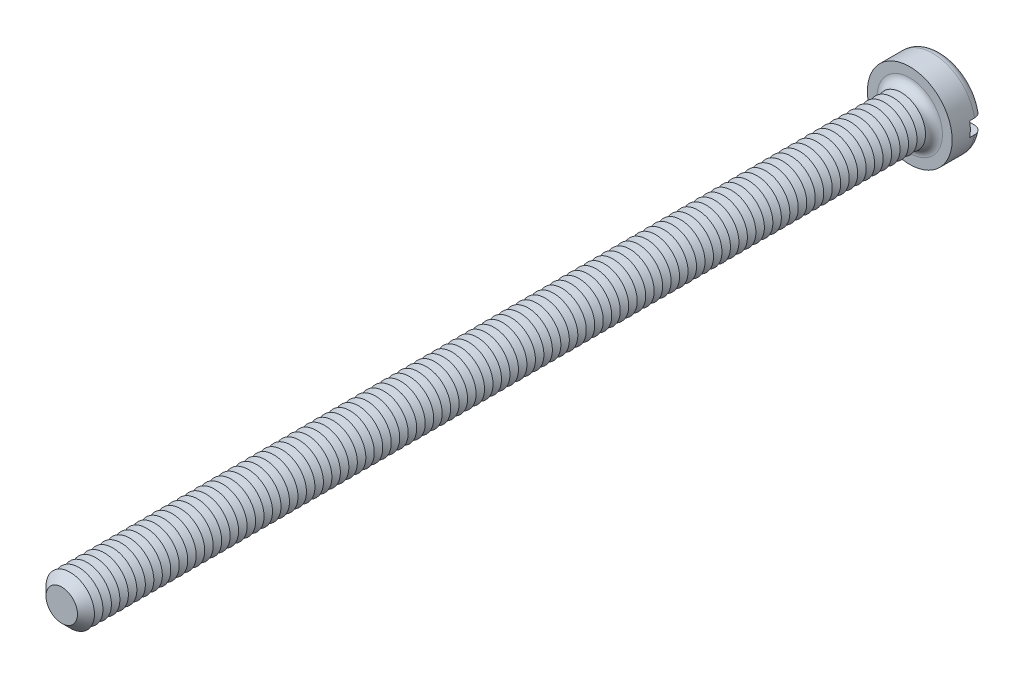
ISO-10303-21;
HEADER;
FILE_DESCRIPTION(('STEP AP214'),'2;1');
FILE_NAME('part.step','',(''),(''),'','','');
FILE_SCHEMA(('AUTOMOTIVE_DESIGN { 1 0 10303 214 1 1 1 1 }'));
ENDSEC;
DATA;
#1=APPLICATION_CONTEXT('core data for automotive mechanical design processes');
#2=APPLICATION_PROTOCOL_DEFINITION('international standard','automotive_design',2000,#1);
#3=PRODUCT_CONTEXT('',#1,'mechanical');
#4=PRODUCT('Part','Part','',(#3));
#5=PRODUCT_RELATED_PRODUCT_CATEGORY('part','',(#4));
#6=PRODUCT_DEFINITION_FORMATION('','',#4);
#7=PRODUCT_DEFINITION_CONTEXT('part definition',#1,'design');
#8=PRODUCT_DEFINITION('design','',#6,#7);
#9=PRODUCT_DEFINITION_SHAPE('','',#8);
#10=(LENGTH_UNIT() NAMED_UNIT(*) SI_UNIT(.MILLI.,.METRE.));
#11=(NAMED_UNIT(*) PLANE_ANGLE_UNIT() SI_UNIT($,.RADIAN.));
#12=(NAMED_UNIT(*) SI_UNIT($,.STERADIAN.) SOLID_ANGLE_UNIT());
#13=UNCERTAINTY_MEASURE_WITH_UNIT(LENGTH_MEASURE(1.E-05),#10,'distance_accuracy_value','');
#14=(GEOMETRIC_REPRESENTATION_CONTEXT(3) GLOBAL_UNCERTAINTY_ASSIGNED_CONTEXT((#13)) GLOBAL_UNIT_ASSIGNED_CONTEXT((#10,
#11,#12)) REPRESENTATION_CONTEXT('',''));
#15=CARTESIAN_POINT('',(0.,0.,0.));
#16=DIRECTION('',(0.,0.,1.));
#17=DIRECTION('',(1.,0.,0.));
#18=AXIS2_PLACEMENT_3D('',#15,#16,#17);
#19=CARTESIAN_POINT('',(0.,0.,-2.6));
#20=DIRECTION('',(0.,0.,1.));
#21=DIRECTION('',(1.,0.,0.));
#22=AXIS2_PLACEMENT_3D('',#19,#20,#21);
#23=PLANE('',#22);
#24=CARTESIAN_POINT('',(0.,0.,-2.6));
#25=DIRECTION('',(0.,0.,1.));
#26=DIRECTION('',(1.,0.,0.));
#27=AXIS2_PLACEMENT_3D('',#24,#25,#26);
#28=CIRCLE('',#27,2.8);
#29=CARTESIAN_POINT('',(-2.73495886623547,0.6,-2.6));
#30=VERTEX_POINT('',#29);
#31=CARTESIAN_POINT('',(2.73495886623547,0.6,-2.6));
#32=VERTEX_POINT('',#31);
#33=EDGE_CURVE('E116',#30,#32,#28,.F.);
#34=ORIENTED_EDGE('',*,*,#33,.T.);
#35=DIRECTION('',(1.,0.,0.));
#36=VECTOR('',#35,1.);
#37=CARTESIAN_POINT('',(-3.5,0.600000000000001,-2.6));
#38=LINE('',#37,#36);
#39=EDGE_CURVE('E111',#30,#32,#38,.T.);
#40=ORIENTED_EDGE('',*,*,#39,.F.);
#41=EDGE_LOOP('',(#34,#40));
#42=FACE_BOUND('',#41,.T.);
#43=ADVANCED_FACE('F39',(#42),#23,.F.);
#44=CARTESIAN_POINT('',(0.,0.,-1.9));
#45=DIRECTION('',(0.,0.,1.));
#46=DIRECTION('',(1.,0.,0.));
#47=AXIS2_PLACEMENT_3D('',#44,#45,#46);
#48=TOROIDAL_SURFACE('',#47,2.8,0.7);
#49=CARTESIAN_POINT('',(-3.24550494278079,0.600000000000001,-2.38938679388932));
#50=CARTESIAN_POINT('',(-3.21724139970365,0.600000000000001,-2.41780774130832));
#51=CARTESIAN_POINT('',(-3.18652103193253,0.600000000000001,-2.44383169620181));
#52=CARTESIAN_POINT('',(-3.12110229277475,0.600000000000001,-2.49034599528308));
#53=CARTESIAN_POINT('',(-3.08639834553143,0.6,-2.51082844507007));
#54=CARTESIAN_POINT('',(-3.01410013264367,0.6,-2.54568075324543));
#55=CARTESIAN_POINT('',(-2.97650963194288,0.6,-2.56005841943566));
#56=CARTESIAN_POINT('',(-2.89948250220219,0.6,-2.58239238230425));
#57=CARTESIAN_POINT('',(-2.86004633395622,0.6,-2.59035027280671));
#58=CARTESIAN_POINT('',(-2.77983715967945,0.6,-2.5997577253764));
#59=CARTESIAN_POINT('',(-2.73905311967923,0.6,-2.60111317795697));
#60=CARTESIAN_POINT('',(-2.65781876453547,0.6,-2.59706866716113));
#61=CARTESIAN_POINT('',(-2.61736849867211,0.6,-2.59166772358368));
#62=CARTESIAN_POINT('',(-2.53729983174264,0.6,-2.57414594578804));
#63=CARTESIAN_POINT('',(-2.49770360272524,0.6,-2.56192363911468));
#64=CARTESIAN_POINT('',(-2.421111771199,0.6,-2.5310238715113));
#65=CARTESIAN_POINT('',(-2.38411632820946,0.6,-2.51234601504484));
#66=CARTESIAN_POINT('',(-2.31371213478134,0.6,-2.46896762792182));
#67=CARTESIAN_POINT('',(-2.28031240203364,0.6,-2.44425244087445));
#68=CARTESIAN_POINT('',(-2.21823311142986,0.6,-2.38946667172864));
#69=CARTESIAN_POINT('',(-2.18955321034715,0.6,-2.35939647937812));
#70=CARTESIAN_POINT('',(-2.13836074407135,0.6,-2.29532787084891));
#71=CARTESIAN_POINT('',(-2.11574147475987,0.6,-2.26141482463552));
#72=CARTESIAN_POINT('',(-2.07677080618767,0.6,-2.19015935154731));
#73=CARTESIAN_POINT('',(-2.06041784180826,0.6,-2.15281778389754));
#74=CARTESIAN_POINT('',(-2.03508596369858,0.6,-2.07723332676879));
#75=CARTESIAN_POINT('',(-2.02585871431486,0.6,-2.03907365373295));
#76=CARTESIAN_POINT('',(-2.01416722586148,0.6,-1.96173417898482));
#77=CARTESIAN_POINT('',(-2.01170151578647,0.6,-1.92255460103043));
#78=CARTESIAN_POINT('',(-2.01359934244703,0.6,-1.84555709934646));
#79=CARTESIAN_POINT('',(-2.01775787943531,0.6,-1.80773393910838));
#80=CARTESIAN_POINT('',(-2.03236373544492,0.6,-1.73332511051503));
#81=CARTESIAN_POINT('',(-2.04281097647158,0.6,-1.69673942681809));
#82=CARTESIAN_POINT('',(-2.06962963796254,0.6,-1.62577336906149));
#83=CARTESIAN_POINT('',(-2.08600685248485,0.6,-1.59139519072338));
#84=CARTESIAN_POINT('',(-2.12413495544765,0.6,-1.52576356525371));
#85=CARTESIAN_POINT('',(-2.14588657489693,0.6,-1.49451054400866));
#86=CARTESIAN_POINT('',(-2.19483541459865,0.6,-1.43498643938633));
#87=CARTESIAN_POINT('',(-2.22217844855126,0.6,-1.40683532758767));
#88=CARTESIAN_POINT('',(-2.28105616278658,0.6,-1.35532544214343));
#89=CARTESIAN_POINT('',(-2.3125916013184,0.6,-1.33196753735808));
#90=CARTESIAN_POINT('',(-2.38018779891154,0.6,-1.28984356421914));
#91=CARTESIAN_POINT('',(-2.41637068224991,0.6,-1.27127330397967));
#92=CARTESIAN_POINT('',(-2.49129688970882,0.6,-1.24032971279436));
#93=CARTESIAN_POINT('',(-2.53004053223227,0.6,-1.22795715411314));
#94=CARTESIAN_POINT('',(-2.6098393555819,0.6,-1.2095515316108));
#95=CARTESIAN_POINT('',(-2.65092550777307,0.6,-1.20365237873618));
#96=CARTESIAN_POINT('',(-2.7335069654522,0.6,-1.1988380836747));
#97=CARTESIAN_POINT('',(-2.7750022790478,0.6,-1.19992308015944));
#98=CARTESIAN_POINT('',(-2.85718851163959,0.6,-1.20909046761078));
#99=CARTESIAN_POINT('',(-2.8978799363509,0.6,-1.21716830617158));
#100=CARTESIAN_POINT('',(-2.97729176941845,0.6,-1.24014327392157));
#101=CARTESIAN_POINT('',(-3.01601231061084,0.6,-1.25503994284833));
#102=CARTESIAN_POINT('',(-3.08976822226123,0.6,-1.29101066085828));
#103=CARTESIAN_POINT('',(-3.12484927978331,0.600000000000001,-1.31199098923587));
#104=CARTESIAN_POINT('',(-3.19090022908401,0.600000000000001,-1.35965144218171));
#105=CARTESIAN_POINT('',(-3.22187053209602,0.600000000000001,-1.38633099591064));
#106=CARTESIAN_POINT('',(-3.2781946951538,0.600000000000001,-1.44408564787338));
#107=CARTESIAN_POINT('',(-3.3036441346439,0.600000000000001,-1.47506754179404));
#108=CARTESIAN_POINT('',(-3.34887649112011,0.600000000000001,-1.54092398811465));
#109=CARTESIAN_POINT('',(-3.36865993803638,0.600000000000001,-1.57579817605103));
#110=CARTESIAN_POINT('',(-3.40166738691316,0.600000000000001,-1.64783067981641));
#111=CARTESIAN_POINT('',(-3.41499360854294,0.600000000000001,-1.68494217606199));
#112=CARTESIAN_POINT('',(-3.43515375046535,0.600000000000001,-1.76088675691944));
#113=CARTESIAN_POINT('',(-3.44198836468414,0.600000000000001,-1.79971965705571));
#114=CARTESIAN_POINT('',(-3.44891916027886,0.600000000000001,-1.87757893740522));
#115=CARTESIAN_POINT('',(-3.44908375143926,0.600000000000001,-1.91659924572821));
#116=CARTESIAN_POINT('',(-3.44284111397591,0.600000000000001,-1.99412088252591));
#117=CARTESIAN_POINT('',(-3.43643236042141,0.600000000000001,-2.03262208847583));
#118=CARTESIAN_POINT('',(-3.41725803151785,0.600000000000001,-2.10792315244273));
#119=CARTESIAN_POINT('',(-3.40450469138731,0.600000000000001,-2.14472613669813));
#120=CARTESIAN_POINT('',(-3.3730385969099,0.600000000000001,-2.21565060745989));
#121=CARTESIAN_POINT('',(-3.35433321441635,0.600000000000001,-2.24977534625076));
#122=CARTESIAN_POINT('',(-3.3201892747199,0.600000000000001,-2.30136364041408));
#123=CARTESIAN_POINT('',(-3.30647805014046,0.600000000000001,-2.31999402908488));
#124=CARTESIAN_POINT('',(-3.27728518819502,0.600000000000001,-2.35581090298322));
#125=CARTESIAN_POINT('',(-3.26180356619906,0.600000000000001,-2.37299740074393));
#126=CARTESIAN_POINT('',(-3.24550494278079,0.600000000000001,-2.38938679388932));
#127=B_SPLINE_CURVE_WITH_KNOTS('',3,(#49,#50,#51,#52,#53,#54,#55,#56,#57,#58,#59,#60,#61,#62,
#63,#64,#65,#66,#67,#68,#69,#70,#71,#72,#73,#74,#75,#76,#77,#78,#79,#80,#81,#82,#83,#84,#85,#86,
#87,#88,#89,#90,#91,#92,#93,#94,#95,#96,#97,#98,#99,#100,#101,#102,#103,#104,#105,#106,#107,
#108,#109,#110,#111,#112,#113,#114,#115,#116,#117,#118,#119,#120,#121,#122,#123,#124,#125,#126),
.UNSPECIFIED.,.T.,.F.,(4,2,2,2,2,2,2,2,2,2,2,2,2,2,2,2,2,2,2,2,2,2,2,2,2,2,2,2,2,2,2,2,2,2,2,2,
2,2,4),(0.,0.120160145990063,0.240490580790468,0.36066665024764,0.480812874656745,
0.602666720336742,0.724538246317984,0.848272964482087,0.972015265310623,1.09606100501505,
1.2200977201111,1.34178071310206,1.46343329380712,1.58062647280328,1.6977941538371,
1.81140573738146,1.92501591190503,2.03873739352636,2.15247435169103,2.26967910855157,
2.38690509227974,2.50835551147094,2.62982106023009,2.75375450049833,2.87769040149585,
3.00154567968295,3.12539259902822,3.24742469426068,3.36944457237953,3.48914477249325,
3.60883377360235,3.72656056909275,3.84427477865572,3.96078136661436,4.07731498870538,
4.19362474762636,4.3097910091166,4.37908387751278,4.44837614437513),.UNSPECIFIED.);
#128=CARTESIAN_POINT('',(-3.44818792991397,0.600000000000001,-1.8999999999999));
#129=VERTEX_POINT('',#128);
#130=EDGE_CURVE('E962',#129,#30,#127,.T.);
#131=ORIENTED_EDGE('',*,*,#130,.F.);
#132=CARTESIAN_POINT('',(0.,0.,-1.9));
#133=DIRECTION('',(0.,0.,1.));
#134=DIRECTION('',(1.,0.,0.));
#135=AXIS2_PLACEMENT_3D('',#132,#133,#134);
#136=CIRCLE('',#135,3.5);
#137=CARTESIAN_POINT('',(3.44818792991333,0.6,-1.9));
#138=VERTEX_POINT('',#137);
#139=EDGE_CURVE('E124',#138,#129,#136,.T.);
#140=ORIENTED_EDGE('',*,*,#139,.F.);
#141=CARTESIAN_POINT('',(2.1414268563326,0.6,-2.29762171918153));
#142=CARTESIAN_POINT('',(2.16505443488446,0.6,-2.33058245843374));
#143=CARTESIAN_POINT('',(2.19155609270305,0.6,-2.36152717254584));
#144=CARTESIAN_POINT('',(2.24942944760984,0.6,-2.41852964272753));
#145=CARTESIAN_POINT('',(2.28080921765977,0.6,-2.44457913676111));
#146=CARTESIAN_POINT('',(2.34741203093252,0.6,-2.49105381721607));
#147=CARTESIAN_POINT('',(2.38262862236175,0.6,-2.51148824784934));
#148=CARTESIAN_POINT('',(2.45593176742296,0.6,-2.54626881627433));
#149=CARTESIAN_POINT('',(2.49401741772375,0.6,-2.56061686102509));
#150=CARTESIAN_POINT('',(2.57272605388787,0.6,-2.58306429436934));
#151=CARTESIAN_POINT('',(2.6133821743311,0.6,-2.59104769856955));
#152=CARTESIAN_POINT('',(2.6954618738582,0.6,-2.60009608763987));
#153=CARTESIAN_POINT('',(2.73688552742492,0.6,-2.60116039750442));
#154=CARTESIAN_POINT('',(2.81941950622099,0.6,-2.5962925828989));
#155=CARTESIAN_POINT('',(2.86052888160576,0.6,-2.59034422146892));
#156=CARTESIAN_POINT('',(2.94113709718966,0.6,-2.57153687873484));
#157=CARTESIAN_POINT('',(2.98063603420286,0.6,-2.55867831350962));
#158=CARTESIAN_POINT('',(3.05633735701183,0.6,-2.52657771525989));
#159=CARTESIAN_POINT('',(3.09257627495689,0.6,-2.50742188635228));
#160=CARTESIAN_POINT('',(3.16123898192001,0.6,-2.46318606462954));
#161=CARTESIAN_POINT('',(3.19366316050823,0.6,-2.4381066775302));
#162=CARTESIAN_POINT('',(3.25312278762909,0.6,-2.38324481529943));
#163=CARTESIAN_POINT('',(3.28024842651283,0.6,-2.35356008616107));
#164=CARTESIAN_POINT('',(3.32902587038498,0.6,-2.28998971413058));
#165=CARTESIAN_POINT('',(3.35067820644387,0.6,-2.25610447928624));
#166=CARTESIAN_POINT('',(3.38751207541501,0.6,-2.18572286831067));
#167=CARTESIAN_POINT('',(3.40279804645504,0.6,-2.14928112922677));
#168=CARTESIAN_POINT('',(3.42695590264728,0.6,-2.07433042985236));
#169=CARTESIAN_POINT('',(3.43582824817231,0.6,-2.03582161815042));
#170=CARTESIAN_POINT('',(3.44682113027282,0.6,-1.95829536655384));
#171=CARTESIAN_POINT('',(3.44901648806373,0.6,-1.91928851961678));
#172=CARTESIAN_POINT('',(3.44680085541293,0.6,-1.84146366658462));
#173=CARTESIAN_POINT('',(3.44239008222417,0.6,-1.80264565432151));
#174=CARTESIAN_POINT('',(3.42712544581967,0.6,-1.72644634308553));
#175=CARTESIAN_POINT('',(3.41629508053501,0.6,-1.6890603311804));
#176=CARTESIAN_POINT('',(3.38853757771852,0.6,-1.61662604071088));
#177=CARTESIAN_POINT('',(3.37161039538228,0.6,-1.58157777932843));
#178=CARTESIAN_POINT('',(3.33207798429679,0.6,-1.51464178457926));
#179=CARTESIAN_POINT('',(3.30944854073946,0.6,-1.48276835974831));
#180=CARTESIAN_POINT('',(3.2592165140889,0.6,-1.42321861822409));
#181=CARTESIAN_POINT('',(3.23161370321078,0.6,-1.3955424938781));
#182=CARTESIAN_POINT('',(3.17188519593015,0.6,-1.34481834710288));
#183=CARTESIAN_POINT('',(3.13971065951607,0.6,-1.32182785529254));
#184=CARTESIAN_POINT('',(3.07201123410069,0.6,-1.28147003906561));
#185=CARTESIAN_POINT('',(3.03648608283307,0.6,-1.26410315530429));
#186=CARTESIAN_POINT('',(2.962449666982,0.6,-1.2351645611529));
#187=CARTESIAN_POINT('',(2.92389781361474,0.6,-1.22369671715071));
#188=CARTESIAN_POINT('',(2.84543273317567,0.6,-1.20726565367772));
#189=CARTESIAN_POINT('',(2.80551936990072,0.6,-1.20230308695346));
#190=CARTESIAN_POINT('',(2.72467191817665,0.6,-1.1989357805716));
#191=CARTESIAN_POINT('',(2.68373266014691,0.6,-1.20065484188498));
#192=CARTESIAN_POINT('',(2.60270222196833,0.6,-1.21084560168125));
#193=CARTESIAN_POINT('',(2.56261112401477,0.6,-1.21931795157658));
#194=CARTESIAN_POINT('',(2.48385954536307,0.6,-1.24292934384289));
#195=CARTESIAN_POINT('',(2.44522508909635,0.6,-1.25815531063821));
#196=CARTESIAN_POINT('',(2.37106165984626,0.6,-1.29488663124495));
#197=CARTESIAN_POINT('',(2.33553282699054,0.6,-1.31639226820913));
#198=CARTESIAN_POINT('',(2.2686996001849,0.6,-1.36507949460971));
#199=CARTESIAN_POINT('',(2.23738745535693,0.6,-1.39225042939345));
#200=CARTESIAN_POINT('',(2.17990424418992,0.6,-1.45157941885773));
#201=CARTESIAN_POINT('',(2.15373259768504,0.6,-1.48373691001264));
#202=CARTESIAN_POINT('',(2.10799355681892,0.6,-1.551327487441));
#203=CARTESIAN_POINT('',(2.08828258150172,0.6,-1.58666329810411));
#204=CARTESIAN_POINT('',(2.05534440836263,0.6,-1.66023600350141));
#205=CARTESIAN_POINT('',(2.042115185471,0.6,-1.6984719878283));
#206=CARTESIAN_POINT('',(2.02303126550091,0.6,-1.77519783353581));
#207=CARTESIAN_POINT('',(2.01691541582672,0.6,-1.8136228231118));
#208=CARTESIAN_POINT('',(2.01140375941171,0.6,-1.89096056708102));
#209=CARTESIAN_POINT('',(2.01200856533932,0.6,-1.92987336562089));
#210=CARTESIAN_POINT('',(2.01981617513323,0.6,-2.006065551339));
#211=CARTESIAN_POINT('',(2.02685835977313,0.6,-2.04336165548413));
#212=CARTESIAN_POINT('',(2.0470502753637,0.6,-2.1162250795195));
#213=CARTESIAN_POINT('',(2.06019252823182,0.6,-2.15179445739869));
#214=CARTESIAN_POINT('',(2.08525738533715,0.6,-2.20558874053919));
#215=CARTESIAN_POINT('',(2.09529161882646,0.6,-2.22471751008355));
#216=CARTESIAN_POINT('',(2.11708813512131,0.6,-2.26196179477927));
#217=CARTESIAN_POINT('',(2.12885034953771,0.6,-2.28007734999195));
#218=CARTESIAN_POINT('',(2.1414268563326,0.6,-2.29762171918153));
#219=B_SPLINE_CURVE_WITH_KNOTS('',3,(#141,#142,#143,#144,#145,#146,#147,#148,#149,#150,#151,
#152,#153,#154,#155,#156,#157,#158,#159,#160,#161,#162,#163,#164,#165,#166,#167,#168,#169,#170,
#171,#172,#173,#174,#175,#176,#177,#178,#179,#180,#181,#182,#183,#184,#185,#186,#187,#188,#189,
#190,#191,#192,#193,#194,#195,#196,#197,#198,#199,#200,#201,#202,#203,#204,#205,#206,#207,#208,
#209,#210,#211,#212,#213,#214,#215,#216,#217,#218),.UNSPECIFIED.,.T.,.F.,(4,2,2,2,2,2,2,2,2,2,2,
2,2,2,2,2,2,2,2,2,2,2,2,2,2,2,2,2,2,2,2,2,2,2,2,2,2,2,4),(0.,0.121582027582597,
0.243367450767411,0.364951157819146,0.486496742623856,0.610209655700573,0.733934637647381,
0.857946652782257,0.981951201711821,1.1043243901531,1.22668507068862,1.34673532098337,
1.46677391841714,1.58475736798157,1.70273234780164,1.81938035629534,1.93602452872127,
2.05224435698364,2.168465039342,2.28518782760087,2.40191596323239,2.52000081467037,
2.63809491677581,2.75820270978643,2.87832255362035,3.00067856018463,3.1230463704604,
3.24703703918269,3.37103329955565,3.49479843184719,3.6185495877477,3.73932715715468,
3.86006696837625,3.9762182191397,4.09238005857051,4.2057203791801,4.31892212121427,
4.38364046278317,4.44835624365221),.UNSPECIFIED.);
#220=EDGE_CURVE('E964',#32,#138,#219,.T.);
#221=ORIENTED_EDGE('',*,*,#220,.F.);
#222=ORIENTED_EDGE('',*,*,#33,.F.);
#223=EDGE_LOOP('',(#131,#140,#221,#222));
#224=FACE_BOUND('',#223,.T.);
#225=ADVANCED_FACE('F946',(#224),#48,.T.);
#226=CARTESIAN_POINT('',(0.,0.,-2.6));
#227=DIRECTION('',(0.,0.,1.));
#228=DIRECTION('',(1.,0.,0.));
#229=AXIS2_PLACEMENT_3D('',#226,#227,#228);
#230=CYLINDRICAL_SURFACE('',#229,3.5);
#231=DIRECTION('',(0.,0.,1.));
#232=VECTOR('',#231,1.);
#233=CARTESIAN_POINT('',(3.44818792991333,0.6,-2.6));
#234=LINE('',#233,#232);
#235=CARTESIAN_POINT('',(3.44818792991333,0.6,-1.5));
#236=VERTEX_POINT('',#235);
#237=EDGE_CURVE('E978',#138,#236,#234,.T.);
#238=ORIENTED_EDGE('',*,*,#237,.F.);
#239=ORIENTED_EDGE('',*,*,#139,.T.);
#240=DIRECTION('',(0.,0.,1.));
#241=VECTOR('',#240,1.);
#242=CARTESIAN_POINT('',(-3.44818792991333,0.600000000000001,-2.6));
#243=LINE('',#242,#241);
#244=CARTESIAN_POINT('',(-3.44818792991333,0.600000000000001,-1.5));
#245=VERTEX_POINT('',#244);
#246=EDGE_CURVE('E63',#245,#129,#243,.F.);
#247=ORIENTED_EDGE('',*,*,#246,.F.);
#248=CARTESIAN_POINT('',(0.,0.,-1.5));
#249=DIRECTION('',(0.,0.,-1.));
#250=DIRECTION('',(-1.,0.,0.));
#251=AXIS2_PLACEMENT_3D('',#248,#249,#250);
#252=CIRCLE('',#251,3.5);
#253=CARTESIAN_POINT('',(-3.44818792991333,-0.599999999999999,-1.5));
#254=VERTEX_POINT('',#253);
#255=EDGE_CURVE('E43',#245,#254,#252,.F.);
#256=ORIENTED_EDGE('',*,*,#255,.T.);
#257=DIRECTION('',(0.,0.,1.));
#258=VECTOR('',#257,1.);
#259=CARTESIAN_POINT('',(-3.44818792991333,-0.599999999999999,-2.6));
#260=LINE('',#259,#258);
#261=CARTESIAN_POINT('',(-3.44818792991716,-0.599999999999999,-1.90000000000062));
#262=VERTEX_POINT('',#261);
#263=EDGE_CURVE('E975',#262,#254,#260,.T.);
#264=ORIENTED_EDGE('',*,*,#263,.F.);
#265=CARTESIAN_POINT('',(3.44818792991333,-0.6,-1.9));
#266=VERTEX_POINT('',#265);
#267=EDGE_CURVE('E126',#262,#266,#136,.T.);
#268=ORIENTED_EDGE('',*,*,#267,.T.);
#269=DIRECTION('',(0.,0.,1.));
#270=VECTOR('',#269,1.);
#271=CARTESIAN_POINT('',(3.44818792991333,-0.6,-2.6));
#272=LINE('',#271,#270);
#273=CARTESIAN_POINT('',(3.44818792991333,-0.6,-1.5));
#274=VERTEX_POINT('',#273);
#275=EDGE_CURVE('E55',#274,#266,#272,.F.);
#276=ORIENTED_EDGE('',*,*,#275,.F.);
#277=EDGE_CURVE('E11',#274,#236,#252,.F.);
#278=ORIENTED_EDGE('',*,*,#277,.T.);
#279=EDGE_LOOP('',(#238,#239,#247,#256,#264,#268,#276,#278));
#280=FACE_BOUND('',#279,.T.);
#281=CARTESIAN_POINT('',(0.,0.,0.));
#282=DIRECTION('',(0.,0.,1.));
#283=DIRECTION('',(1.,0.,0.));
#284=AXIS2_PLACEMENT_3D('',#281,#282,#283);
#285=CIRCLE('',#284,3.5);
#286=CARTESIAN_POINT('',(3.5,0.,0.));
#287=VERTEX_POINT('',#286);
#288=EDGE_CURVE('E981',#287,#287,#285,.T.);
#289=ORIENTED_EDGE('',*,*,#288,.F.);
#290=EDGE_LOOP('',(#289));
#291=FACE_BOUND('',#290,.T.);
#292=ADVANCED_FACE('F942',(#280,#291),#230,.T.);
#293=CARTESIAN_POINT('',(2.73495886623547,-0.6,-2.6));
#294=VERTEX_POINT('',#293);
#295=CARTESIAN_POINT('',(-2.73495886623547,-0.6,-2.6));
#296=VERTEX_POINT('',#295);
#297=EDGE_CURVE('E109',#294,#296,#28,.F.);
#298=ORIENTED_EDGE('',*,*,#297,.T.);
#299=DIRECTION('',(-1.,0.,0.));
#300=VECTOR('',#299,1.);
#301=CARTESIAN_POINT('',(-3.5,-0.599999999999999,-2.6));
#302=LINE('',#301,#300);
#303=EDGE_CURVE('E96',#294,#296,#302,.T.);
#304=ORIENTED_EDGE('',*,*,#303,.F.);
#305=EDGE_LOOP('',(#298,#304));
#306=FACE_BOUND('',#305,.T.);
#307=ADVANCED_FACE('F108',(#306),#23,.F.);
#308=CARTESIAN_POINT('',(0.,0.,0.));
#309=DIRECTION('',(0.,0.,1.));
#310=DIRECTION('',(1.,0.,0.));
#311=AXIS2_PLACEMENT_3D('',#308,#309,#310);
#312=PLANE('',#311);
#313=CARTESIAN_POINT('',(0.,0.,0.));
#314=DIRECTION('',(0.,0.,1.));
#315=DIRECTION('',(1.,0.,0.));
#316=AXIS2_PLACEMENT_3D('',#313,#314,#315);
#317=CIRCLE('',#316,2.7);
#318=CARTESIAN_POINT('',(2.7,0.,0.));
#319=VERTEX_POINT('',#318);
#320=EDGE_CURVE('E115',#319,#319,#317,.F.);
#321=ORIENTED_EDGE('',*,*,#320,.T.);
#322=EDGE_LOOP('',(#321));
#323=FACE_BOUND('',#322,.T.);
#324=ORIENTED_EDGE('',*,*,#288,.T.);
#325=EDGE_LOOP('',(#324));
#326=FACE_BOUND('',#325,.T.);
#327=ADVANCED_FACE('F941',(#323,#326),#312,.T.);
#328=CARTESIAN_POINT('',(-3.24550494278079,-0.599999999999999,-2.38938679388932));
#329=CARTESIAN_POINT('',(-3.27309693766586,-0.599999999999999,-2.36163611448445));
#330=CARTESIAN_POINT('',(-3.29838741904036,-0.599999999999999,-2.3315608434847));
#331=CARTESIAN_POINT('',(-3.34359429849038,-0.599999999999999,-2.26757659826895));
#332=CARTESIAN_POINT('',(-3.36350518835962,-0.599999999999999,-2.23366374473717));
#333=CARTESIAN_POINT('',(-3.39733065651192,-0.599999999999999,-2.16296274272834));
#334=CARTESIAN_POINT('',(-3.4112451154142,-0.599999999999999,-2.12617453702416));
#335=CARTESIAN_POINT('',(-3.43264462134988,-0.599999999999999,-2.05078178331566));
#336=CARTESIAN_POINT('',(-3.44013114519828,-0.599999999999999,-2.01217765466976));
#337=CARTESIAN_POINT('',(-3.44841975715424,-0.599999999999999,-1.9345391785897));
#338=CARTESIAN_POINT('',(-3.44926944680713,-0.599999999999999,-1.89550990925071));
#339=CARTESIAN_POINT('',(-3.44438358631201,-0.599999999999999,-1.81786552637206));
#340=CARTESIAN_POINT('',(-3.43864801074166,-0.599999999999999,-1.77925041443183));
#341=CARTESIAN_POINT('',(-3.42079221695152,-0.599999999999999,-1.70364264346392));
#342=CARTESIAN_POINT('',(-3.40869011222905,-0.599999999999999,-1.66664570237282));
#343=CARTESIAN_POINT('',(-3.37847692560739,-0.599999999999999,-1.59519424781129));
#344=CARTESIAN_POINT('',(-3.3603657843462,-0.599999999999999,-1.56073975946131));
#345=CARTESIAN_POINT('',(-3.31856549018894,-0.599999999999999,-1.4951524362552));
#346=CARTESIAN_POINT('',(-3.29484830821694,-0.599999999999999,-1.46403747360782));
#347=CARTESIAN_POINT('',(-3.24258489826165,-0.599999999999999,-1.40617131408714));
#348=CARTESIAN_POINT('',(-3.21403843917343,-0.599999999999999,-1.37942032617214));
#349=CARTESIAN_POINT('',(-3.15256084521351,-0.599999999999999,-1.33067963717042));
#350=CARTESIAN_POINT('',(-3.11958015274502,-0.599999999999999,-1.30875246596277));
#351=CARTESIAN_POINT('',(-3.0504559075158,-0.599999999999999,-1.27063718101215));
#352=CARTESIAN_POINT('',(-3.01431209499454,-0.6,-1.25444953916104));
#353=CARTESIAN_POINT('',(-2.93921710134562,-0.6,-1.22796796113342));
#354=CARTESIAN_POINT('',(-2.90022796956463,-0.6,-1.217781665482));
#355=CARTESIAN_POINT('',(-2.82110512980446,-0.6,-1.20396915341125));
#356=CARTESIAN_POINT('',(-2.7809713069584,-0.6,-1.2003435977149));
#357=CARTESIAN_POINT('',(-2.69990924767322,-0.6,-1.19969717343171));
#358=CARTESIAN_POINT('',(-2.65898001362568,-0.6,-1.20279937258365));
#359=CARTESIAN_POINT('',(-2.57819986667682,-0.6,-1.21574287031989));
#360=CARTESIAN_POINT('',(-2.53834905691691,-0.6,-1.22558481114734));
#361=CARTESIAN_POINT('',(-2.46035232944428,-0.6,-1.25189361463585));
#362=CARTESIAN_POINT('',(-2.42223314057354,-0.6,-1.2684398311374));
#363=CARTESIAN_POINT('',(-2.34932316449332,-0.6,-1.30771928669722));
#364=CARTESIAN_POINT('',(-2.31453248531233,-0.6,-1.33045272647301));
#365=CARTESIAN_POINT('',(-2.24945577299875,-0.6,-1.38141543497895));
#366=CARTESIAN_POINT('',(-2.21915255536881,-0.6,-1.40962272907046));
#367=CARTESIAN_POINT('',(-2.16386461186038,-0.6,-1.47084552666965));
#368=CARTESIAN_POINT('',(-2.13887916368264,-0.6,-1.50386037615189));
#369=CARTESIAN_POINT('',(-2.09568071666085,-0.6,-1.57285917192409));
#370=CARTESIAN_POINT('',(-2.07730739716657,-0.6,-1.60874263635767));
#371=CARTESIAN_POINT('',(-2.04712019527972,-0.6,-1.68316975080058));
#372=CARTESIAN_POINT('',(-2.03530452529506,-0.6,-1.72171267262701));
#373=CARTESIAN_POINT('',(-2.01901751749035,-0.6,-1.79878952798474));
#374=CARTESIAN_POINT('',(-2.01428434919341,-0.6,-1.8372682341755));
#375=CARTESIAN_POINT('',(-2.01150652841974,-0.6,-1.91446369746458));
#376=CARTESIAN_POINT('',(-2.01346084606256,-0.6,-1.95318041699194));
#377=CARTESIAN_POINT('',(-2.02386268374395,-0.6,-2.0288619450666));
#378=CARTESIAN_POINT('',(-2.03216724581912,-0.6,-2.06584654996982));
#379=CARTESIAN_POINT('',(-2.05479337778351,-0.6,-2.13792373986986));
#380=CARTESIAN_POINT('',(-2.06911522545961,-0.6,-2.1730162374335));
#381=CARTESIAN_POINT('',(-2.10349906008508,-0.6,-2.24081034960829));
#382=CARTESIAN_POINT('',(-2.12363007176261,-0.6,-2.27347689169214));
#383=CARTESIAN_POINT('',(-2.16891308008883,-0.6,-2.33511902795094));
#384=CARTESIAN_POINT('',(-2.19406590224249,-0.6,-2.36409401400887));
#385=CARTESIAN_POINT('',(-2.24962389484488,-0.6,-2.41861972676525));
#386=CARTESIAN_POINT('',(-2.28018314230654,-0.6,-2.44401345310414));
#387=CARTESIAN_POINT('',(-2.34501720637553,-0.6,-2.48950558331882));
#388=CARTESIAN_POINT('',(-2.37929266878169,-0.6,-2.50960306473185));
#389=CARTESIAN_POINT('',(-2.45179417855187,-0.6,-2.54458276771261));
#390=CARTESIAN_POINT('',(-2.49011248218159,-0.6,-2.55927401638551));
#391=CARTESIAN_POINT('',(-2.56865227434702,-0.6,-2.58211133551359));
#392=CARTESIAN_POINT('',(-2.60887386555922,-0.6,-2.59025705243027));
#393=CARTESIAN_POINT('',(-2.69064746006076,-0.6,-2.59982905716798));
#394=CARTESIAN_POINT('',(-2.73220999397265,-0.6,-2.60116580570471));
#395=CARTESIAN_POINT('',(-2.81497658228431,-0.6,-2.59679700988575));
#396=CARTESIAN_POINT('',(-2.85618055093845,-0.6,-2.59108982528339));
#397=CARTESIAN_POINT('',(-2.93677683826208,-0.6,-2.57279487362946));
#398=CARTESIAN_POINT('',(-2.97617834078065,-0.6,-2.56024753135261));
#399=CARTESIAN_POINT('',(-3.05222242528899,-0.6,-2.52860709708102));
#400=CARTESIAN_POINT('',(-3.08886850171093,-0.599999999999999,-2.50952247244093));
#401=CARTESIAN_POINT('',(-3.14562501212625,-0.599999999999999,-2.47340693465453));
#402=CARTESIAN_POINT('',(-3.16689358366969,-0.599999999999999,-2.45816337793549));
#403=CARTESIAN_POINT('',(-3.20761866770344,-0.599999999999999,-2.42542115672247));
#404=CARTESIAN_POINT('',(-3.22707520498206,-0.599999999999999,-2.40792252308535));
#405=CARTESIAN_POINT('',(-3.24550494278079,-0.599999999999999,-2.38938679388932));
#406=B_SPLINE_CURVE_WITH_KNOTS('',3,(#328,#329,#330,#331,#332,#333,#334,#335,#336,#337,#338,
#339,#340,#341,#342,#343,#344,#345,#346,#347,#348,#349,#350,#351,#352,#353,#354,#355,#356,#357,
#358,#359,#360,#361,#362,#363,#364,#365,#366,#367,#368,#369,#370,#371,#372,#373,#374,#375,#376,
#377,#378,#379,#380,#381,#382,#383,#384,#385,#386,#387,#388,#389,#390,#391,#392,#393,#394,#395,
#396,#397,#398,#399,#400,#401,#402,#403,#404,#405),.UNSPECIFIED.,.T.,.F.,(4,2,2,2,2,2,2,2,2,2,2,
2,2,2,2,2,2,2,2,2,2,2,2,2,2,2,2,2,2,2,2,2,2,2,2,2,2,2,4),(0.,0.117306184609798,
0.234732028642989,0.352160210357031,0.469561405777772,0.586119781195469,0.702678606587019,
0.818907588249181,0.935137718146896,1.05196174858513,1.1687913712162,1.2870562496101,
1.40533084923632,1.52566688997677,1.64601504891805,1.76858322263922,1.89116307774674,
2.01523830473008,2.13931755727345,2.26290863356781,2.38648291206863,2.50681878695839,
2.62712184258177,2.74285697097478,2.85857427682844,2.97176054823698,3.08495204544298,
3.19954814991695,3.31416310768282,3.43282436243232,3.55150627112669,3.67404987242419,
3.79660009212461,3.92075778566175,4.04494439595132,4.16840490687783,4.29170610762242,
4.3700604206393,4.44841366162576),.UNSPECIFIED.);
#407=EDGE_CURVE('E103',#296,#262,#406,.T.);
#408=ORIENTED_EDGE('',*,*,#407,.F.);
#409=ORIENTED_EDGE('',*,*,#297,.F.);
#410=CARTESIAN_POINT('',(2.1414268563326,-0.6,-2.29762171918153));
#411=CARTESIAN_POINT('',(2.11900044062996,-0.6,-2.26633119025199));
#412=CARTESIAN_POINT('',(2.09913154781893,-0.6,-2.23318080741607));
#413=CARTESIAN_POINT('',(2.06517900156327,-0.6,-2.16401111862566));
#414=CARTESIAN_POINT('',(2.05109968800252,-0.6,-2.12798968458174));
#415=CARTESIAN_POINT('',(2.02923593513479,-0.6,-2.05404277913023));
#416=CARTESIAN_POINT('',(2.02145692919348,-0.6,-2.01611569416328));
#417=CARTESIAN_POINT('',(2.01251710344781,-0.6,-1.93949649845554));
#418=CARTESIAN_POINT('',(2.01135461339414,-0.6,-1.90080458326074));
#419=CARTESIAN_POINT('',(2.01564803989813,-0.6,-1.82450508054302));
#420=CARTESIAN_POINT('',(2.02098305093,-0.6,-1.78689061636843));
#421=CARTESIAN_POINT('',(2.03786826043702,-0.6,-1.71308589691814));
#422=CARTESIAN_POINT('',(2.04941870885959,-0.6,-1.67689569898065));
#423=CARTESIAN_POINT('',(2.07838664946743,-0.6,-1.60676639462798));
#424=CARTESIAN_POINT('',(2.09582944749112,-0.6,-1.57283776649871));
#425=CARTESIAN_POINT('',(2.1359925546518,-0.6,-1.50826612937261));
#426=CARTESIAN_POINT('',(2.15871360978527,-0.6,-1.47762358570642));
#427=CARTESIAN_POINT('',(2.20955413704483,-0.6,-1.41943384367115));
#428=CARTESIAN_POINT('',(2.23782364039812,-0.6,-1.39201777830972));
#429=CARTESIAN_POINT('',(2.29842612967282,-0.6,-1.34212199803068));
#430=CARTESIAN_POINT('',(2.33075984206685,-0.6,-1.31964316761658));
#431=CARTESIAN_POINT('',(2.399806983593,-0.6,-1.27945238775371));
#432=CARTESIAN_POINT('',(2.43663466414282,-0.6,-1.26193653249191));
#433=CARTESIAN_POINT('',(2.51267241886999,-0.6,-1.23320660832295));
#434=CARTESIAN_POINT('',(2.55188277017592,-0.6,-1.22199327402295));
#435=CARTESIAN_POINT('',(2.63235000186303,-0.6,-1.20602688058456));
#436=CARTESIAN_POINT('',(2.673631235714,-0.6,-1.20139617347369));
#437=CARTESIAN_POINT('',(2.7563863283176,-0.6,-1.19914622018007));
#438=CARTESIAN_POINT('',(2.79786018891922,-0.6,-1.20152704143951));
#439=CARTESIAN_POINT('',(2.87971192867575,-0.6,-1.21326884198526));
#440=CARTESIAN_POINT('',(2.92009214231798,-0.6,-1.22261349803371));
#441=CARTESIAN_POINT('',(2.99866777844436,-0.6,-1.24805614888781));
#442=CARTESIAN_POINT('',(3.03686335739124,-0.6,-1.26415365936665));
#443=CARTESIAN_POINT('',(3.10934738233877,-0.6,-1.3023912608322));
#444=CARTESIAN_POINT('',(3.14368704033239,-0.6,-1.32443423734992));
#445=CARTESIAN_POINT('',(3.20808395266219,-0.6,-1.37407725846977));
#446=CARTESIAN_POINT('',(3.23814164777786,-0.6,-1.40167673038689));
#447=CARTESIAN_POINT('',(3.29251534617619,-0.6,-1.46108303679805));
#448=CARTESIAN_POINT('',(3.3169296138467,-0.6,-1.49279994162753));
#449=CARTESIAN_POINT('',(3.35998418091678,-0.6,-1.55993706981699));
#450=CARTESIAN_POINT('',(3.37862502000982,-0.6,-1.59535694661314));
#451=CARTESIAN_POINT('',(3.40930212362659,-0.6,-1.668283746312));
#452=CARTESIAN_POINT('',(3.42143897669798,-0.6,-1.70574837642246));
#453=CARTESIAN_POINT('',(3.43918305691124,-0.6,-1.78219297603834));
#454=CARTESIAN_POINT('',(3.44479069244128,-0.6,-1.82117285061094));
#455=CARTESIAN_POINT('',(3.44928173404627,-0.6,-1.89914596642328));
#456=CARTESIAN_POINT('',(3.44822835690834,-0.6,-1.93813558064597));
#457=CARTESIAN_POINT('',(3.43957811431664,-0.6,-2.0153811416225));
#458=CARTESIAN_POINT('',(3.43198139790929,-0.6,-2.05363710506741));
#459=CARTESIAN_POINT('',(3.41049386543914,-0.6,-2.12826741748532));
#460=CARTESIAN_POINT('',(3.39661362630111,-0.6,-2.16464481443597));
#461=CARTESIAN_POINT('',(3.36297924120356,-0.6,-2.23457274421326));
#462=CARTESIAN_POINT('',(3.34322499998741,-0.6,-2.26812323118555));
#463=CARTESIAN_POINT('',(3.29828706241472,-0.6,-2.33167864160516));
#464=CARTESIAN_POINT('',(3.27307040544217,-0.6,-2.36166024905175));
#465=CARTESIAN_POINT('',(3.21802069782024,-0.6,-2.41703165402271));
#466=CARTESIAN_POINT('',(3.18818738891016,-0.6,-2.44242119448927));
#467=CARTESIAN_POINT('',(3.12433871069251,-0.6,-2.48825551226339));
#468=CARTESIAN_POINT('',(3.09027338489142,-0.6,-2.50863067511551));
#469=CARTESIAN_POINT('',(3.01925175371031,-0.6,-2.54348754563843));
#470=CARTESIAN_POINT('',(2.982295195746,-0.6,-2.55796873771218));
#471=CARTESIAN_POINT('',(2.90583499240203,-0.6,-2.58090526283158));
#472=CARTESIAN_POINT('',(2.86629758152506,-0.6,-2.58924801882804));
#473=CARTESIAN_POINT('',(2.78639041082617,-0.6,-2.59930573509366));
#474=CARTESIAN_POINT('',(2.7460205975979,-0.6,-2.60102026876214));
#475=CARTESIAN_POINT('',(2.66482039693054,-0.6,-2.59779078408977));
#476=CARTESIAN_POINT('',(2.62399477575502,-0.6,-2.59272651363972));
#477=CARTESIAN_POINT('',(2.54373809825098,-0.6,-2.57588976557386));
#478=CARTESIAN_POINT('',(2.50430750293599,-0.6,-2.56411509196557));
#479=CARTESIAN_POINT('',(2.42753167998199,-0.6,-2.53401488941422));
#480=CARTESIAN_POINT('',(2.39021407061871,-0.6,-2.51561892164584));
#481=CARTESIAN_POINT('',(2.31925431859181,-0.6,-2.4727929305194));
#482=CARTESIAN_POINT('',(2.28560806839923,-0.6,-2.44836975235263));
#483=CARTESIAN_POINT('',(2.23316677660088,-0.6,-2.40295212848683));
#484=CARTESIAN_POINT('',(2.21309339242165,-0.6,-2.38341311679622));
#485=CARTESIAN_POINT('',(2.17537212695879,-0.6,-2.34211733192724));
#486=CARTESIAN_POINT('',(2.1577241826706,-0.6,-2.32036061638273));
#487=CARTESIAN_POINT('',(2.1414268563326,-0.6,-2.29762171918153));
#488=B_SPLINE_CURVE_WITH_KNOTS('',3,(#410,#411,#412,#413,#414,#415,#416,#417,#418,#419,#420,
#421,#422,#423,#424,#425,#426,#427,#428,#429,#430,#431,#432,#433,#434,#435,#436,#437,#438,#439,
#440,#441,#442,#443,#444,#445,#446,#447,#448,#449,#450,#451,#452,#453,#454,#455,#456,#457,#458,
#459,#460,#461,#462,#463,#464,#465,#466,#467,#468,#469,#470,#471,#472,#473,#474,#475,#476,#477,
#478,#479,#480,#481,#482,#483,#484,#485,#486,#487),.UNSPECIFIED.,.T.,.F.,(4,2,2,2,2,2,2,2,2,2,2,
2,2,2,2,2,2,2,2,2,2,2,2,2,2,2,2,2,2,2,2,2,2,2,2,2,2,2,4),(0.,0.115394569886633,
0.230875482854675,0.346455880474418,0.462007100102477,0.575440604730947,0.688878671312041,
0.802810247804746,0.91675793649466,1.03436780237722,1.15199872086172,1.27377854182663,
1.39557255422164,1.51960202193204,1.64363268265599,1.76737352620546,1.89110549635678,
2.01292743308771,2.13473682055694,2.25423121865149,2.37371444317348,2.49129215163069,
2.60886250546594,2.72531873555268,2.8417723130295,2.95803059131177,3.07429075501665,
3.19127301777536,3.30826182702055,3.42679321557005,3.54533497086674,3.66599996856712,
3.78667273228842,3.90951478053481,4.03239705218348,4.15662720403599,4.28071691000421,
4.36457658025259,4.44843407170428),.UNSPECIFIED.);
#489=EDGE_CURVE('E92',#266,#294,#488,.T.);
#490=ORIENTED_EDGE('',*,*,#489,.F.);
#491=ORIENTED_EDGE('',*,*,#267,.F.);
#492=EDGE_LOOP('',(#408,#409,#490,#491));
#493=FACE_BOUND('',#492,.T.);
#494=ADVANCED_FACE('F113',(#493),#48,.T.);
#495=CARTESIAN_POINT('',(0.,0.,0.700000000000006));
#496=DIRECTION('',(0.,0.,1.));
#497=DIRECTION('',(1.,0.,0.));
#498=AXIS2_PLACEMENT_3D('',#495,#496,#497);
#499=TOROIDAL_SURFACE('',#498,2.7,0.7);
#500=ORIENTED_EDGE('',*,*,#320,.F.);
#501=EDGE_LOOP('',(#500));
#502=FACE_BOUND('',#501,.T.);
#503=CARTESIAN_POINT('',(0.,0.,0.700000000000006));
#504=DIRECTION('',(0.,0.,-1.));
#505=DIRECTION('',(-1.,0.,0.));
#506=AXIS2_PLACEMENT_3D('',#503,#504,#505);
#507=CIRCLE('',#506,2.);
#508=CARTESIAN_POINT('',(-2.,0.,0.700000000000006));
#509=VERTEX_POINT('',#508);
#510=EDGE_CURVE('E987',#509,#509,#507,.T.);
#511=ORIENTED_EDGE('',*,*,#510,.T.);
#512=EDGE_LOOP('',(#511));
#513=FACE_BOUND('',#512,.T.);
#514=ADVANCED_FACE('F934',(#502,#513),#499,.F.);
#515=CARTESIAN_POINT('',(0.,0.,1.05000000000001));
#516=DIRECTION('',(0.,0.,-1.));
#517=DIRECTION('',(-1.,0.,0.));
#518=AXIS2_PLACEMENT_3D('',#515,#516,#517);
#519=CONICAL_SURFACE('',#518,1.39378221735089,1.0471975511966);
#520=ORIENTED_EDGE('',*,*,#510,.F.);
#521=EDGE_LOOP('',(#520));
#522=FACE_BOUND('',#521,.T.);
#523=CARTESIAN_POINT('',(0.,0.,1.05000000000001));
#524=DIRECTION('',(0.,0.,-1.));
#525=DIRECTION('',(-1.,0.,0.));
#526=AXIS2_PLACEMENT_3D('',#523,#524,#525);
#527=CIRCLE('',#526,1.39378221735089);
#528=CARTESIAN_POINT('',(-1.39378221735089,0.,1.05000000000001));
#529=VERTEX_POINT('',#528);
#530=EDGE_CURVE('E994',#529,#529,#527,.T.);
#531=ORIENTED_EDGE('',*,*,#530,.T.);
#532=EDGE_LOOP('',(#531));
#533=FACE_BOUND('',#532,.T.);
#534=ADVANCED_FACE('F930',(#522,#533),#519,.T.);
#535=CARTESIAN_POINT('',(0.,0.,1.40000000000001));
#536=DIRECTION('',(0.,0.,1.));
#537=DIRECTION('',(1.,0.,0.));
#538=AXIS2_PLACEMENT_3D('',#535,#536,#537);
#539=CONICAL_SURFACE('',#538,2.,1.0471975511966);
#540=ORIENTED_EDGE('',*,*,#530,.F.);
#541=EDGE_LOOP('',(#540));
#542=FACE_BOUND('',#541,.T.);
#543=CARTESIAN_POINT('',(0.,0.,1.40000000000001));
#544=DIRECTION('',(0.,0.,-1.));
#545=DIRECTION('',(-1.,0.,0.));
#546=AXIS2_PLACEMENT_3D('',#543,#544,#545);
#547=CIRCLE('',#546,2.);
#548=CARTESIAN_POINT('',(-2.,0.,1.40000000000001));
#549=VERTEX_POINT('',#548);
#550=EDGE_CURVE('E999',#549,#549,#547,.T.);
#551=ORIENTED_EDGE('',*,*,#550,.T.);
#552=EDGE_LOOP('',(#551));
#553=FACE_BOUND('',#552,.T.);
#554=ADVANCED_FACE('F926',(#542,#553),#539,.T.);
#555=CARTESIAN_POINT('',(0.,0.,1.75000000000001));
#556=DIRECTION('',(0.,0.,-1.));
#557=DIRECTION('',(-1.,0.,0.));
#558=AXIS2_PLACEMENT_3D('',#555,#556,#557);
#559=CONICAL_SURFACE('',#558,1.39378221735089,1.0471975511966);
#560=ORIENTED_EDGE('',*,*,#550,.F.);
#561=EDGE_LOOP('',(#560));
#562=FACE_BOUND('',#561,.T.);
#563=CARTESIAN_POINT('',(0.,0.,1.75000000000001));
#564=DIRECTION('',(0.,0.,-1.));
#565=DIRECTION('',(-1.,0.,0.));
#566=AXIS2_PLACEMENT_3D('',#563,#564,#565);
#567=CIRCLE('',#566,1.39378221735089);
#568=CARTESIAN_POINT('',(-1.39378221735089,0.,1.75000000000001));
#569=VERTEX_POINT('',#568);
#570=EDGE_CURVE('E1003',#569,#569,#567,.T.);
#571=ORIENTED_EDGE('',*,*,#570,.T.);
#572=EDGE_LOOP('',(#571));
#573=FACE_BOUND('',#572,.T.);
#574=ADVANCED_FACE('F922',(#562,#573),#559,.T.);
#575=CARTESIAN_POINT('',(0.,0.,2.10000000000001));
#576=DIRECTION('',(0.,0.,1.));
#577=DIRECTION('',(1.,0.,0.));
#578=AXIS2_PLACEMENT_3D('',#575,#576,#577);
#579=CONICAL_SURFACE('',#578,2.,1.0471975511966);
#580=ORIENTED_EDGE('',*,*,#570,.F.);
#581=EDGE_LOOP('',(#580));
#582=FACE_BOUND('',#581,.T.);
#583=CARTESIAN_POINT('',(0.,0.,2.10000000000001));
#584=DIRECTION('',(0.,0.,-1.));
#585=DIRECTION('',(-1.,0.,0.));
#586=AXIS2_PLACEMENT_3D('',#583,#584,#585);
#587=CIRCLE('',#586,2.);
#588=CARTESIAN_POINT('',(-2.,0.,2.10000000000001));
#589=VERTEX_POINT('',#588);
#590=EDGE_CURVE('E1007',#589,#589,#587,.T.);
#591=ORIENTED_EDGE('',*,*,#590,.T.);
#592=EDGE_LOOP('',(#591));
#593=FACE_BOUND('',#592,.T.);
#594=ADVANCED_FACE('F918',(#582,#593),#579,.T.);
#595=CARTESIAN_POINT('',(0.,0.,2.45000000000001));
#596=DIRECTION('',(0.,0.,-1.));
#597=DIRECTION('',(-1.,0.,0.));
#598=AXIS2_PLACEMENT_3D('',#595,#596,#597);
#599=CONICAL_SURFACE('',#598,1.39378221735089,1.0471975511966);
#600=ORIENTED_EDGE('',*,*,#590,.F.);
#601=EDGE_LOOP('',(#600));
#602=FACE_BOUND('',#601,.T.);
#603=CARTESIAN_POINT('',(0.,0.,2.45000000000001));
#604=DIRECTION('',(0.,0.,-1.));
#605=DIRECTION('',(-1.,0.,0.));
#606=AXIS2_PLACEMENT_3D('',#603,#604,#605);
#607=CIRCLE('',#606,1.39378221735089);
#608=CARTESIAN_POINT('',(-1.39378221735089,0.,2.45000000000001));
#609=VERTEX_POINT('',#608);
#610=EDGE_CURVE('E1011',#609,#609,#607,.T.);
#611=ORIENTED_EDGE('',*,*,#610,.T.);
#612=EDGE_LOOP('',(#611));
#613=FACE_BOUND('',#612,.T.);
#614=ADVANCED_FACE('F914',(#602,#613),#599,.T.);
#615=CARTESIAN_POINT('',(0.,0.,2.80000000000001));
#616=DIRECTION('',(0.,0.,1.));
#617=DIRECTION('',(1.,0.,0.));
#618=AXIS2_PLACEMENT_3D('',#615,#616,#617);
#619=CONICAL_SURFACE('',#618,2.,1.0471975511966);
#620=ORIENTED_EDGE('',*,*,#610,.F.);
#621=EDGE_LOOP('',(#620));
#622=FACE_BOUND('',#621,.T.);
#623=CARTESIAN_POINT('',(0.,0.,2.80000000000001));
#624=DIRECTION('',(0.,0.,-1.));
#625=DIRECTION('',(-1.,0.,0.));
#626=AXIS2_PLACEMENT_3D('',#623,#624,#625);
#627=CIRCLE('',#626,2.);
#628=CARTESIAN_POINT('',(-2.,0.,2.80000000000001));
#629=VERTEX_POINT('',#628);
#630=EDGE_CURVE('E1015',#629,#629,#627,.T.);
#631=ORIENTED_EDGE('',*,*,#630,.T.);
#632=EDGE_LOOP('',(#631));
#633=FACE_BOUND('',#632,.T.);
#634=ADVANCED_FACE('F910',(#622,#633),#619,.T.);
#635=CARTESIAN_POINT('',(0.,0.,3.15000000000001));
#636=DIRECTION('',(0.,0.,-1.));
#637=DIRECTION('',(-1.,0.,0.));
#638=AXIS2_PLACEMENT_3D('',#635,#636,#637);
#639=CONICAL_SURFACE('',#638,1.39378221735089,1.0471975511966);
#640=ORIENTED_EDGE('',*,*,#630,.F.);
#641=EDGE_LOOP('',(#640));
#642=FACE_BOUND('',#641,.T.);
#643=CARTESIAN_POINT('',(0.,0.,3.15000000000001));
#644=DIRECTION('',(0.,0.,-1.));
#645=DIRECTION('',(-1.,0.,0.));
#646=AXIS2_PLACEMENT_3D('',#643,#644,#645);
#647=CIRCLE('',#646,1.39378221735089);
#648=CARTESIAN_POINT('',(-1.39378221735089,0.,3.15000000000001));
#649=VERTEX_POINT('',#648);
#650=EDGE_CURVE('E1019',#649,#649,#647,.T.);
#651=ORIENTED_EDGE('',*,*,#650,.T.);
#652=EDGE_LOOP('',(#651));
#653=FACE_BOUND('',#652,.T.);
#654=ADVANCED_FACE('F906',(#642,#653),#639,.T.);
#655=CARTESIAN_POINT('',(0.,0.,3.50000000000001));
#656=DIRECTION('',(0.,0.,1.));
#657=DIRECTION('',(1.,0.,0.));
#658=AXIS2_PLACEMENT_3D('',#655,#656,#657);
#659=CONICAL_SURFACE('',#658,2.,1.0471975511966);
#660=ORIENTED_EDGE('',*,*,#650,.F.);
#661=EDGE_LOOP('',(#660));
#662=FACE_BOUND('',#661,.T.);
#663=CARTESIAN_POINT('',(0.,0.,3.50000000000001));
#664=DIRECTION('',(0.,0.,-1.));
#665=DIRECTION('',(-1.,0.,0.));
#666=AXIS2_PLACEMENT_3D('',#663,#664,#665);
#667=CIRCLE('',#666,2.);
#668=CARTESIAN_POINT('',(-2.,0.,3.50000000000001));
#669=VERTEX_POINT('',#668);
#670=EDGE_CURVE('E1023',#669,#669,#667,.T.);
#671=ORIENTED_EDGE('',*,*,#670,.T.);
#672=EDGE_LOOP('',(#671));
#673=FACE_BOUND('',#672,.T.);
#674=ADVANCED_FACE('F902',(#662,#673),#659,.T.);
#675=CARTESIAN_POINT('',(0.,0.,3.85000000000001));
#676=DIRECTION('',(0.,0.,-1.));
#677=DIRECTION('',(-1.,0.,0.));
#678=AXIS2_PLACEMENT_3D('',#675,#676,#677);
#679=CONICAL_SURFACE('',#678,1.39378221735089,1.0471975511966);
#680=ORIENTED_EDGE('',*,*,#670,.F.);
#681=EDGE_LOOP('',(#680));
#682=FACE_BOUND('',#681,.T.);
#683=CARTESIAN_POINT('',(0.,0.,3.85000000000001));
#684=DIRECTION('',(0.,0.,-1.));
#685=DIRECTION('',(-1.,0.,0.));
#686=AXIS2_PLACEMENT_3D('',#683,#684,#685);
#687=CIRCLE('',#686,1.39378221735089);
#688=CARTESIAN_POINT('',(-1.39378221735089,0.,3.85000000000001));
#689=VERTEX_POINT('',#688);
#690=EDGE_CURVE('E1027',#689,#689,#687,.T.);
#691=ORIENTED_EDGE('',*,*,#690,.T.);
#692=EDGE_LOOP('',(#691));
#693=FACE_BOUND('',#692,.T.);
#694=ADVANCED_FACE('F898',(#682,#693),#679,.T.);
#695=CARTESIAN_POINT('',(0.,0.,4.20000000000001));
#696=DIRECTION('',(0.,0.,1.));
#697=DIRECTION('',(1.,0.,0.));
#698=AXIS2_PLACEMENT_3D('',#695,#696,#697);
#699=CONICAL_SURFACE('',#698,2.,1.0471975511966);
#700=ORIENTED_EDGE('',*,*,#690,.F.);
#701=EDGE_LOOP('',(#700));
#702=FACE_BOUND('',#701,.T.);
#703=CARTESIAN_POINT('',(0.,0.,4.20000000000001));
#704=DIRECTION('',(0.,0.,-1.));
#705=DIRECTION('',(-1.,0.,0.));
#706=AXIS2_PLACEMENT_3D('',#703,#704,#705);
#707=CIRCLE('',#706,2.);
#708=CARTESIAN_POINT('',(-2.,0.,4.20000000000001));
#709=VERTEX_POINT('',#708);
#710=EDGE_CURVE('E1031',#709,#709,#707,.T.);
#711=ORIENTED_EDGE('',*,*,#710,.T.);
#712=EDGE_LOOP('',(#711));
#713=FACE_BOUND('',#712,.T.);
#714=ADVANCED_FACE('F894',(#702,#713),#699,.T.);
#715=CARTESIAN_POINT('',(0.,0.,4.55000000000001));
#716=DIRECTION('',(0.,0.,-1.));
#717=DIRECTION('',(-1.,0.,0.));
#718=AXIS2_PLACEMENT_3D('',#715,#716,#717);
#719=CONICAL_SURFACE('',#718,1.39378221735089,1.0471975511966);
#720=ORIENTED_EDGE('',*,*,#710,.F.);
#721=EDGE_LOOP('',(#720));
#722=FACE_BOUND('',#721,.T.);
#723=CARTESIAN_POINT('',(0.,0.,4.55000000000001));
#724=DIRECTION('',(0.,0.,-1.));
#725=DIRECTION('',(-1.,0.,0.));
#726=AXIS2_PLACEMENT_3D('',#723,#724,#725);
#727=CIRCLE('',#726,1.39378221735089);
#728=CARTESIAN_POINT('',(-1.39378221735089,0.,4.55000000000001));
#729=VERTEX_POINT('',#728);
#730=EDGE_CURVE('E1035',#729,#729,#727,.T.);
#731=ORIENTED_EDGE('',*,*,#730,.T.);
#732=EDGE_LOOP('',(#731));
#733=FACE_BOUND('',#732,.T.);
#734=ADVANCED_FACE('F890',(#722,#733),#719,.T.);
#735=CARTESIAN_POINT('',(0.,0.,4.90000000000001));
#736=DIRECTION('',(0.,0.,1.));
#737=DIRECTION('',(1.,0.,0.));
#738=AXIS2_PLACEMENT_3D('',#735,#736,#737);
#739=CONICAL_SURFACE('',#738,2.,1.0471975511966);
#740=ORIENTED_EDGE('',*,*,#730,.F.);
#741=EDGE_LOOP('',(#740));
#742=FACE_BOUND('',#741,.T.);
#743=CARTESIAN_POINT('',(0.,0.,4.90000000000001));
#744=DIRECTION('',(0.,0.,-1.));
#745=DIRECTION('',(-1.,0.,0.));
#746=AXIS2_PLACEMENT_3D('',#743,#744,#745);
#747=CIRCLE('',#746,2.);
#748=CARTESIAN_POINT('',(-2.,0.,4.90000000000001));
#749=VERTEX_POINT('',#748);
#750=EDGE_CURVE('E1038',#749,#749,#747,.T.);
#751=ORIENTED_EDGE('',*,*,#750,.T.);
#752=EDGE_LOOP('',(#751));
#753=FACE_BOUND('',#752,.T.);
#754=ADVANCED_FACE('F886',(#742,#753),#739,.T.);
#755=CARTESIAN_POINT('',(0.,0.,5.25000000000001));
#756=DIRECTION('',(0.,0.,-1.));
#757=DIRECTION('',(-1.,0.,0.));
#758=AXIS2_PLACEMENT_3D('',#755,#756,#757);
#759=CONICAL_SURFACE('',#758,1.39378221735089,1.0471975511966);
#760=ORIENTED_EDGE('',*,*,#750,.F.);
#761=EDGE_LOOP('',(#760));
#762=FACE_BOUND('',#761,.T.);
#763=CARTESIAN_POINT('',(0.,0.,5.25000000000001));
#764=DIRECTION('',(0.,0.,-1.));
#765=DIRECTION('',(-1.,0.,0.));
#766=AXIS2_PLACEMENT_3D('',#763,#764,#765);
#767=CIRCLE('',#766,1.39378221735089);
#768=CARTESIAN_POINT('',(-1.39378221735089,0.,5.25000000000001));
#769=VERTEX_POINT('',#768);
#770=EDGE_CURVE('E1042',#769,#769,#767,.T.);
#771=ORIENTED_EDGE('',*,*,#770,.T.);
#772=EDGE_LOOP('',(#771));
#773=FACE_BOUND('',#772,.T.);
#774=ADVANCED_FACE('F882',(#762,#773),#759,.T.);
#775=CARTESIAN_POINT('',(0.,0.,5.60000000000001));
#776=DIRECTION('',(0.,0.,1.));
#777=DIRECTION('',(1.,0.,0.));
#778=AXIS2_PLACEMENT_3D('',#775,#776,#777);
#779=CONICAL_SURFACE('',#778,2.,1.0471975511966);
#780=ORIENTED_EDGE('',*,*,#770,.F.);
#781=EDGE_LOOP('',(#780));
#782=FACE_BOUND('',#781,.T.);
#783=CARTESIAN_POINT('',(0.,0.,5.60000000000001));
#784=DIRECTION('',(0.,0.,-1.));
#785=DIRECTION('',(-1.,0.,0.));
#786=AXIS2_PLACEMENT_3D('',#783,#784,#785);
#787=CIRCLE('',#786,2.);
#788=CARTESIAN_POINT('',(-2.,0.,5.60000000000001));
#789=VERTEX_POINT('',#788);
#790=EDGE_CURVE('E1046',#789,#789,#787,.T.);
#791=ORIENTED_EDGE('',*,*,#790,.T.);
#792=EDGE_LOOP('',(#791));
#793=FACE_BOUND('',#792,.T.);
#794=ADVANCED_FACE('F878',(#782,#793),#779,.T.);
#795=CARTESIAN_POINT('',(0.,0.,5.95000000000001));
#796=DIRECTION('',(0.,0.,-1.));
#797=DIRECTION('',(-1.,0.,0.));
#798=AXIS2_PLACEMENT_3D('',#795,#796,#797);
#799=CONICAL_SURFACE('',#798,1.39378221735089,1.0471975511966);
#800=ORIENTED_EDGE('',*,*,#790,.F.);
#801=EDGE_LOOP('',(#800));
#802=FACE_BOUND('',#801,.T.);
#803=CARTESIAN_POINT('',(0.,0.,5.95000000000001));
#804=DIRECTION('',(0.,0.,-1.));
#805=DIRECTION('',(-1.,0.,0.));
#806=AXIS2_PLACEMENT_3D('',#803,#804,#805);
#807=CIRCLE('',#806,1.39378221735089);
#808=CARTESIAN_POINT('',(-1.39378221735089,0.,5.95000000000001));
#809=VERTEX_POINT('',#808);
#810=EDGE_CURVE('E1050',#809,#809,#807,.T.);
#811=ORIENTED_EDGE('',*,*,#810,.T.);
#812=EDGE_LOOP('',(#811));
#813=FACE_BOUND('',#812,.T.);
#814=ADVANCED_FACE('F874',(#802,#813),#799,.T.);
#815=CARTESIAN_POINT('',(0.,0.,6.30000000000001));
#816=DIRECTION('',(0.,0.,1.));
#817=DIRECTION('',(1.,0.,0.));
#818=AXIS2_PLACEMENT_3D('',#815,#816,#817);
#819=CONICAL_SURFACE('',#818,2.,1.0471975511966);
#820=ORIENTED_EDGE('',*,*,#810,.F.);
#821=EDGE_LOOP('',(#820));
#822=FACE_BOUND('',#821,.T.);
#823=CARTESIAN_POINT('',(0.,0.,6.30000000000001));
#824=DIRECTION('',(0.,0.,-1.));
#825=DIRECTION('',(-1.,0.,0.));
#826=AXIS2_PLACEMENT_3D('',#823,#824,#825);
#827=CIRCLE('',#826,2.);
#828=CARTESIAN_POINT('',(-2.,0.,6.30000000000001));
#829=VERTEX_POINT('',#828);
#830=EDGE_CURVE('E1054',#829,#829,#827,.T.);
#831=ORIENTED_EDGE('',*,*,#830,.T.);
#832=EDGE_LOOP('',(#831));
#833=FACE_BOUND('',#832,.T.);
#834=ADVANCED_FACE('F870',(#822,#833),#819,.T.);
#835=CARTESIAN_POINT('',(0.,0.,6.65000000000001));
#836=DIRECTION('',(0.,0.,-1.));
#837=DIRECTION('',(-1.,0.,0.));
#838=AXIS2_PLACEMENT_3D('',#835,#836,#837);
#839=CONICAL_SURFACE('',#838,1.39378221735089,1.0471975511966);
#840=ORIENTED_EDGE('',*,*,#830,.F.);
#841=EDGE_LOOP('',(#840));
#842=FACE_BOUND('',#841,.T.);
#843=CARTESIAN_POINT('',(0.,0.,6.65000000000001));
#844=DIRECTION('',(0.,0.,-1.));
#845=DIRECTION('',(-1.,0.,0.));
#846=AXIS2_PLACEMENT_3D('',#843,#844,#845);
#847=CIRCLE('',#846,1.39378221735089);
#848=CARTESIAN_POINT('',(-1.39378221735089,0.,6.65000000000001));
#849=VERTEX_POINT('',#848);
#850=EDGE_CURVE('E1058',#849,#849,#847,.T.);
#851=ORIENTED_EDGE('',*,*,#850,.T.);
#852=EDGE_LOOP('',(#851));
#853=FACE_BOUND('',#852,.T.);
#854=ADVANCED_FACE('F866',(#842,#853),#839,.T.);
#855=CARTESIAN_POINT('',(0.,0.,7.00000000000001));
#856=DIRECTION('',(0.,0.,1.));
#857=DIRECTION('',(1.,0.,0.));
#858=AXIS2_PLACEMENT_3D('',#855,#856,#857);
#859=CONICAL_SURFACE('',#858,2.,1.0471975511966);
#860=ORIENTED_EDGE('',*,*,#850,.F.);
#861=EDGE_LOOP('',(#860));
#862=FACE_BOUND('',#861,.T.);
#863=CARTESIAN_POINT('',(0.,0.,7.00000000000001));
#864=DIRECTION('',(0.,0.,-1.));
#865=DIRECTION('',(-1.,0.,0.));
#866=AXIS2_PLACEMENT_3D('',#863,#864,#865);
#867=CIRCLE('',#866,2.);
#868=CARTESIAN_POINT('',(-2.,0.,7.00000000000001));
#869=VERTEX_POINT('',#868);
#870=EDGE_CURVE('E1062',#869,#869,#867,.T.);
#871=ORIENTED_EDGE('',*,*,#870,.T.);
#872=EDGE_LOOP('',(#871));
#873=FACE_BOUND('',#872,.T.);
#874=ADVANCED_FACE('F862',(#862,#873),#859,.T.);
#875=CARTESIAN_POINT('',(0.,0.,7.35000000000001));
#876=DIRECTION('',(0.,0.,-1.));
#877=DIRECTION('',(-1.,0.,0.));
#878=AXIS2_PLACEMENT_3D('',#875,#876,#877);
#879=CONICAL_SURFACE('',#878,1.39378221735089,1.0471975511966);
#880=ORIENTED_EDGE('',*,*,#870,.F.);
#881=EDGE_LOOP('',(#880));
#882=FACE_BOUND('',#881,.T.);
#883=CARTESIAN_POINT('',(0.,0.,7.35000000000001));
#884=DIRECTION('',(0.,0.,-1.));
#885=DIRECTION('',(-1.,0.,0.));
#886=AXIS2_PLACEMENT_3D('',#883,#884,#885);
#887=CIRCLE('',#886,1.39378221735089);
#888=CARTESIAN_POINT('',(-1.39378221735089,0.,7.35000000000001));
#889=VERTEX_POINT('',#888);
#890=EDGE_CURVE('E1066',#889,#889,#887,.T.);
#891=ORIENTED_EDGE('',*,*,#890,.T.);
#892=EDGE_LOOP('',(#891));
#893=FACE_BOUND('',#892,.T.);
#894=ADVANCED_FACE('F858',(#882,#893),#879,.T.);
#895=CARTESIAN_POINT('',(0.,0.,7.70000000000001));
#896=DIRECTION('',(0.,0.,1.));
#897=DIRECTION('',(1.,0.,0.));
#898=AXIS2_PLACEMENT_3D('',#895,#896,#897);
#899=CONICAL_SURFACE('',#898,2.,1.0471975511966);
#900=ORIENTED_EDGE('',*,*,#890,.F.);
#901=EDGE_LOOP('',(#900));
#902=FACE_BOUND('',#901,.T.);
#903=CARTESIAN_POINT('',(0.,0.,7.70000000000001));
#904=DIRECTION('',(0.,0.,-1.));
#905=DIRECTION('',(-1.,0.,0.));
#906=AXIS2_PLACEMENT_3D('',#903,#904,#905);
#907=CIRCLE('',#906,2.);
#908=CARTESIAN_POINT('',(-2.,0.,7.70000000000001));
#909=VERTEX_POINT('',#908);
#910=EDGE_CURVE('E1070',#909,#909,#907,.T.);
#911=ORIENTED_EDGE('',*,*,#910,.T.);
#912=EDGE_LOOP('',(#911));
#913=FACE_BOUND('',#912,.T.);
#914=ADVANCED_FACE('F854',(#902,#913),#899,.T.);
#915=CARTESIAN_POINT('',(0.,0.,8.05000000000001));
#916=DIRECTION('',(0.,0.,-1.));
#917=DIRECTION('',(-1.,0.,0.));
#918=AXIS2_PLACEMENT_3D('',#915,#916,#917);
#919=CONICAL_SURFACE('',#918,1.39378221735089,1.0471975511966);
#920=ORIENTED_EDGE('',*,*,#910,.F.);
#921=EDGE_LOOP('',(#920));
#922=FACE_BOUND('',#921,.T.);
#923=CARTESIAN_POINT('',(0.,0.,8.05000000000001));
#924=DIRECTION('',(0.,0.,-1.));
#925=DIRECTION('',(-1.,0.,0.));
#926=AXIS2_PLACEMENT_3D('',#923,#924,#925);
#927=CIRCLE('',#926,1.39378221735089);
#928=CARTESIAN_POINT('',(-1.39378221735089,0.,8.05000000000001));
#929=VERTEX_POINT('',#928);
#930=EDGE_CURVE('E1073',#929,#929,#927,.T.);
#931=ORIENTED_EDGE('',*,*,#930,.T.);
#932=EDGE_LOOP('',(#931));
#933=FACE_BOUND('',#932,.T.);
#934=ADVANCED_FACE('F850',(#922,#933),#919,.T.);
#935=CARTESIAN_POINT('',(0.,0.,8.40000000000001));
#936=DIRECTION('',(0.,0.,1.));
#937=DIRECTION('',(1.,0.,0.));
#938=AXIS2_PLACEMENT_3D('',#935,#936,#937);
#939=CONICAL_SURFACE('',#938,2.,1.0471975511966);
#940=ORIENTED_EDGE('',*,*,#930,.F.);
#941=EDGE_LOOP('',(#940));
#942=FACE_BOUND('',#941,.T.);
#943=CARTESIAN_POINT('',(0.,0.,8.40000000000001));
#944=DIRECTION('',(0.,0.,-1.));
#945=DIRECTION('',(-1.,0.,0.));
#946=AXIS2_PLACEMENT_3D('',#943,#944,#945);
#947=CIRCLE('',#946,2.);
#948=CARTESIAN_POINT('',(-2.,0.,8.40000000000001));
#949=VERTEX_POINT('',#948);
#950=EDGE_CURVE('E1077',#949,#949,#947,.T.);
#951=ORIENTED_EDGE('',*,*,#950,.T.);
#952=EDGE_LOOP('',(#951));
#953=FACE_BOUND('',#952,.T.);
#954=ADVANCED_FACE('F846',(#942,#953),#939,.T.);
#955=CARTESIAN_POINT('',(0.,0.,8.75000000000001));
#956=DIRECTION('',(0.,0.,-1.));
#957=DIRECTION('',(-1.,0.,0.));
#958=AXIS2_PLACEMENT_3D('',#955,#956,#957);
#959=CONICAL_SURFACE('',#958,1.39378221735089,1.0471975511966);
#960=ORIENTED_EDGE('',*,*,#950,.F.);
#961=EDGE_LOOP('',(#960));
#962=FACE_BOUND('',#961,.T.);
#963=CARTESIAN_POINT('',(0.,0.,8.75000000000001));
#964=DIRECTION('',(0.,0.,-1.));
#965=DIRECTION('',(-1.,0.,0.));
#966=AXIS2_PLACEMENT_3D('',#963,#964,#965);
#967=CIRCLE('',#966,1.39378221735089);
#968=CARTESIAN_POINT('',(-1.39378221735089,0.,8.75000000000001));
#969=VERTEX_POINT('',#968);
#970=EDGE_CURVE('E1081',#969,#969,#967,.T.);
#971=ORIENTED_EDGE('',*,*,#970,.T.);
#972=EDGE_LOOP('',(#971));
#973=FACE_BOUND('',#972,.T.);
#974=ADVANCED_FACE('F842',(#962,#973),#959,.T.);
#975=CARTESIAN_POINT('',(0.,0.,9.10000000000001));
#976=DIRECTION('',(0.,0.,1.));
#977=DIRECTION('',(1.,0.,0.));
#978=AXIS2_PLACEMENT_3D('',#975,#976,#977);
#979=CONICAL_SURFACE('',#978,2.,1.0471975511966);
#980=ORIENTED_EDGE('',*,*,#970,.F.);
#981=EDGE_LOOP('',(#980));
#982=FACE_BOUND('',#981,.T.);
#983=CARTESIAN_POINT('',(0.,0.,9.1));
#984=DIRECTION('',(0.,0.,-1.));
#985=DIRECTION('',(-1.,0.,0.));
#986=AXIS2_PLACEMENT_3D('',#983,#984,#985);
#987=CIRCLE('',#986,2.);
#988=CARTESIAN_POINT('',(-2.,0.,9.1));
#989=VERTEX_POINT('',#988);
#990=EDGE_CURVE('E1085',#989,#989,#987,.T.);
#991=ORIENTED_EDGE('',*,*,#990,.T.);
#992=EDGE_LOOP('',(#991));
#993=FACE_BOUND('',#992,.T.);
#994=ADVANCED_FACE('F838',(#982,#993),#979,.T.);
#995=CARTESIAN_POINT('',(0.,0.,9.45));
#996=DIRECTION('',(0.,0.,-1.));
#997=DIRECTION('',(-1.,0.,0.));
#998=AXIS2_PLACEMENT_3D('',#995,#996,#997);
#999=CONICAL_SURFACE('',#998,1.39378221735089,1.0471975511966);
#1000=ORIENTED_EDGE('',*,*,#990,.F.);
#1001=EDGE_LOOP('',(#1000));
#1002=FACE_BOUND('',#1001,.T.);
#1003=CARTESIAN_POINT('',(0.,0.,9.45));
#1004=DIRECTION('',(0.,0.,-1.));
#1005=DIRECTION('',(-1.,0.,0.));
#1006=AXIS2_PLACEMENT_3D('',#1003,#1004,#1005);
#1007=CIRCLE('',#1006,1.39378221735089);
#1008=CARTESIAN_POINT('',(-1.39378221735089,0.,9.45));
#1009=VERTEX_POINT('',#1008);
#1010=EDGE_CURVE('E1088',#1009,#1009,#1007,.T.);
#1011=ORIENTED_EDGE('',*,*,#1010,.T.);
#1012=EDGE_LOOP('',(#1011));
#1013=FACE_BOUND('',#1012,.T.);
#1014=ADVANCED_FACE('F834',(#1002,#1013),#999,.T.);
#1015=CARTESIAN_POINT('',(0.,0.,9.80000000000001));
#1016=DIRECTION('',(0.,0.,1.));
#1017=DIRECTION('',(1.,0.,0.));
#1018=AXIS2_PLACEMENT_3D('',#1015,#1016,#1017);
#1019=CONICAL_SURFACE('',#1018,2.,1.0471975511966);
#1020=ORIENTED_EDGE('',*,*,#1010,.F.);
#1021=EDGE_LOOP('',(#1020));
#1022=FACE_BOUND('',#1021,.T.);
#1023=CARTESIAN_POINT('',(0.,0.,9.80000000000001));
#1024=DIRECTION('',(0.,0.,-1.));
#1025=DIRECTION('',(-1.,0.,0.));
#1026=AXIS2_PLACEMENT_3D('',#1023,#1024,#1025);
#1027=CIRCLE('',#1026,2.);
#1028=CARTESIAN_POINT('',(-2.,0.,9.80000000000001));
#1029=VERTEX_POINT('',#1028);
#1030=EDGE_CURVE('E1092',#1029,#1029,#1027,.T.);
#1031=ORIENTED_EDGE('',*,*,#1030,.T.);
#1032=EDGE_LOOP('',(#1031));
#1033=FACE_BOUND('',#1032,.T.);
#1034=ADVANCED_FACE('F830',(#1022,#1033),#1019,.T.);
#1035=CARTESIAN_POINT('',(0.,0.,10.15));
#1036=DIRECTION('',(0.,0.,-1.));
#1037=DIRECTION('',(-1.,0.,0.));
#1038=AXIS2_PLACEMENT_3D('',#1035,#1036,#1037);
#1039=CONICAL_SURFACE('',#1038,1.39378221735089,1.0471975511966);
#1040=ORIENTED_EDGE('',*,*,#1030,.F.);
#1041=EDGE_LOOP('',(#1040));
#1042=FACE_BOUND('',#1041,.T.);
#1043=CARTESIAN_POINT('',(0.,0.,10.15));
#1044=DIRECTION('',(0.,0.,-1.));
#1045=DIRECTION('',(-1.,0.,0.));
#1046=AXIS2_PLACEMENT_3D('',#1043,#1044,#1045);
#1047=CIRCLE('',#1046,1.39378221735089);
#1048=CARTESIAN_POINT('',(-1.39378221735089,0.,10.15));
#1049=VERTEX_POINT('',#1048);
#1050=EDGE_CURVE('E1096',#1049,#1049,#1047,.T.);
#1051=ORIENTED_EDGE('',*,*,#1050,.T.);
#1052=EDGE_LOOP('',(#1051));
#1053=FACE_BOUND('',#1052,.T.);
#1054=ADVANCED_FACE('F826',(#1042,#1053),#1039,.T.);
#1055=CARTESIAN_POINT('',(0.,0.,10.5));
#1056=DIRECTION('',(0.,0.,1.));
#1057=DIRECTION('',(1.,0.,0.));
#1058=AXIS2_PLACEMENT_3D('',#1055,#1056,#1057);
#1059=CONICAL_SURFACE('',#1058,2.,1.0471975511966);
#1060=ORIENTED_EDGE('',*,*,#1050,.F.);
#1061=EDGE_LOOP('',(#1060));
#1062=FACE_BOUND('',#1061,.T.);
#1063=CARTESIAN_POINT('',(0.,0.,10.5));
#1064=DIRECTION('',(0.,0.,-1.));
#1065=DIRECTION('',(-1.,0.,0.));
#1066=AXIS2_PLACEMENT_3D('',#1063,#1064,#1065);
#1067=CIRCLE('',#1066,2.);
#1068=CARTESIAN_POINT('',(-2.,0.,10.5));
#1069=VERTEX_POINT('',#1068);
#1070=EDGE_CURVE('E1100',#1069,#1069,#1067,.T.);
#1071=ORIENTED_EDGE('',*,*,#1070,.T.);
#1072=EDGE_LOOP('',(#1071));
#1073=FACE_BOUND('',#1072,.T.);
#1074=ADVANCED_FACE('F822',(#1062,#1073),#1059,.T.);
#1075=CARTESIAN_POINT('',(0.,0.,10.85));
#1076=DIRECTION('',(0.,0.,-1.));
#1077=DIRECTION('',(-1.,0.,0.));
#1078=AXIS2_PLACEMENT_3D('',#1075,#1076,#1077);
#1079=CONICAL_SURFACE('',#1078,1.39378221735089,1.0471975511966);
#1080=ORIENTED_EDGE('',*,*,#1070,.F.);
#1081=EDGE_LOOP('',(#1080));
#1082=FACE_BOUND('',#1081,.T.);
#1083=CARTESIAN_POINT('',(0.,0.,10.85));
#1084=DIRECTION('',(0.,0.,-1.));
#1085=DIRECTION('',(-1.,0.,0.));
#1086=AXIS2_PLACEMENT_3D('',#1083,#1084,#1085);
#1087=CIRCLE('',#1086,1.39378221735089);
#1088=CARTESIAN_POINT('',(-1.39378221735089,0.,10.85));
#1089=VERTEX_POINT('',#1088);
#1090=EDGE_CURVE('E1104',#1089,#1089,#1087,.T.);
#1091=ORIENTED_EDGE('',*,*,#1090,.T.);
#1092=EDGE_LOOP('',(#1091));
#1093=FACE_BOUND('',#1092,.T.);
#1094=ADVANCED_FACE('F818',(#1082,#1093),#1079,.T.);
#1095=CARTESIAN_POINT('',(0.,0.,11.2));
#1096=DIRECTION('',(0.,0.,1.));
#1097=DIRECTION('',(1.,0.,0.));
#1098=AXIS2_PLACEMENT_3D('',#1095,#1096,#1097);
#1099=CONICAL_SURFACE('',#1098,2.,1.0471975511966);
#1100=ORIENTED_EDGE('',*,*,#1090,.F.);
#1101=EDGE_LOOP('',(#1100));
#1102=FACE_BOUND('',#1101,.T.);
#1103=CARTESIAN_POINT('',(0.,0.,11.2));
#1104=DIRECTION('',(0.,0.,-1.));
#1105=DIRECTION('',(-1.,0.,0.));
#1106=AXIS2_PLACEMENT_3D('',#1103,#1104,#1105);
#1107=CIRCLE('',#1106,2.);
#1108=CARTESIAN_POINT('',(-2.,0.,11.2));
#1109=VERTEX_POINT('',#1108);
#1110=EDGE_CURVE('E1108',#1109,#1109,#1107,.T.);
#1111=ORIENTED_EDGE('',*,*,#1110,.T.);
#1112=EDGE_LOOP('',(#1111));
#1113=FACE_BOUND('',#1112,.T.);
#1114=ADVANCED_FACE('F814',(#1102,#1113),#1099,.T.);
#1115=CARTESIAN_POINT('',(0.,0.,11.55));
#1116=DIRECTION('',(0.,0.,-1.));
#1117=DIRECTION('',(-1.,0.,0.));
#1118=AXIS2_PLACEMENT_3D('',#1115,#1116,#1117);
#1119=CONICAL_SURFACE('',#1118,1.39378221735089,1.0471975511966);
#1120=ORIENTED_EDGE('',*,*,#1110,.F.);
#1121=EDGE_LOOP('',(#1120));
#1122=FACE_BOUND('',#1121,.T.);
#1123=CARTESIAN_POINT('',(0.,0.,11.55));
#1124=DIRECTION('',(0.,0.,-1.));
#1125=DIRECTION('',(-1.,0.,0.));
#1126=AXIS2_PLACEMENT_3D('',#1123,#1124,#1125);
#1127=CIRCLE('',#1126,1.39378221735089);
#1128=CARTESIAN_POINT('',(-1.39378221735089,0.,11.55));
#1129=VERTEX_POINT('',#1128);
#1130=EDGE_CURVE('E1112',#1129,#1129,#1127,.T.);
#1131=ORIENTED_EDGE('',*,*,#1130,.T.);
#1132=EDGE_LOOP('',(#1131));
#1133=FACE_BOUND('',#1132,.T.);
#1134=ADVANCED_FACE('F810',(#1122,#1133),#1119,.T.);
#1135=CARTESIAN_POINT('',(0.,0.,11.9));
#1136=DIRECTION('',(0.,0.,1.));
#1137=DIRECTION('',(1.,0.,0.));
#1138=AXIS2_PLACEMENT_3D('',#1135,#1136,#1137);
#1139=CONICAL_SURFACE('',#1138,2.,1.0471975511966);
#1140=ORIENTED_EDGE('',*,*,#1130,.F.);
#1141=EDGE_LOOP('',(#1140));
#1142=FACE_BOUND('',#1141,.T.);
#1143=CARTESIAN_POINT('',(0.,0.,11.9));
#1144=DIRECTION('',(0.,0.,-1.));
#1145=DIRECTION('',(-1.,0.,0.));
#1146=AXIS2_PLACEMENT_3D('',#1143,#1144,#1145);
#1147=CIRCLE('',#1146,2.);
#1148=CARTESIAN_POINT('',(-2.,0.,11.9));
#1149=VERTEX_POINT('',#1148);
#1150=EDGE_CURVE('E1116',#1149,#1149,#1147,.T.);
#1151=ORIENTED_EDGE('',*,*,#1150,.T.);
#1152=EDGE_LOOP('',(#1151));
#1153=FACE_BOUND('',#1152,.T.);
#1154=ADVANCED_FACE('F806',(#1142,#1153),#1139,.T.);
#1155=CARTESIAN_POINT('',(0.,0.,12.25));
#1156=DIRECTION('',(0.,0.,-1.));
#1157=DIRECTION('',(-1.,0.,0.));
#1158=AXIS2_PLACEMENT_3D('',#1155,#1156,#1157);
#1159=CONICAL_SURFACE('',#1158,1.39378221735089,1.0471975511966);
#1160=ORIENTED_EDGE('',*,*,#1150,.F.);
#1161=EDGE_LOOP('',(#1160));
#1162=FACE_BOUND('',#1161,.T.);
#1163=CARTESIAN_POINT('',(0.,0.,12.25));
#1164=DIRECTION('',(0.,0.,-1.));
#1165=DIRECTION('',(-1.,0.,0.));
#1166=AXIS2_PLACEMENT_3D('',#1163,#1164,#1165);
#1167=CIRCLE('',#1166,1.39378221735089);
#1168=CARTESIAN_POINT('',(-1.39378221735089,0.,12.25));
#1169=VERTEX_POINT('',#1168);
#1170=EDGE_CURVE('E1120',#1169,#1169,#1167,.T.);
#1171=ORIENTED_EDGE('',*,*,#1170,.T.);
#1172=EDGE_LOOP('',(#1171));
#1173=FACE_BOUND('',#1172,.T.);
#1174=ADVANCED_FACE('F802',(#1162,#1173),#1159,.T.);
#1175=CARTESIAN_POINT('',(0.,0.,12.6));
#1176=DIRECTION('',(0.,0.,1.));
#1177=DIRECTION('',(1.,0.,0.));
#1178=AXIS2_PLACEMENT_3D('',#1175,#1176,#1177);
#1179=CONICAL_SURFACE('',#1178,2.,1.0471975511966);
#1180=ORIENTED_EDGE('',*,*,#1170,.F.);
#1181=EDGE_LOOP('',(#1180));
#1182=FACE_BOUND('',#1181,.T.);
#1183=CARTESIAN_POINT('',(0.,0.,12.6));
#1184=DIRECTION('',(0.,0.,-1.));
#1185=DIRECTION('',(-1.,0.,0.));
#1186=AXIS2_PLACEMENT_3D('',#1183,#1184,#1185);
#1187=CIRCLE('',#1186,2.);
#1188=CARTESIAN_POINT('',(-2.,0.,12.6));
#1189=VERTEX_POINT('',#1188);
#1190=EDGE_CURVE('E1124',#1189,#1189,#1187,.T.);
#1191=ORIENTED_EDGE('',*,*,#1190,.T.);
#1192=EDGE_LOOP('',(#1191));
#1193=FACE_BOUND('',#1192,.T.);
#1194=ADVANCED_FACE('F798',(#1182,#1193),#1179,.T.);
#1195=CARTESIAN_POINT('',(0.,0.,12.95));
#1196=DIRECTION('',(0.,0.,-1.));
#1197=DIRECTION('',(-1.,0.,0.));
#1198=AXIS2_PLACEMENT_3D('',#1195,#1196,#1197);
#1199=CONICAL_SURFACE('',#1198,1.39378221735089,1.0471975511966);
#1200=ORIENTED_EDGE('',*,*,#1190,.F.);
#1201=EDGE_LOOP('',(#1200));
#1202=FACE_BOUND('',#1201,.T.);
#1203=CARTESIAN_POINT('',(0.,0.,12.95));
#1204=DIRECTION('',(0.,0.,-1.));
#1205=DIRECTION('',(-1.,0.,0.));
#1206=AXIS2_PLACEMENT_3D('',#1203,#1204,#1205);
#1207=CIRCLE('',#1206,1.39378221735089);
#1208=CARTESIAN_POINT('',(-1.39378221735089,0.,12.95));
#1209=VERTEX_POINT('',#1208);
#1210=EDGE_CURVE('E1128',#1209,#1209,#1207,.T.);
#1211=ORIENTED_EDGE('',*,*,#1210,.T.);
#1212=EDGE_LOOP('',(#1211));
#1213=FACE_BOUND('',#1212,.T.);
#1214=ADVANCED_FACE('F794',(#1202,#1213),#1199,.T.);
#1215=CARTESIAN_POINT('',(0.,0.,13.3));
#1216=DIRECTION('',(0.,0.,1.));
#1217=DIRECTION('',(1.,0.,0.));
#1218=AXIS2_PLACEMENT_3D('',#1215,#1216,#1217);
#1219=CONICAL_SURFACE('',#1218,2.,1.0471975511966);
#1220=ORIENTED_EDGE('',*,*,#1210,.F.);
#1221=EDGE_LOOP('',(#1220));
#1222=FACE_BOUND('',#1221,.T.);
#1223=CARTESIAN_POINT('',(0.,0.,13.3));
#1224=DIRECTION('',(0.,0.,-1.));
#1225=DIRECTION('',(-1.,0.,0.));
#1226=AXIS2_PLACEMENT_3D('',#1223,#1224,#1225);
#1227=CIRCLE('',#1226,2.);
#1228=CARTESIAN_POINT('',(-2.,0.,13.3));
#1229=VERTEX_POINT('',#1228);
#1230=EDGE_CURVE('E1132',#1229,#1229,#1227,.T.);
#1231=ORIENTED_EDGE('',*,*,#1230,.T.);
#1232=EDGE_LOOP('',(#1231));
#1233=FACE_BOUND('',#1232,.T.);
#1234=ADVANCED_FACE('F790',(#1222,#1233),#1219,.T.);
#1235=CARTESIAN_POINT('',(0.,0.,13.65));
#1236=DIRECTION('',(0.,0.,-1.));
#1237=DIRECTION('',(-1.,0.,0.));
#1238=AXIS2_PLACEMENT_3D('',#1235,#1236,#1237);
#1239=CONICAL_SURFACE('',#1238,1.39378221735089,1.0471975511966);
#1240=ORIENTED_EDGE('',*,*,#1230,.F.);
#1241=EDGE_LOOP('',(#1240));
#1242=FACE_BOUND('',#1241,.T.);
#1243=CARTESIAN_POINT('',(0.,0.,13.65));
#1244=DIRECTION('',(0.,0.,-1.));
#1245=DIRECTION('',(-1.,0.,0.));
#1246=AXIS2_PLACEMENT_3D('',#1243,#1244,#1245);
#1247=CIRCLE('',#1246,1.39378221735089);
#1248=CARTESIAN_POINT('',(-1.39378221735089,0.,13.65));
#1249=VERTEX_POINT('',#1248);
#1250=EDGE_CURVE('E1136',#1249,#1249,#1247,.T.);
#1251=ORIENTED_EDGE('',*,*,#1250,.T.);
#1252=EDGE_LOOP('',(#1251));
#1253=FACE_BOUND('',#1252,.T.);
#1254=ADVANCED_FACE('F786',(#1242,#1253),#1239,.T.);
#1255=CARTESIAN_POINT('',(0.,0.,14.));
#1256=DIRECTION('',(0.,0.,1.));
#1257=DIRECTION('',(1.,0.,0.));
#1258=AXIS2_PLACEMENT_3D('',#1255,#1256,#1257);
#1259=CONICAL_SURFACE('',#1258,2.,1.0471975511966);
#1260=ORIENTED_EDGE('',*,*,#1250,.F.);
#1261=EDGE_LOOP('',(#1260));
#1262=FACE_BOUND('',#1261,.T.);
#1263=CARTESIAN_POINT('',(0.,0.,14.));
#1264=DIRECTION('',(0.,0.,-1.));
#1265=DIRECTION('',(-1.,0.,0.));
#1266=AXIS2_PLACEMENT_3D('',#1263,#1264,#1265);
#1267=CIRCLE('',#1266,2.);
#1268=CARTESIAN_POINT('',(-2.,0.,14.));
#1269=VERTEX_POINT('',#1268);
#1270=EDGE_CURVE('E1140',#1269,#1269,#1267,.T.);
#1271=ORIENTED_EDGE('',*,*,#1270,.T.);
#1272=EDGE_LOOP('',(#1271));
#1273=FACE_BOUND('',#1272,.T.);
#1274=ADVANCED_FACE('F782',(#1262,#1273),#1259,.T.);
#1275=CARTESIAN_POINT('',(0.,0.,14.35));
#1276=DIRECTION('',(0.,0.,-1.));
#1277=DIRECTION('',(-1.,0.,0.));
#1278=AXIS2_PLACEMENT_3D('',#1275,#1276,#1277);
#1279=CONICAL_SURFACE('',#1278,1.39378221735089,1.0471975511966);
#1280=ORIENTED_EDGE('',*,*,#1270,.F.);
#1281=EDGE_LOOP('',(#1280));
#1282=FACE_BOUND('',#1281,.T.);
#1283=CARTESIAN_POINT('',(0.,0.,14.35));
#1284=DIRECTION('',(0.,0.,-1.));
#1285=DIRECTION('',(-1.,0.,0.));
#1286=AXIS2_PLACEMENT_3D('',#1283,#1284,#1285);
#1287=CIRCLE('',#1286,1.39378221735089);
#1288=CARTESIAN_POINT('',(-1.39378221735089,0.,14.35));
#1289=VERTEX_POINT('',#1288);
#1290=EDGE_CURVE('E1144',#1289,#1289,#1287,.T.);
#1291=ORIENTED_EDGE('',*,*,#1290,.T.);
#1292=EDGE_LOOP('',(#1291));
#1293=FACE_BOUND('',#1292,.T.);
#1294=ADVANCED_FACE('F778',(#1282,#1293),#1279,.T.);
#1295=CARTESIAN_POINT('',(0.,0.,14.7));
#1296=DIRECTION('',(0.,0.,1.));
#1297=DIRECTION('',(1.,0.,0.));
#1298=AXIS2_PLACEMENT_3D('',#1295,#1296,#1297);
#1299=CONICAL_SURFACE('',#1298,2.,1.0471975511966);
#1300=ORIENTED_EDGE('',*,*,#1290,.F.);
#1301=EDGE_LOOP('',(#1300));
#1302=FACE_BOUND('',#1301,.T.);
#1303=CARTESIAN_POINT('',(0.,0.,14.7));
#1304=DIRECTION('',(0.,0.,-1.));
#1305=DIRECTION('',(-1.,0.,0.));
#1306=AXIS2_PLACEMENT_3D('',#1303,#1304,#1305);
#1307=CIRCLE('',#1306,2.);
#1308=CARTESIAN_POINT('',(-2.,0.,14.7));
#1309=VERTEX_POINT('',#1308);
#1310=EDGE_CURVE('E1148',#1309,#1309,#1307,.T.);
#1311=ORIENTED_EDGE('',*,*,#1310,.T.);
#1312=EDGE_LOOP('',(#1311));
#1313=FACE_BOUND('',#1312,.T.);
#1314=ADVANCED_FACE('F774',(#1302,#1313),#1299,.T.);
#1315=CARTESIAN_POINT('',(0.,0.,15.05));
#1316=DIRECTION('',(0.,0.,-1.));
#1317=DIRECTION('',(-1.,0.,0.));
#1318=AXIS2_PLACEMENT_3D('',#1315,#1316,#1317);
#1319=CONICAL_SURFACE('',#1318,1.39378221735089,1.0471975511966);
#1320=ORIENTED_EDGE('',*,*,#1310,.F.);
#1321=EDGE_LOOP('',(#1320));
#1322=FACE_BOUND('',#1321,.T.);
#1323=CARTESIAN_POINT('',(0.,0.,15.05));
#1324=DIRECTION('',(0.,0.,-1.));
#1325=DIRECTION('',(-1.,0.,0.));
#1326=AXIS2_PLACEMENT_3D('',#1323,#1324,#1325);
#1327=CIRCLE('',#1326,1.39378221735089);
#1328=CARTESIAN_POINT('',(-1.39378221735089,0.,15.05));
#1329=VERTEX_POINT('',#1328);
#1330=EDGE_CURVE('E1152',#1329,#1329,#1327,.T.);
#1331=ORIENTED_EDGE('',*,*,#1330,.T.);
#1332=EDGE_LOOP('',(#1331));
#1333=FACE_BOUND('',#1332,.T.);
#1334=ADVANCED_FACE('F770',(#1322,#1333),#1319,.T.);
#1335=CARTESIAN_POINT('',(0.,0.,15.4));
#1336=DIRECTION('',(0.,0.,1.));
#1337=DIRECTION('',(1.,0.,0.));
#1338=AXIS2_PLACEMENT_3D('',#1335,#1336,#1337);
#1339=CONICAL_SURFACE('',#1338,2.,1.0471975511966);
#1340=ORIENTED_EDGE('',*,*,#1330,.F.);
#1341=EDGE_LOOP('',(#1340));
#1342=FACE_BOUND('',#1341,.T.);
#1343=CARTESIAN_POINT('',(0.,0.,15.4));
#1344=DIRECTION('',(0.,0.,-1.));
#1345=DIRECTION('',(-1.,0.,0.));
#1346=AXIS2_PLACEMENT_3D('',#1343,#1344,#1345);
#1347=CIRCLE('',#1346,2.);
#1348=CARTESIAN_POINT('',(-2.,0.,15.4));
#1349=VERTEX_POINT('',#1348);
#1350=EDGE_CURVE('E1156',#1349,#1349,#1347,.T.);
#1351=ORIENTED_EDGE('',*,*,#1350,.T.);
#1352=EDGE_LOOP('',(#1351));
#1353=FACE_BOUND('',#1352,.T.);
#1354=ADVANCED_FACE('F766',(#1342,#1353),#1339,.T.);
#1355=CARTESIAN_POINT('',(0.,0.,15.75));
#1356=DIRECTION('',(0.,0.,-1.));
#1357=DIRECTION('',(-1.,0.,0.));
#1358=AXIS2_PLACEMENT_3D('',#1355,#1356,#1357);
#1359=CONICAL_SURFACE('',#1358,1.39378221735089,1.0471975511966);
#1360=ORIENTED_EDGE('',*,*,#1350,.F.);
#1361=EDGE_LOOP('',(#1360));
#1362=FACE_BOUND('',#1361,.T.);
#1363=CARTESIAN_POINT('',(0.,0.,15.75));
#1364=DIRECTION('',(0.,0.,-1.));
#1365=DIRECTION('',(-1.,0.,0.));
#1366=AXIS2_PLACEMENT_3D('',#1363,#1364,#1365);
#1367=CIRCLE('',#1366,1.39378221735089);
#1368=CARTESIAN_POINT('',(-1.39378221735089,0.,15.75));
#1369=VERTEX_POINT('',#1368);
#1370=EDGE_CURVE('E1160',#1369,#1369,#1367,.T.);
#1371=ORIENTED_EDGE('',*,*,#1370,.T.);
#1372=EDGE_LOOP('',(#1371));
#1373=FACE_BOUND('',#1372,.T.);
#1374=ADVANCED_FACE('F762',(#1362,#1373),#1359,.T.);
#1375=CARTESIAN_POINT('',(0.,0.,16.1));
#1376=DIRECTION('',(0.,0.,1.));
#1377=DIRECTION('',(1.,0.,0.));
#1378=AXIS2_PLACEMENT_3D('',#1375,#1376,#1377);
#1379=CONICAL_SURFACE('',#1378,2.,1.0471975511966);
#1380=ORIENTED_EDGE('',*,*,#1370,.F.);
#1381=EDGE_LOOP('',(#1380));
#1382=FACE_BOUND('',#1381,.T.);
#1383=CARTESIAN_POINT('',(0.,0.,16.1));
#1384=DIRECTION('',(0.,0.,-1.));
#1385=DIRECTION('',(-1.,0.,0.));
#1386=AXIS2_PLACEMENT_3D('',#1383,#1384,#1385);
#1387=CIRCLE('',#1386,2.);
#1388=CARTESIAN_POINT('',(-2.,0.,16.1));
#1389=VERTEX_POINT('',#1388);
#1390=EDGE_CURVE('E1164',#1389,#1389,#1387,.T.);
#1391=ORIENTED_EDGE('',*,*,#1390,.T.);
#1392=EDGE_LOOP('',(#1391));
#1393=FACE_BOUND('',#1392,.T.);
#1394=ADVANCED_FACE('F758',(#1382,#1393),#1379,.T.);
#1395=CARTESIAN_POINT('',(0.,0.,16.45));
#1396=DIRECTION('',(0.,0.,-1.));
#1397=DIRECTION('',(-1.,0.,0.));
#1398=AXIS2_PLACEMENT_3D('',#1395,#1396,#1397);
#1399=CONICAL_SURFACE('',#1398,1.39378221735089,1.0471975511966);
#1400=ORIENTED_EDGE('',*,*,#1390,.F.);
#1401=EDGE_LOOP('',(#1400));
#1402=FACE_BOUND('',#1401,.T.);
#1403=CARTESIAN_POINT('',(0.,0.,16.45));
#1404=DIRECTION('',(0.,0.,-1.));
#1405=DIRECTION('',(-1.,0.,0.));
#1406=AXIS2_PLACEMENT_3D('',#1403,#1404,#1405);
#1407=CIRCLE('',#1406,1.39378221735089);
#1408=CARTESIAN_POINT('',(-1.39378221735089,0.,16.45));
#1409=VERTEX_POINT('',#1408);
#1410=EDGE_CURVE('E1168',#1409,#1409,#1407,.T.);
#1411=ORIENTED_EDGE('',*,*,#1410,.T.);
#1412=EDGE_LOOP('',(#1411));
#1413=FACE_BOUND('',#1412,.T.);
#1414=ADVANCED_FACE('F754',(#1402,#1413),#1399,.T.);
#1415=CARTESIAN_POINT('',(0.,0.,16.8));
#1416=DIRECTION('',(0.,0.,1.));
#1417=DIRECTION('',(1.,0.,0.));
#1418=AXIS2_PLACEMENT_3D('',#1415,#1416,#1417);
#1419=CONICAL_SURFACE('',#1418,2.,1.0471975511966);
#1420=ORIENTED_EDGE('',*,*,#1410,.F.);
#1421=EDGE_LOOP('',(#1420));
#1422=FACE_BOUND('',#1421,.T.);
#1423=CARTESIAN_POINT('',(0.,0.,16.8));
#1424=DIRECTION('',(0.,0.,-1.));
#1425=DIRECTION('',(-1.,0.,0.));
#1426=AXIS2_PLACEMENT_3D('',#1423,#1424,#1425);
#1427=CIRCLE('',#1426,2.);
#1428=CARTESIAN_POINT('',(-2.,0.,16.8));
#1429=VERTEX_POINT('',#1428);
#1430=EDGE_CURVE('E1172',#1429,#1429,#1427,.T.);
#1431=ORIENTED_EDGE('',*,*,#1430,.T.);
#1432=EDGE_LOOP('',(#1431));
#1433=FACE_BOUND('',#1432,.T.);
#1434=ADVANCED_FACE('F750',(#1422,#1433),#1419,.T.);
#1435=CARTESIAN_POINT('',(0.,0.,17.15));
#1436=DIRECTION('',(0.,0.,-1.));
#1437=DIRECTION('',(-1.,0.,0.));
#1438=AXIS2_PLACEMENT_3D('',#1435,#1436,#1437);
#1439=CONICAL_SURFACE('',#1438,1.39378221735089,1.0471975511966);
#1440=ORIENTED_EDGE('',*,*,#1430,.F.);
#1441=EDGE_LOOP('',(#1440));
#1442=FACE_BOUND('',#1441,.T.);
#1443=CARTESIAN_POINT('',(0.,0.,17.15));
#1444=DIRECTION('',(0.,0.,-1.));
#1445=DIRECTION('',(-1.,0.,0.));
#1446=AXIS2_PLACEMENT_3D('',#1443,#1444,#1445);
#1447=CIRCLE('',#1446,1.39378221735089);
#1448=CARTESIAN_POINT('',(-1.39378221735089,0.,17.15));
#1449=VERTEX_POINT('',#1448);
#1450=EDGE_CURVE('E1176',#1449,#1449,#1447,.T.);
#1451=ORIENTED_EDGE('',*,*,#1450,.T.);
#1452=EDGE_LOOP('',(#1451));
#1453=FACE_BOUND('',#1452,.T.);
#1454=ADVANCED_FACE('F746',(#1442,#1453),#1439,.T.);
#1455=CARTESIAN_POINT('',(0.,0.,17.5));
#1456=DIRECTION('',(0.,0.,1.));
#1457=DIRECTION('',(1.,0.,0.));
#1458=AXIS2_PLACEMENT_3D('',#1455,#1456,#1457);
#1459=CONICAL_SURFACE('',#1458,2.,1.0471975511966);
#1460=ORIENTED_EDGE('',*,*,#1450,.F.);
#1461=EDGE_LOOP('',(#1460));
#1462=FACE_BOUND('',#1461,.T.);
#1463=CARTESIAN_POINT('',(0.,0.,17.5));
#1464=DIRECTION('',(0.,0.,-1.));
#1465=DIRECTION('',(-1.,0.,0.));
#1466=AXIS2_PLACEMENT_3D('',#1463,#1464,#1465);
#1467=CIRCLE('',#1466,2.);
#1468=CARTESIAN_POINT('',(-2.,0.,17.5));
#1469=VERTEX_POINT('',#1468);
#1470=EDGE_CURVE('E1180',#1469,#1469,#1467,.T.);
#1471=ORIENTED_EDGE('',*,*,#1470,.T.);
#1472=EDGE_LOOP('',(#1471));
#1473=FACE_BOUND('',#1472,.T.);
#1474=ADVANCED_FACE('F742',(#1462,#1473),#1459,.T.);
#1475=CARTESIAN_POINT('',(0.,0.,17.85));
#1476=DIRECTION('',(0.,0.,-1.));
#1477=DIRECTION('',(-1.,0.,0.));
#1478=AXIS2_PLACEMENT_3D('',#1475,#1476,#1477);
#1479=CONICAL_SURFACE('',#1478,1.39378221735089,1.0471975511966);
#1480=ORIENTED_EDGE('',*,*,#1470,.F.);
#1481=EDGE_LOOP('',(#1480));
#1482=FACE_BOUND('',#1481,.T.);
#1483=CARTESIAN_POINT('',(0.,0.,17.85));
#1484=DIRECTION('',(0.,0.,-1.));
#1485=DIRECTION('',(-1.,0.,0.));
#1486=AXIS2_PLACEMENT_3D('',#1483,#1484,#1485);
#1487=CIRCLE('',#1486,1.39378221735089);
#1488=CARTESIAN_POINT('',(-1.39378221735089,0.,17.85));
#1489=VERTEX_POINT('',#1488);
#1490=EDGE_CURVE('E1184',#1489,#1489,#1487,.T.);
#1491=ORIENTED_EDGE('',*,*,#1490,.T.);
#1492=EDGE_LOOP('',(#1491));
#1493=FACE_BOUND('',#1492,.T.);
#1494=ADVANCED_FACE('F738',(#1482,#1493),#1479,.T.);
#1495=CARTESIAN_POINT('',(0.,0.,18.2));
#1496=DIRECTION('',(0.,0.,1.));
#1497=DIRECTION('',(1.,0.,0.));
#1498=AXIS2_PLACEMENT_3D('',#1495,#1496,#1497);
#1499=CONICAL_SURFACE('',#1498,2.,1.0471975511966);
#1500=ORIENTED_EDGE('',*,*,#1490,.F.);
#1501=EDGE_LOOP('',(#1500));
#1502=FACE_BOUND('',#1501,.T.);
#1503=CARTESIAN_POINT('',(0.,0.,18.2));
#1504=DIRECTION('',(0.,0.,-1.));
#1505=DIRECTION('',(-1.,0.,0.));
#1506=AXIS2_PLACEMENT_3D('',#1503,#1504,#1505);
#1507=CIRCLE('',#1506,2.);
#1508=CARTESIAN_POINT('',(-2.,0.,18.2));
#1509=VERTEX_POINT('',#1508);
#1510=EDGE_CURVE('E1188',#1509,#1509,#1507,.T.);
#1511=ORIENTED_EDGE('',*,*,#1510,.T.);
#1512=EDGE_LOOP('',(#1511));
#1513=FACE_BOUND('',#1512,.T.);
#1514=ADVANCED_FACE('F734',(#1502,#1513),#1499,.T.);
#1515=CARTESIAN_POINT('',(0.,0.,18.55));
#1516=DIRECTION('',(0.,0.,-1.));
#1517=DIRECTION('',(-1.,0.,0.));
#1518=AXIS2_PLACEMENT_3D('',#1515,#1516,#1517);
#1519=CONICAL_SURFACE('',#1518,1.39378221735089,1.0471975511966);
#1520=ORIENTED_EDGE('',*,*,#1510,.F.);
#1521=EDGE_LOOP('',(#1520));
#1522=FACE_BOUND('',#1521,.T.);
#1523=CARTESIAN_POINT('',(0.,0.,18.55));
#1524=DIRECTION('',(0.,0.,-1.));
#1525=DIRECTION('',(-1.,0.,0.));
#1526=AXIS2_PLACEMENT_3D('',#1523,#1524,#1525);
#1527=CIRCLE('',#1526,1.39378221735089);
#1528=CARTESIAN_POINT('',(-1.39378221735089,0.,18.55));
#1529=VERTEX_POINT('',#1528);
#1530=EDGE_CURVE('E1192',#1529,#1529,#1527,.T.);
#1531=ORIENTED_EDGE('',*,*,#1530,.T.);
#1532=EDGE_LOOP('',(#1531));
#1533=FACE_BOUND('',#1532,.T.);
#1534=ADVANCED_FACE('F730',(#1522,#1533),#1519,.T.);
#1535=CARTESIAN_POINT('',(0.,0.,18.9));
#1536=DIRECTION('',(0.,0.,1.));
#1537=DIRECTION('',(1.,0.,0.));
#1538=AXIS2_PLACEMENT_3D('',#1535,#1536,#1537);
#1539=CONICAL_SURFACE('',#1538,2.,1.0471975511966);
#1540=ORIENTED_EDGE('',*,*,#1530,.F.);
#1541=EDGE_LOOP('',(#1540));
#1542=FACE_BOUND('',#1541,.T.);
#1543=CARTESIAN_POINT('',(0.,0.,18.9));
#1544=DIRECTION('',(0.,0.,-1.));
#1545=DIRECTION('',(-1.,0.,0.));
#1546=AXIS2_PLACEMENT_3D('',#1543,#1544,#1545);
#1547=CIRCLE('',#1546,2.);
#1548=CARTESIAN_POINT('',(-2.,0.,18.9));
#1549=VERTEX_POINT('',#1548);
#1550=EDGE_CURVE('E1196',#1549,#1549,#1547,.T.);
#1551=ORIENTED_EDGE('',*,*,#1550,.T.);
#1552=EDGE_LOOP('',(#1551));
#1553=FACE_BOUND('',#1552,.T.);
#1554=ADVANCED_FACE('F726',(#1542,#1553),#1539,.T.);
#1555=CARTESIAN_POINT('',(0.,0.,19.25));
#1556=DIRECTION('',(0.,0.,-1.));
#1557=DIRECTION('',(-1.,0.,0.));
#1558=AXIS2_PLACEMENT_3D('',#1555,#1556,#1557);
#1559=CONICAL_SURFACE('',#1558,1.39378221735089,1.0471975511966);
#1560=ORIENTED_EDGE('',*,*,#1550,.F.);
#1561=EDGE_LOOP('',(#1560));
#1562=FACE_BOUND('',#1561,.T.);
#1563=CARTESIAN_POINT('',(0.,0.,19.25));
#1564=DIRECTION('',(0.,0.,-1.));
#1565=DIRECTION('',(-1.,0.,0.));
#1566=AXIS2_PLACEMENT_3D('',#1563,#1564,#1565);
#1567=CIRCLE('',#1566,1.39378221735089);
#1568=CARTESIAN_POINT('',(-1.39378221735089,0.,19.25));
#1569=VERTEX_POINT('',#1568);
#1570=EDGE_CURVE('E1200',#1569,#1569,#1567,.T.);
#1571=ORIENTED_EDGE('',*,*,#1570,.T.);
#1572=EDGE_LOOP('',(#1571));
#1573=FACE_BOUND('',#1572,.T.);
#1574=ADVANCED_FACE('F722',(#1562,#1573),#1559,.T.);
#1575=CARTESIAN_POINT('',(0.,0.,19.6));
#1576=DIRECTION('',(0.,0.,1.));
#1577=DIRECTION('',(1.,0.,0.));
#1578=AXIS2_PLACEMENT_3D('',#1575,#1576,#1577);
#1579=CONICAL_SURFACE('',#1578,2.,1.0471975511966);
#1580=ORIENTED_EDGE('',*,*,#1570,.F.);
#1581=EDGE_LOOP('',(#1580));
#1582=FACE_BOUND('',#1581,.T.);
#1583=CARTESIAN_POINT('',(0.,0.,19.6));
#1584=DIRECTION('',(0.,0.,-1.));
#1585=DIRECTION('',(-1.,0.,0.));
#1586=AXIS2_PLACEMENT_3D('',#1583,#1584,#1585);
#1587=CIRCLE('',#1586,2.);
#1588=CARTESIAN_POINT('',(-2.,0.,19.6));
#1589=VERTEX_POINT('',#1588);
#1590=EDGE_CURVE('E1204',#1589,#1589,#1587,.T.);
#1591=ORIENTED_EDGE('',*,*,#1590,.T.);
#1592=EDGE_LOOP('',(#1591));
#1593=FACE_BOUND('',#1592,.T.);
#1594=ADVANCED_FACE('F718',(#1582,#1593),#1579,.T.);
#1595=CARTESIAN_POINT('',(0.,0.,19.95));
#1596=DIRECTION('',(0.,0.,-1.));
#1597=DIRECTION('',(-1.,0.,0.));
#1598=AXIS2_PLACEMENT_3D('',#1595,#1596,#1597);
#1599=CONICAL_SURFACE('',#1598,1.39378221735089,1.0471975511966);
#1600=ORIENTED_EDGE('',*,*,#1590,.F.);
#1601=EDGE_LOOP('',(#1600));
#1602=FACE_BOUND('',#1601,.T.);
#1603=CARTESIAN_POINT('',(0.,0.,19.95));
#1604=DIRECTION('',(0.,0.,-1.));
#1605=DIRECTION('',(-1.,0.,0.));
#1606=AXIS2_PLACEMENT_3D('',#1603,#1604,#1605);
#1607=CIRCLE('',#1606,1.39378221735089);
#1608=CARTESIAN_POINT('',(-1.39378221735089,0.,19.95));
#1609=VERTEX_POINT('',#1608);
#1610=EDGE_CURVE('E1208',#1609,#1609,#1607,.T.);
#1611=ORIENTED_EDGE('',*,*,#1610,.T.);
#1612=EDGE_LOOP('',(#1611));
#1613=FACE_BOUND('',#1612,.T.);
#1614=ADVANCED_FACE('F714',(#1602,#1613),#1599,.T.);
#1615=CARTESIAN_POINT('',(0.,0.,20.3));
#1616=DIRECTION('',(0.,0.,1.));
#1617=DIRECTION('',(1.,0.,0.));
#1618=AXIS2_PLACEMENT_3D('',#1615,#1616,#1617);
#1619=CONICAL_SURFACE('',#1618,2.,1.0471975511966);
#1620=ORIENTED_EDGE('',*,*,#1610,.F.);
#1621=EDGE_LOOP('',(#1620));
#1622=FACE_BOUND('',#1621,.T.);
#1623=CARTESIAN_POINT('',(0.,0.,20.3));
#1624=DIRECTION('',(0.,0.,-1.));
#1625=DIRECTION('',(-1.,0.,0.));
#1626=AXIS2_PLACEMENT_3D('',#1623,#1624,#1625);
#1627=CIRCLE('',#1626,2.);
#1628=CARTESIAN_POINT('',(-2.,0.,20.3));
#1629=VERTEX_POINT('',#1628);
#1630=EDGE_CURVE('E1212',#1629,#1629,#1627,.T.);
#1631=ORIENTED_EDGE('',*,*,#1630,.T.);
#1632=EDGE_LOOP('',(#1631));
#1633=FACE_BOUND('',#1632,.T.);
#1634=ADVANCED_FACE('F710',(#1622,#1633),#1619,.T.);
#1635=CARTESIAN_POINT('',(0.,0.,20.65));
#1636=DIRECTION('',(0.,0.,-1.));
#1637=DIRECTION('',(-1.,0.,0.));
#1638=AXIS2_PLACEMENT_3D('',#1635,#1636,#1637);
#1639=CONICAL_SURFACE('',#1638,1.39378221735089,1.0471975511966);
#1640=ORIENTED_EDGE('',*,*,#1630,.F.);
#1641=EDGE_LOOP('',(#1640));
#1642=FACE_BOUND('',#1641,.T.);
#1643=CARTESIAN_POINT('',(0.,0.,20.65));
#1644=DIRECTION('',(0.,0.,-1.));
#1645=DIRECTION('',(-1.,0.,0.));
#1646=AXIS2_PLACEMENT_3D('',#1643,#1644,#1645);
#1647=CIRCLE('',#1646,1.39378221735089);
#1648=CARTESIAN_POINT('',(-1.39378221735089,0.,20.65));
#1649=VERTEX_POINT('',#1648);
#1650=EDGE_CURVE('E1216',#1649,#1649,#1647,.T.);
#1651=ORIENTED_EDGE('',*,*,#1650,.T.);
#1652=EDGE_LOOP('',(#1651));
#1653=FACE_BOUND('',#1652,.T.);
#1654=ADVANCED_FACE('F706',(#1642,#1653),#1639,.T.);
#1655=CARTESIAN_POINT('',(0.,0.,21.));
#1656=DIRECTION('',(0.,0.,1.));
#1657=DIRECTION('',(1.,0.,0.));
#1658=AXIS2_PLACEMENT_3D('',#1655,#1656,#1657);
#1659=CONICAL_SURFACE('',#1658,2.,1.0471975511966);
#1660=ORIENTED_EDGE('',*,*,#1650,.F.);
#1661=EDGE_LOOP('',(#1660));
#1662=FACE_BOUND('',#1661,.T.);
#1663=CARTESIAN_POINT('',(0.,0.,21.));
#1664=DIRECTION('',(0.,0.,-1.));
#1665=DIRECTION('',(-1.,0.,0.));
#1666=AXIS2_PLACEMENT_3D('',#1663,#1664,#1665);
#1667=CIRCLE('',#1666,2.);
#1668=CARTESIAN_POINT('',(-2.,0.,21.));
#1669=VERTEX_POINT('',#1668);
#1670=EDGE_CURVE('E1220',#1669,#1669,#1667,.T.);
#1671=ORIENTED_EDGE('',*,*,#1670,.T.);
#1672=EDGE_LOOP('',(#1671));
#1673=FACE_BOUND('',#1672,.T.);
#1674=ADVANCED_FACE('F702',(#1662,#1673),#1659,.T.);
#1675=CARTESIAN_POINT('',(0.,0.,21.35));
#1676=DIRECTION('',(0.,0.,-1.));
#1677=DIRECTION('',(-1.,0.,0.));
#1678=AXIS2_PLACEMENT_3D('',#1675,#1676,#1677);
#1679=CONICAL_SURFACE('',#1678,1.39378221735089,1.0471975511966);
#1680=ORIENTED_EDGE('',*,*,#1670,.F.);
#1681=EDGE_LOOP('',(#1680));
#1682=FACE_BOUND('',#1681,.T.);
#1683=CARTESIAN_POINT('',(0.,0.,21.35));
#1684=DIRECTION('',(0.,0.,-1.));
#1685=DIRECTION('',(-1.,0.,0.));
#1686=AXIS2_PLACEMENT_3D('',#1683,#1684,#1685);
#1687=CIRCLE('',#1686,1.39378221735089);
#1688=CARTESIAN_POINT('',(-1.39378221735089,0.,21.35));
#1689=VERTEX_POINT('',#1688);
#1690=EDGE_CURVE('E1224',#1689,#1689,#1687,.T.);
#1691=ORIENTED_EDGE('',*,*,#1690,.T.);
#1692=EDGE_LOOP('',(#1691));
#1693=FACE_BOUND('',#1692,.T.);
#1694=ADVANCED_FACE('F698',(#1682,#1693),#1679,.T.);
#1695=CARTESIAN_POINT('',(0.,0.,21.7));
#1696=DIRECTION('',(0.,0.,1.));
#1697=DIRECTION('',(1.,0.,0.));
#1698=AXIS2_PLACEMENT_3D('',#1695,#1696,#1697);
#1699=CONICAL_SURFACE('',#1698,2.,1.0471975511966);
#1700=ORIENTED_EDGE('',*,*,#1690,.F.);
#1701=EDGE_LOOP('',(#1700));
#1702=FACE_BOUND('',#1701,.T.);
#1703=CARTESIAN_POINT('',(0.,0.,21.7));
#1704=DIRECTION('',(0.,0.,-1.));
#1705=DIRECTION('',(-1.,0.,0.));
#1706=AXIS2_PLACEMENT_3D('',#1703,#1704,#1705);
#1707=CIRCLE('',#1706,2.);
#1708=CARTESIAN_POINT('',(-2.,0.,21.7));
#1709=VERTEX_POINT('',#1708);
#1710=EDGE_CURVE('E1228',#1709,#1709,#1707,.T.);
#1711=ORIENTED_EDGE('',*,*,#1710,.T.);
#1712=EDGE_LOOP('',(#1711));
#1713=FACE_BOUND('',#1712,.T.);
#1714=ADVANCED_FACE('F694',(#1702,#1713),#1699,.T.);
#1715=CARTESIAN_POINT('',(0.,0.,22.05));
#1716=DIRECTION('',(0.,0.,-1.));
#1717=DIRECTION('',(-1.,0.,0.));
#1718=AXIS2_PLACEMENT_3D('',#1715,#1716,#1717);
#1719=CONICAL_SURFACE('',#1718,1.39378221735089,1.0471975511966);
#1720=ORIENTED_EDGE('',*,*,#1710,.F.);
#1721=EDGE_LOOP('',(#1720));
#1722=FACE_BOUND('',#1721,.T.);
#1723=CARTESIAN_POINT('',(0.,0.,22.05));
#1724=DIRECTION('',(0.,0.,-1.));
#1725=DIRECTION('',(-1.,0.,0.));
#1726=AXIS2_PLACEMENT_3D('',#1723,#1724,#1725);
#1727=CIRCLE('',#1726,1.39378221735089);
#1728=CARTESIAN_POINT('',(-1.39378221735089,0.,22.05));
#1729=VERTEX_POINT('',#1728);
#1730=EDGE_CURVE('E1232',#1729,#1729,#1727,.T.);
#1731=ORIENTED_EDGE('',*,*,#1730,.T.);
#1732=EDGE_LOOP('',(#1731));
#1733=FACE_BOUND('',#1732,.T.);
#1734=ADVANCED_FACE('F690',(#1722,#1733),#1719,.T.);
#1735=CARTESIAN_POINT('',(0.,0.,22.4));
#1736=DIRECTION('',(0.,0.,1.));
#1737=DIRECTION('',(1.,0.,0.));
#1738=AXIS2_PLACEMENT_3D('',#1735,#1736,#1737);
#1739=CONICAL_SURFACE('',#1738,2.,1.0471975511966);
#1740=ORIENTED_EDGE('',*,*,#1730,.F.);
#1741=EDGE_LOOP('',(#1740));
#1742=FACE_BOUND('',#1741,.T.);
#1743=CARTESIAN_POINT('',(0.,0.,22.4));
#1744=DIRECTION('',(0.,0.,-1.));
#1745=DIRECTION('',(-1.,0.,0.));
#1746=AXIS2_PLACEMENT_3D('',#1743,#1744,#1745);
#1747=CIRCLE('',#1746,2.);
#1748=CARTESIAN_POINT('',(-2.,0.,22.4));
#1749=VERTEX_POINT('',#1748);
#1750=EDGE_CURVE('E1236',#1749,#1749,#1747,.T.);
#1751=ORIENTED_EDGE('',*,*,#1750,.T.);
#1752=EDGE_LOOP('',(#1751));
#1753=FACE_BOUND('',#1752,.T.);
#1754=ADVANCED_FACE('F686',(#1742,#1753),#1739,.T.);
#1755=CARTESIAN_POINT('',(0.,0.,22.75));
#1756=DIRECTION('',(0.,0.,-1.));
#1757=DIRECTION('',(-1.,0.,0.));
#1758=AXIS2_PLACEMENT_3D('',#1755,#1756,#1757);
#1759=CONICAL_SURFACE('',#1758,1.39378221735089,1.0471975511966);
#1760=ORIENTED_EDGE('',*,*,#1750,.F.);
#1761=EDGE_LOOP('',(#1760));
#1762=FACE_BOUND('',#1761,.T.);
#1763=CARTESIAN_POINT('',(0.,0.,22.75));
#1764=DIRECTION('',(0.,0.,-1.));
#1765=DIRECTION('',(-1.,0.,0.));
#1766=AXIS2_PLACEMENT_3D('',#1763,#1764,#1765);
#1767=CIRCLE('',#1766,1.39378221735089);
#1768=CARTESIAN_POINT('',(-1.39378221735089,0.,22.75));
#1769=VERTEX_POINT('',#1768);
#1770=EDGE_CURVE('E1240',#1769,#1769,#1767,.T.);
#1771=ORIENTED_EDGE('',*,*,#1770,.T.);
#1772=EDGE_LOOP('',(#1771));
#1773=FACE_BOUND('',#1772,.T.);
#1774=ADVANCED_FACE('F682',(#1762,#1773),#1759,.T.);
#1775=CARTESIAN_POINT('',(0.,0.,23.1));
#1776=DIRECTION('',(0.,0.,1.));
#1777=DIRECTION('',(1.,0.,0.));
#1778=AXIS2_PLACEMENT_3D('',#1775,#1776,#1777);
#1779=CONICAL_SURFACE('',#1778,2.,1.0471975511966);
#1780=ORIENTED_EDGE('',*,*,#1770,.F.);
#1781=EDGE_LOOP('',(#1780));
#1782=FACE_BOUND('',#1781,.T.);
#1783=CARTESIAN_POINT('',(0.,0.,23.1));
#1784=DIRECTION('',(0.,0.,-1.));
#1785=DIRECTION('',(-1.,0.,0.));
#1786=AXIS2_PLACEMENT_3D('',#1783,#1784,#1785);
#1787=CIRCLE('',#1786,2.);
#1788=CARTESIAN_POINT('',(-2.,0.,23.1));
#1789=VERTEX_POINT('',#1788);
#1790=EDGE_CURVE('E1244',#1789,#1789,#1787,.T.);
#1791=ORIENTED_EDGE('',*,*,#1790,.T.);
#1792=EDGE_LOOP('',(#1791));
#1793=FACE_BOUND('',#1792,.T.);
#1794=ADVANCED_FACE('F678',(#1782,#1793),#1779,.T.);
#1795=CARTESIAN_POINT('',(0.,0.,23.45));
#1796=DIRECTION('',(0.,0.,-1.));
#1797=DIRECTION('',(-1.,0.,0.));
#1798=AXIS2_PLACEMENT_3D('',#1795,#1796,#1797);
#1799=CONICAL_SURFACE('',#1798,1.39378221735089,1.0471975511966);
#1800=ORIENTED_EDGE('',*,*,#1790,.F.);
#1801=EDGE_LOOP('',(#1800));
#1802=FACE_BOUND('',#1801,.T.);
#1803=CARTESIAN_POINT('',(0.,0.,23.45));
#1804=DIRECTION('',(0.,0.,-1.));
#1805=DIRECTION('',(-1.,0.,0.));
#1806=AXIS2_PLACEMENT_3D('',#1803,#1804,#1805);
#1807=CIRCLE('',#1806,1.39378221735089);
#1808=CARTESIAN_POINT('',(-1.39378221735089,0.,23.45));
#1809=VERTEX_POINT('',#1808);
#1810=EDGE_CURVE('E1248',#1809,#1809,#1807,.T.);
#1811=ORIENTED_EDGE('',*,*,#1810,.T.);
#1812=EDGE_LOOP('',(#1811));
#1813=FACE_BOUND('',#1812,.T.);
#1814=ADVANCED_FACE('F674',(#1802,#1813),#1799,.T.);
#1815=CARTESIAN_POINT('',(0.,0.,23.8));
#1816=DIRECTION('',(0.,0.,1.));
#1817=DIRECTION('',(1.,0.,0.));
#1818=AXIS2_PLACEMENT_3D('',#1815,#1816,#1817);
#1819=CONICAL_SURFACE('',#1818,2.,1.0471975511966);
#1820=ORIENTED_EDGE('',*,*,#1810,.F.);
#1821=EDGE_LOOP('',(#1820));
#1822=FACE_BOUND('',#1821,.T.);
#1823=CARTESIAN_POINT('',(0.,0.,23.8));
#1824=DIRECTION('',(0.,0.,-1.));
#1825=DIRECTION('',(-1.,0.,0.));
#1826=AXIS2_PLACEMENT_3D('',#1823,#1824,#1825);
#1827=CIRCLE('',#1826,2.);
#1828=CARTESIAN_POINT('',(-2.,0.,23.8));
#1829=VERTEX_POINT('',#1828);
#1830=EDGE_CURVE('E1252',#1829,#1829,#1827,.T.);
#1831=ORIENTED_EDGE('',*,*,#1830,.T.);
#1832=EDGE_LOOP('',(#1831));
#1833=FACE_BOUND('',#1832,.T.);
#1834=ADVANCED_FACE('F670',(#1822,#1833),#1819,.T.);
#1835=CARTESIAN_POINT('',(0.,0.,24.15));
#1836=DIRECTION('',(0.,0.,-1.));
#1837=DIRECTION('',(-1.,0.,0.));
#1838=AXIS2_PLACEMENT_3D('',#1835,#1836,#1837);
#1839=CONICAL_SURFACE('',#1838,1.39378221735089,1.0471975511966);
#1840=ORIENTED_EDGE('',*,*,#1830,.F.);
#1841=EDGE_LOOP('',(#1840));
#1842=FACE_BOUND('',#1841,.T.);
#1843=CARTESIAN_POINT('',(0.,0.,24.15));
#1844=DIRECTION('',(0.,0.,-1.));
#1845=DIRECTION('',(-1.,0.,0.));
#1846=AXIS2_PLACEMENT_3D('',#1843,#1844,#1845);
#1847=CIRCLE('',#1846,1.39378221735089);
#1848=CARTESIAN_POINT('',(-1.39378221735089,0.,24.15));
#1849=VERTEX_POINT('',#1848);
#1850=EDGE_CURVE('E1256',#1849,#1849,#1847,.T.);
#1851=ORIENTED_EDGE('',*,*,#1850,.T.);
#1852=EDGE_LOOP('',(#1851));
#1853=FACE_BOUND('',#1852,.T.);
#1854=ADVANCED_FACE('F666',(#1842,#1853),#1839,.T.);
#1855=CARTESIAN_POINT('',(0.,0.,24.5));
#1856=DIRECTION('',(0.,0.,1.));
#1857=DIRECTION('',(1.,0.,0.));
#1858=AXIS2_PLACEMENT_3D('',#1855,#1856,#1857);
#1859=CONICAL_SURFACE('',#1858,2.,1.0471975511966);
#1860=ORIENTED_EDGE('',*,*,#1850,.F.);
#1861=EDGE_LOOP('',(#1860));
#1862=FACE_BOUND('',#1861,.T.);
#1863=CARTESIAN_POINT('',(0.,0.,24.5));
#1864=DIRECTION('',(0.,0.,-1.));
#1865=DIRECTION('',(-1.,0.,0.));
#1866=AXIS2_PLACEMENT_3D('',#1863,#1864,#1865);
#1867=CIRCLE('',#1866,2.);
#1868=CARTESIAN_POINT('',(-2.,0.,24.5));
#1869=VERTEX_POINT('',#1868);
#1870=EDGE_CURVE('E1260',#1869,#1869,#1867,.T.);
#1871=ORIENTED_EDGE('',*,*,#1870,.T.);
#1872=EDGE_LOOP('',(#1871));
#1873=FACE_BOUND('',#1872,.T.);
#1874=ADVANCED_FACE('F662',(#1862,#1873),#1859,.T.);
#1875=CARTESIAN_POINT('',(0.,0.,24.85));
#1876=DIRECTION('',(0.,0.,-1.));
#1877=DIRECTION('',(-1.,0.,0.));
#1878=AXIS2_PLACEMENT_3D('',#1875,#1876,#1877);
#1879=CONICAL_SURFACE('',#1878,1.39378221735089,1.0471975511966);
#1880=ORIENTED_EDGE('',*,*,#1870,.F.);
#1881=EDGE_LOOP('',(#1880));
#1882=FACE_BOUND('',#1881,.T.);
#1883=CARTESIAN_POINT('',(0.,0.,24.85));
#1884=DIRECTION('',(0.,0.,-1.));
#1885=DIRECTION('',(-1.,0.,0.));
#1886=AXIS2_PLACEMENT_3D('',#1883,#1884,#1885);
#1887=CIRCLE('',#1886,1.39378221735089);
#1888=CARTESIAN_POINT('',(-1.39378221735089,0.,24.85));
#1889=VERTEX_POINT('',#1888);
#1890=EDGE_CURVE('E1264',#1889,#1889,#1887,.T.);
#1891=ORIENTED_EDGE('',*,*,#1890,.T.);
#1892=EDGE_LOOP('',(#1891));
#1893=FACE_BOUND('',#1892,.T.);
#1894=ADVANCED_FACE('F658',(#1882,#1893),#1879,.T.);
#1895=CARTESIAN_POINT('',(0.,0.,25.2));
#1896=DIRECTION('',(0.,0.,1.));
#1897=DIRECTION('',(1.,0.,0.));
#1898=AXIS2_PLACEMENT_3D('',#1895,#1896,#1897);
#1899=CONICAL_SURFACE('',#1898,2.,1.0471975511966);
#1900=ORIENTED_EDGE('',*,*,#1890,.F.);
#1901=EDGE_LOOP('',(#1900));
#1902=FACE_BOUND('',#1901,.T.);
#1903=CARTESIAN_POINT('',(0.,0.,25.2));
#1904=DIRECTION('',(0.,0.,-1.));
#1905=DIRECTION('',(-1.,0.,0.));
#1906=AXIS2_PLACEMENT_3D('',#1903,#1904,#1905);
#1907=CIRCLE('',#1906,2.);
#1908=CARTESIAN_POINT('',(-2.,0.,25.2));
#1909=VERTEX_POINT('',#1908);
#1910=EDGE_CURVE('E1268',#1909,#1909,#1907,.T.);
#1911=ORIENTED_EDGE('',*,*,#1910,.T.);
#1912=EDGE_LOOP('',(#1911));
#1913=FACE_BOUND('',#1912,.T.);
#1914=ADVANCED_FACE('F654',(#1902,#1913),#1899,.T.);
#1915=CARTESIAN_POINT('',(0.,0.,25.55));
#1916=DIRECTION('',(0.,0.,-1.));
#1917=DIRECTION('',(-1.,0.,0.));
#1918=AXIS2_PLACEMENT_3D('',#1915,#1916,#1917);
#1919=CONICAL_SURFACE('',#1918,1.39378221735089,1.0471975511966);
#1920=ORIENTED_EDGE('',*,*,#1910,.F.);
#1921=EDGE_LOOP('',(#1920));
#1922=FACE_BOUND('',#1921,.T.);
#1923=CARTESIAN_POINT('',(0.,0.,25.55));
#1924=DIRECTION('',(0.,0.,-1.));
#1925=DIRECTION('',(-1.,0.,0.));
#1926=AXIS2_PLACEMENT_3D('',#1923,#1924,#1925);
#1927=CIRCLE('',#1926,1.39378221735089);
#1928=CARTESIAN_POINT('',(-1.39378221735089,0.,25.55));
#1929=VERTEX_POINT('',#1928);
#1930=EDGE_CURVE('E1272',#1929,#1929,#1927,.T.);
#1931=ORIENTED_EDGE('',*,*,#1930,.T.);
#1932=EDGE_LOOP('',(#1931));
#1933=FACE_BOUND('',#1932,.T.);
#1934=ADVANCED_FACE('F650',(#1922,#1933),#1919,.T.);
#1935=CARTESIAN_POINT('',(0.,0.,25.9));
#1936=DIRECTION('',(0.,0.,1.));
#1937=DIRECTION('',(1.,0.,0.));
#1938=AXIS2_PLACEMENT_3D('',#1935,#1936,#1937);
#1939=CONICAL_SURFACE('',#1938,2.,1.0471975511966);
#1940=ORIENTED_EDGE('',*,*,#1930,.F.);
#1941=EDGE_LOOP('',(#1940));
#1942=FACE_BOUND('',#1941,.T.);
#1943=CARTESIAN_POINT('',(0.,0.,25.9));
#1944=DIRECTION('',(0.,0.,-1.));
#1945=DIRECTION('',(-1.,0.,0.));
#1946=AXIS2_PLACEMENT_3D('',#1943,#1944,#1945);
#1947=CIRCLE('',#1946,2.);
#1948=CARTESIAN_POINT('',(-2.,0.,25.9));
#1949=VERTEX_POINT('',#1948);
#1950=EDGE_CURVE('E1276',#1949,#1949,#1947,.T.);
#1951=ORIENTED_EDGE('',*,*,#1950,.T.);
#1952=EDGE_LOOP('',(#1951));
#1953=FACE_BOUND('',#1952,.T.);
#1954=ADVANCED_FACE('F646',(#1942,#1953),#1939,.T.);
#1955=CARTESIAN_POINT('',(0.,0.,26.25));
#1956=DIRECTION('',(0.,0.,-1.));
#1957=DIRECTION('',(-1.,0.,0.));
#1958=AXIS2_PLACEMENT_3D('',#1955,#1956,#1957);
#1959=CONICAL_SURFACE('',#1958,1.39378221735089,1.0471975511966);
#1960=ORIENTED_EDGE('',*,*,#1950,.F.);
#1961=EDGE_LOOP('',(#1960));
#1962=FACE_BOUND('',#1961,.T.);
#1963=CARTESIAN_POINT('',(0.,0.,26.25));
#1964=DIRECTION('',(0.,0.,-1.));
#1965=DIRECTION('',(-1.,0.,0.));
#1966=AXIS2_PLACEMENT_3D('',#1963,#1964,#1965);
#1967=CIRCLE('',#1966,1.39378221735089);
#1968=CARTESIAN_POINT('',(-1.39378221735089,0.,26.25));
#1969=VERTEX_POINT('',#1968);
#1970=EDGE_CURVE('E1280',#1969,#1969,#1967,.T.);
#1971=ORIENTED_EDGE('',*,*,#1970,.T.);
#1972=EDGE_LOOP('',(#1971));
#1973=FACE_BOUND('',#1972,.T.);
#1974=ADVANCED_FACE('F642',(#1962,#1973),#1959,.T.);
#1975=CARTESIAN_POINT('',(0.,0.,26.6));
#1976=DIRECTION('',(0.,0.,1.));
#1977=DIRECTION('',(1.,0.,0.));
#1978=AXIS2_PLACEMENT_3D('',#1975,#1976,#1977);
#1979=CONICAL_SURFACE('',#1978,2.,1.0471975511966);
#1980=ORIENTED_EDGE('',*,*,#1970,.F.);
#1981=EDGE_LOOP('',(#1980));
#1982=FACE_BOUND('',#1981,.T.);
#1983=CARTESIAN_POINT('',(0.,0.,26.6));
#1984=DIRECTION('',(0.,0.,-1.));
#1985=DIRECTION('',(-1.,0.,0.));
#1986=AXIS2_PLACEMENT_3D('',#1983,#1984,#1985);
#1987=CIRCLE('',#1986,2.);
#1988=CARTESIAN_POINT('',(-2.,0.,26.6));
#1989=VERTEX_POINT('',#1988);
#1990=EDGE_CURVE('E1284',#1989,#1989,#1987,.T.);
#1991=ORIENTED_EDGE('',*,*,#1990,.T.);
#1992=EDGE_LOOP('',(#1991));
#1993=FACE_BOUND('',#1992,.T.);
#1994=ADVANCED_FACE('F638',(#1982,#1993),#1979,.T.);
#1995=CARTESIAN_POINT('',(0.,0.,26.95));
#1996=DIRECTION('',(0.,0.,-1.));
#1997=DIRECTION('',(-1.,0.,0.));
#1998=AXIS2_PLACEMENT_3D('',#1995,#1996,#1997);
#1999=CONICAL_SURFACE('',#1998,1.39378221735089,1.0471975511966);
#2000=ORIENTED_EDGE('',*,*,#1990,.F.);
#2001=EDGE_LOOP('',(#2000));
#2002=FACE_BOUND('',#2001,.T.);
#2003=CARTESIAN_POINT('',(0.,0.,26.95));
#2004=DIRECTION('',(0.,0.,-1.));
#2005=DIRECTION('',(-1.,0.,0.));
#2006=AXIS2_PLACEMENT_3D('',#2003,#2004,#2005);
#2007=CIRCLE('',#2006,1.39378221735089);
#2008=CARTESIAN_POINT('',(-1.39378221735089,0.,26.95));
#2009=VERTEX_POINT('',#2008);
#2010=EDGE_CURVE('E1288',#2009,#2009,#2007,.T.);
#2011=ORIENTED_EDGE('',*,*,#2010,.T.);
#2012=EDGE_LOOP('',(#2011));
#2013=FACE_BOUND('',#2012,.T.);
#2014=ADVANCED_FACE('F634',(#2002,#2013),#1999,.T.);
#2015=CARTESIAN_POINT('',(0.,0.,27.3));
#2016=DIRECTION('',(0.,0.,1.));
#2017=DIRECTION('',(1.,0.,0.));
#2018=AXIS2_PLACEMENT_3D('',#2015,#2016,#2017);
#2019=CONICAL_SURFACE('',#2018,2.,1.0471975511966);
#2020=ORIENTED_EDGE('',*,*,#2010,.F.);
#2021=EDGE_LOOP('',(#2020));
#2022=FACE_BOUND('',#2021,.T.);
#2023=CARTESIAN_POINT('',(0.,0.,27.3));
#2024=DIRECTION('',(0.,0.,-1.));
#2025=DIRECTION('',(-1.,0.,0.));
#2026=AXIS2_PLACEMENT_3D('',#2023,#2024,#2025);
#2027=CIRCLE('',#2026,2.);
#2028=CARTESIAN_POINT('',(-2.,0.,27.3));
#2029=VERTEX_POINT('',#2028);
#2030=EDGE_CURVE('E1292',#2029,#2029,#2027,.T.);
#2031=ORIENTED_EDGE('',*,*,#2030,.T.);
#2032=EDGE_LOOP('',(#2031));
#2033=FACE_BOUND('',#2032,.T.);
#2034=ADVANCED_FACE('F630',(#2022,#2033),#2019,.T.);
#2035=CARTESIAN_POINT('',(0.,0.,27.65));
#2036=DIRECTION('',(0.,0.,-1.));
#2037=DIRECTION('',(-1.,0.,0.));
#2038=AXIS2_PLACEMENT_3D('',#2035,#2036,#2037);
#2039=CONICAL_SURFACE('',#2038,1.39378221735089,1.0471975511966);
#2040=ORIENTED_EDGE('',*,*,#2030,.F.);
#2041=EDGE_LOOP('',(#2040));
#2042=FACE_BOUND('',#2041,.T.);
#2043=CARTESIAN_POINT('',(0.,0.,27.65));
#2044=DIRECTION('',(0.,0.,-1.));
#2045=DIRECTION('',(-1.,0.,0.));
#2046=AXIS2_PLACEMENT_3D('',#2043,#2044,#2045);
#2047=CIRCLE('',#2046,1.39378221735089);
#2048=CARTESIAN_POINT('',(-1.39378221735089,0.,27.65));
#2049=VERTEX_POINT('',#2048);
#2050=EDGE_CURVE('E1296',#2049,#2049,#2047,.T.);
#2051=ORIENTED_EDGE('',*,*,#2050,.T.);
#2052=EDGE_LOOP('',(#2051));
#2053=FACE_BOUND('',#2052,.T.);
#2054=ADVANCED_FACE('F626',(#2042,#2053),#2039,.T.);
#2055=CARTESIAN_POINT('',(0.,0.,28.));
#2056=DIRECTION('',(0.,0.,1.));
#2057=DIRECTION('',(1.,0.,0.));
#2058=AXIS2_PLACEMENT_3D('',#2055,#2056,#2057);
#2059=CONICAL_SURFACE('',#2058,2.,1.0471975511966);
#2060=ORIENTED_EDGE('',*,*,#2050,.F.);
#2061=EDGE_LOOP('',(#2060));
#2062=FACE_BOUND('',#2061,.T.);
#2063=CARTESIAN_POINT('',(0.,0.,28.));
#2064=DIRECTION('',(0.,0.,-1.));
#2065=DIRECTION('',(-1.,0.,0.));
#2066=AXIS2_PLACEMENT_3D('',#2063,#2064,#2065);
#2067=CIRCLE('',#2066,2.);
#2068=CARTESIAN_POINT('',(-2.,0.,28.));
#2069=VERTEX_POINT('',#2068);
#2070=EDGE_CURVE('E1300',#2069,#2069,#2067,.T.);
#2071=ORIENTED_EDGE('',*,*,#2070,.T.);
#2072=EDGE_LOOP('',(#2071));
#2073=FACE_BOUND('',#2072,.T.);
#2074=ADVANCED_FACE('F622',(#2062,#2073),#2059,.T.);
#2075=CARTESIAN_POINT('',(0.,0.,28.35));
#2076=DIRECTION('',(0.,0.,-1.));
#2077=DIRECTION('',(-1.,0.,0.));
#2078=AXIS2_PLACEMENT_3D('',#2075,#2076,#2077);
#2079=CONICAL_SURFACE('',#2078,1.39378221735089,1.0471975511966);
#2080=ORIENTED_EDGE('',*,*,#2070,.F.);
#2081=EDGE_LOOP('',(#2080));
#2082=FACE_BOUND('',#2081,.T.);
#2083=CARTESIAN_POINT('',(0.,0.,28.35));
#2084=DIRECTION('',(0.,0.,-1.));
#2085=DIRECTION('',(-1.,0.,0.));
#2086=AXIS2_PLACEMENT_3D('',#2083,#2084,#2085);
#2087=CIRCLE('',#2086,1.39378221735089);
#2088=CARTESIAN_POINT('',(-1.39378221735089,0.,28.35));
#2089=VERTEX_POINT('',#2088);
#2090=EDGE_CURVE('E1304',#2089,#2089,#2087,.T.);
#2091=ORIENTED_EDGE('',*,*,#2090,.T.);
#2092=EDGE_LOOP('',(#2091));
#2093=FACE_BOUND('',#2092,.T.);
#2094=ADVANCED_FACE('F618',(#2082,#2093),#2079,.T.);
#2095=CARTESIAN_POINT('',(0.,0.,28.7));
#2096=DIRECTION('',(0.,0.,1.));
#2097=DIRECTION('',(1.,0.,0.));
#2098=AXIS2_PLACEMENT_3D('',#2095,#2096,#2097);
#2099=CONICAL_SURFACE('',#2098,2.,1.0471975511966);
#2100=ORIENTED_EDGE('',*,*,#2090,.F.);
#2101=EDGE_LOOP('',(#2100));
#2102=FACE_BOUND('',#2101,.T.);
#2103=CARTESIAN_POINT('',(0.,0.,28.7));
#2104=DIRECTION('',(0.,0.,-1.));
#2105=DIRECTION('',(-1.,0.,0.));
#2106=AXIS2_PLACEMENT_3D('',#2103,#2104,#2105);
#2107=CIRCLE('',#2106,2.);
#2108=CARTESIAN_POINT('',(-2.,0.,28.7));
#2109=VERTEX_POINT('',#2108);
#2110=EDGE_CURVE('E1308',#2109,#2109,#2107,.T.);
#2111=ORIENTED_EDGE('',*,*,#2110,.T.);
#2112=EDGE_LOOP('',(#2111));
#2113=FACE_BOUND('',#2112,.T.);
#2114=ADVANCED_FACE('F614',(#2102,#2113),#2099,.T.);
#2115=CARTESIAN_POINT('',(0.,0.,29.05));
#2116=DIRECTION('',(0.,0.,-1.));
#2117=DIRECTION('',(-1.,0.,0.));
#2118=AXIS2_PLACEMENT_3D('',#2115,#2116,#2117);
#2119=CONICAL_SURFACE('',#2118,1.39378221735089,1.0471975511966);
#2120=ORIENTED_EDGE('',*,*,#2110,.F.);
#2121=EDGE_LOOP('',(#2120));
#2122=FACE_BOUND('',#2121,.T.);
#2123=CARTESIAN_POINT('',(0.,0.,29.05));
#2124=DIRECTION('',(0.,0.,-1.));
#2125=DIRECTION('',(-1.,0.,0.));
#2126=AXIS2_PLACEMENT_3D('',#2123,#2124,#2125);
#2127=CIRCLE('',#2126,1.39378221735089);
#2128=CARTESIAN_POINT('',(-1.39378221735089,0.,29.05));
#2129=VERTEX_POINT('',#2128);
#2130=EDGE_CURVE('E1312',#2129,#2129,#2127,.T.);
#2131=ORIENTED_EDGE('',*,*,#2130,.T.);
#2132=EDGE_LOOP('',(#2131));
#2133=FACE_BOUND('',#2132,.T.);
#2134=ADVANCED_FACE('F610',(#2122,#2133),#2119,.T.);
#2135=CARTESIAN_POINT('',(0.,0.,29.4));
#2136=DIRECTION('',(0.,0.,1.));
#2137=DIRECTION('',(1.,0.,0.));
#2138=AXIS2_PLACEMENT_3D('',#2135,#2136,#2137);
#2139=CONICAL_SURFACE('',#2138,2.,1.0471975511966);
#2140=ORIENTED_EDGE('',*,*,#2130,.F.);
#2141=EDGE_LOOP('',(#2140));
#2142=FACE_BOUND('',#2141,.T.);
#2143=CARTESIAN_POINT('',(0.,0.,29.4));
#2144=DIRECTION('',(0.,0.,-1.));
#2145=DIRECTION('',(-1.,0.,0.));
#2146=AXIS2_PLACEMENT_3D('',#2143,#2144,#2145);
#2147=CIRCLE('',#2146,2.);
#2148=CARTESIAN_POINT('',(-2.,0.,29.4));
#2149=VERTEX_POINT('',#2148);
#2150=EDGE_CURVE('E1316',#2149,#2149,#2147,.T.);
#2151=ORIENTED_EDGE('',*,*,#2150,.T.);
#2152=EDGE_LOOP('',(#2151));
#2153=FACE_BOUND('',#2152,.T.);
#2154=ADVANCED_FACE('F606',(#2142,#2153),#2139,.T.);
#2155=CARTESIAN_POINT('',(0.,0.,29.75));
#2156=DIRECTION('',(0.,0.,-1.));
#2157=DIRECTION('',(-1.,0.,0.));
#2158=AXIS2_PLACEMENT_3D('',#2155,#2156,#2157);
#2159=CONICAL_SURFACE('',#2158,1.39378221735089,1.0471975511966);
#2160=ORIENTED_EDGE('',*,*,#2150,.F.);
#2161=EDGE_LOOP('',(#2160));
#2162=FACE_BOUND('',#2161,.T.);
#2163=CARTESIAN_POINT('',(0.,0.,29.75));
#2164=DIRECTION('',(0.,0.,-1.));
#2165=DIRECTION('',(-1.,0.,0.));
#2166=AXIS2_PLACEMENT_3D('',#2163,#2164,#2165);
#2167=CIRCLE('',#2166,1.39378221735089);
#2168=CARTESIAN_POINT('',(-1.39378221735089,0.,29.75));
#2169=VERTEX_POINT('',#2168);
#2170=EDGE_CURVE('E1320',#2169,#2169,#2167,.T.);
#2171=ORIENTED_EDGE('',*,*,#2170,.T.);
#2172=EDGE_LOOP('',(#2171));
#2173=FACE_BOUND('',#2172,.T.);
#2174=ADVANCED_FACE('F602',(#2162,#2173),#2159,.T.);
#2175=CARTESIAN_POINT('',(0.,0.,30.1));
#2176=DIRECTION('',(0.,0.,1.));
#2177=DIRECTION('',(1.,0.,0.));
#2178=AXIS2_PLACEMENT_3D('',#2175,#2176,#2177);
#2179=CONICAL_SURFACE('',#2178,2.,1.0471975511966);
#2180=ORIENTED_EDGE('',*,*,#2170,.F.);
#2181=EDGE_LOOP('',(#2180));
#2182=FACE_BOUND('',#2181,.T.);
#2183=CARTESIAN_POINT('',(0.,0.,30.1));
#2184=DIRECTION('',(0.,0.,-1.));
#2185=DIRECTION('',(-1.,0.,0.));
#2186=AXIS2_PLACEMENT_3D('',#2183,#2184,#2185);
#2187=CIRCLE('',#2186,2.);
#2188=CARTESIAN_POINT('',(-2.,0.,30.1));
#2189=VERTEX_POINT('',#2188);
#2190=EDGE_CURVE('E1324',#2189,#2189,#2187,.T.);
#2191=ORIENTED_EDGE('',*,*,#2190,.T.);
#2192=EDGE_LOOP('',(#2191));
#2193=FACE_BOUND('',#2192,.T.);
#2194=ADVANCED_FACE('F598',(#2182,#2193),#2179,.T.);
#2195=CARTESIAN_POINT('',(0.,0.,30.45));
#2196=DIRECTION('',(0.,0.,-1.));
#2197=DIRECTION('',(-1.,0.,0.));
#2198=AXIS2_PLACEMENT_3D('',#2195,#2196,#2197);
#2199=CONICAL_SURFACE('',#2198,1.39378221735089,1.0471975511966);
#2200=ORIENTED_EDGE('',*,*,#2190,.F.);
#2201=EDGE_LOOP('',(#2200));
#2202=FACE_BOUND('',#2201,.T.);
#2203=CARTESIAN_POINT('',(0.,0.,30.45));
#2204=DIRECTION('',(0.,0.,-1.));
#2205=DIRECTION('',(-1.,0.,0.));
#2206=AXIS2_PLACEMENT_3D('',#2203,#2204,#2205);
#2207=CIRCLE('',#2206,1.39378221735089);
#2208=CARTESIAN_POINT('',(-1.39378221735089,0.,30.45));
#2209=VERTEX_POINT('',#2208);
#2210=EDGE_CURVE('E1328',#2209,#2209,#2207,.T.);
#2211=ORIENTED_EDGE('',*,*,#2210,.T.);
#2212=EDGE_LOOP('',(#2211));
#2213=FACE_BOUND('',#2212,.T.);
#2214=ADVANCED_FACE('F594',(#2202,#2213),#2199,.T.);
#2215=CARTESIAN_POINT('',(0.,0.,30.8));
#2216=DIRECTION('',(0.,0.,1.));
#2217=DIRECTION('',(1.,0.,0.));
#2218=AXIS2_PLACEMENT_3D('',#2215,#2216,#2217);
#2219=CONICAL_SURFACE('',#2218,2.,1.0471975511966);
#2220=ORIENTED_EDGE('',*,*,#2210,.F.);
#2221=EDGE_LOOP('',(#2220));
#2222=FACE_BOUND('',#2221,.T.);
#2223=CARTESIAN_POINT('',(0.,0.,30.8));
#2224=DIRECTION('',(0.,0.,-1.));
#2225=DIRECTION('',(-1.,0.,0.));
#2226=AXIS2_PLACEMENT_3D('',#2223,#2224,#2225);
#2227=CIRCLE('',#2226,2.);
#2228=CARTESIAN_POINT('',(-2.,0.,30.8));
#2229=VERTEX_POINT('',#2228);
#2230=EDGE_CURVE('E1332',#2229,#2229,#2227,.T.);
#2231=ORIENTED_EDGE('',*,*,#2230,.T.);
#2232=EDGE_LOOP('',(#2231));
#2233=FACE_BOUND('',#2232,.T.);
#2234=ADVANCED_FACE('F590',(#2222,#2233),#2219,.T.);
#2235=CARTESIAN_POINT('',(0.,0.,31.15));
#2236=DIRECTION('',(0.,0.,-1.));
#2237=DIRECTION('',(-1.,0.,0.));
#2238=AXIS2_PLACEMENT_3D('',#2235,#2236,#2237);
#2239=CONICAL_SURFACE('',#2238,1.39378221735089,1.0471975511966);
#2240=ORIENTED_EDGE('',*,*,#2230,.F.);
#2241=EDGE_LOOP('',(#2240));
#2242=FACE_BOUND('',#2241,.T.);
#2243=CARTESIAN_POINT('',(0.,0.,31.15));
#2244=DIRECTION('',(0.,0.,-1.));
#2245=DIRECTION('',(-1.,0.,0.));
#2246=AXIS2_PLACEMENT_3D('',#2243,#2244,#2245);
#2247=CIRCLE('',#2246,1.39378221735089);
#2248=CARTESIAN_POINT('',(-1.39378221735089,0.,31.15));
#2249=VERTEX_POINT('',#2248);
#2250=EDGE_CURVE('E1336',#2249,#2249,#2247,.T.);
#2251=ORIENTED_EDGE('',*,*,#2250,.T.);
#2252=EDGE_LOOP('',(#2251));
#2253=FACE_BOUND('',#2252,.T.);
#2254=ADVANCED_FACE('F586',(#2242,#2253),#2239,.T.);
#2255=CARTESIAN_POINT('',(0.,0.,31.5));
#2256=DIRECTION('',(0.,0.,1.));
#2257=DIRECTION('',(1.,0.,0.));
#2258=AXIS2_PLACEMENT_3D('',#2255,#2256,#2257);
#2259=CONICAL_SURFACE('',#2258,2.,1.0471975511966);
#2260=ORIENTED_EDGE('',*,*,#2250,.F.);
#2261=EDGE_LOOP('',(#2260));
#2262=FACE_BOUND('',#2261,.T.);
#2263=CARTESIAN_POINT('',(0.,0.,31.5));
#2264=DIRECTION('',(0.,0.,-1.));
#2265=DIRECTION('',(-1.,0.,0.));
#2266=AXIS2_PLACEMENT_3D('',#2263,#2264,#2265);
#2267=CIRCLE('',#2266,2.);
#2268=CARTESIAN_POINT('',(-2.,0.,31.5));
#2269=VERTEX_POINT('',#2268);
#2270=EDGE_CURVE('E1340',#2269,#2269,#2267,.T.);
#2271=ORIENTED_EDGE('',*,*,#2270,.T.);
#2272=EDGE_LOOP('',(#2271));
#2273=FACE_BOUND('',#2272,.T.);
#2274=ADVANCED_FACE('F582',(#2262,#2273),#2259,.T.);
#2275=CARTESIAN_POINT('',(0.,0.,31.85));
#2276=DIRECTION('',(0.,0.,-1.));
#2277=DIRECTION('',(-1.,0.,0.));
#2278=AXIS2_PLACEMENT_3D('',#2275,#2276,#2277);
#2279=CONICAL_SURFACE('',#2278,1.39378221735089,1.0471975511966);
#2280=ORIENTED_EDGE('',*,*,#2270,.F.);
#2281=EDGE_LOOP('',(#2280));
#2282=FACE_BOUND('',#2281,.T.);
#2283=CARTESIAN_POINT('',(0.,0.,31.85));
#2284=DIRECTION('',(0.,0.,-1.));
#2285=DIRECTION('',(-1.,0.,0.));
#2286=AXIS2_PLACEMENT_3D('',#2283,#2284,#2285);
#2287=CIRCLE('',#2286,1.39378221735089);
#2288=CARTESIAN_POINT('',(-1.39378221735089,0.,31.85));
#2289=VERTEX_POINT('',#2288);
#2290=EDGE_CURVE('E1344',#2289,#2289,#2287,.T.);
#2291=ORIENTED_EDGE('',*,*,#2290,.T.);
#2292=EDGE_LOOP('',(#2291));
#2293=FACE_BOUND('',#2292,.T.);
#2294=ADVANCED_FACE('F578',(#2282,#2293),#2279,.T.);
#2295=CARTESIAN_POINT('',(0.,0.,32.2));
#2296=DIRECTION('',(0.,0.,1.));
#2297=DIRECTION('',(1.,0.,0.));
#2298=AXIS2_PLACEMENT_3D('',#2295,#2296,#2297);
#2299=CONICAL_SURFACE('',#2298,2.,1.0471975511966);
#2300=ORIENTED_EDGE('',*,*,#2290,.F.);
#2301=EDGE_LOOP('',(#2300));
#2302=FACE_BOUND('',#2301,.T.);
#2303=CARTESIAN_POINT('',(0.,0.,32.2));
#2304=DIRECTION('',(0.,0.,-1.));
#2305=DIRECTION('',(-1.,0.,0.));
#2306=AXIS2_PLACEMENT_3D('',#2303,#2304,#2305);
#2307=CIRCLE('',#2306,2.);
#2308=CARTESIAN_POINT('',(-2.,0.,32.2));
#2309=VERTEX_POINT('',#2308);
#2310=EDGE_CURVE('E1348',#2309,#2309,#2307,.T.);
#2311=ORIENTED_EDGE('',*,*,#2310,.T.);
#2312=EDGE_LOOP('',(#2311));
#2313=FACE_BOUND('',#2312,.T.);
#2314=ADVANCED_FACE('F574',(#2302,#2313),#2299,.T.);
#2315=CARTESIAN_POINT('',(0.,0.,32.55));
#2316=DIRECTION('',(0.,0.,-1.));
#2317=DIRECTION('',(-1.,0.,0.));
#2318=AXIS2_PLACEMENT_3D('',#2315,#2316,#2317);
#2319=CONICAL_SURFACE('',#2318,1.39378221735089,1.0471975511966);
#2320=ORIENTED_EDGE('',*,*,#2310,.F.);
#2321=EDGE_LOOP('',(#2320));
#2322=FACE_BOUND('',#2321,.T.);
#2323=CARTESIAN_POINT('',(0.,0.,32.55));
#2324=DIRECTION('',(0.,0.,-1.));
#2325=DIRECTION('',(-1.,0.,0.));
#2326=AXIS2_PLACEMENT_3D('',#2323,#2324,#2325);
#2327=CIRCLE('',#2326,1.39378221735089);
#2328=CARTESIAN_POINT('',(-1.39378221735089,0.,32.55));
#2329=VERTEX_POINT('',#2328);
#2330=EDGE_CURVE('E1352',#2329,#2329,#2327,.T.);
#2331=ORIENTED_EDGE('',*,*,#2330,.T.);
#2332=EDGE_LOOP('',(#2331));
#2333=FACE_BOUND('',#2332,.T.);
#2334=ADVANCED_FACE('F570',(#2322,#2333),#2319,.T.);
#2335=CARTESIAN_POINT('',(0.,0.,32.9));
#2336=DIRECTION('',(0.,0.,1.));
#2337=DIRECTION('',(1.,0.,0.));
#2338=AXIS2_PLACEMENT_3D('',#2335,#2336,#2337);
#2339=CONICAL_SURFACE('',#2338,2.,1.0471975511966);
#2340=ORIENTED_EDGE('',*,*,#2330,.F.);
#2341=EDGE_LOOP('',(#2340));
#2342=FACE_BOUND('',#2341,.T.);
#2343=CARTESIAN_POINT('',(0.,0.,32.9));
#2344=DIRECTION('',(0.,0.,-1.));
#2345=DIRECTION('',(-1.,0.,0.));
#2346=AXIS2_PLACEMENT_3D('',#2343,#2344,#2345);
#2347=CIRCLE('',#2346,2.);
#2348=CARTESIAN_POINT('',(-2.,0.,32.9));
#2349=VERTEX_POINT('',#2348);
#2350=EDGE_CURVE('E1356',#2349,#2349,#2347,.T.);
#2351=ORIENTED_EDGE('',*,*,#2350,.T.);
#2352=EDGE_LOOP('',(#2351));
#2353=FACE_BOUND('',#2352,.T.);
#2354=ADVANCED_FACE('F566',(#2342,#2353),#2339,.T.);
#2355=CARTESIAN_POINT('',(0.,0.,33.25));
#2356=DIRECTION('',(0.,0.,-1.));
#2357=DIRECTION('',(-1.,0.,0.));
#2358=AXIS2_PLACEMENT_3D('',#2355,#2356,#2357);
#2359=CONICAL_SURFACE('',#2358,1.39378221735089,1.0471975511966);
#2360=ORIENTED_EDGE('',*,*,#2350,.F.);
#2361=EDGE_LOOP('',(#2360));
#2362=FACE_BOUND('',#2361,.T.);
#2363=CARTESIAN_POINT('',(0.,0.,33.25));
#2364=DIRECTION('',(0.,0.,-1.));
#2365=DIRECTION('',(-1.,0.,0.));
#2366=AXIS2_PLACEMENT_3D('',#2363,#2364,#2365);
#2367=CIRCLE('',#2366,1.39378221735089);
#2368=CARTESIAN_POINT('',(-1.39378221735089,0.,33.25));
#2369=VERTEX_POINT('',#2368);
#2370=EDGE_CURVE('E1360',#2369,#2369,#2367,.T.);
#2371=ORIENTED_EDGE('',*,*,#2370,.T.);
#2372=EDGE_LOOP('',(#2371));
#2373=FACE_BOUND('',#2372,.T.);
#2374=ADVANCED_FACE('F562',(#2362,#2373),#2359,.T.);
#2375=CARTESIAN_POINT('',(0.,0.,33.6));
#2376=DIRECTION('',(0.,0.,1.));
#2377=DIRECTION('',(1.,0.,0.));
#2378=AXIS2_PLACEMENT_3D('',#2375,#2376,#2377);
#2379=CONICAL_SURFACE('',#2378,2.,1.0471975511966);
#2380=ORIENTED_EDGE('',*,*,#2370,.F.);
#2381=EDGE_LOOP('',(#2380));
#2382=FACE_BOUND('',#2381,.T.);
#2383=CARTESIAN_POINT('',(0.,0.,33.6));
#2384=DIRECTION('',(0.,0.,-1.));
#2385=DIRECTION('',(-1.,0.,0.));
#2386=AXIS2_PLACEMENT_3D('',#2383,#2384,#2385);
#2387=CIRCLE('',#2386,2.);
#2388=CARTESIAN_POINT('',(-2.,0.,33.6));
#2389=VERTEX_POINT('',#2388);
#2390=EDGE_CURVE('E1364',#2389,#2389,#2387,.T.);
#2391=ORIENTED_EDGE('',*,*,#2390,.T.);
#2392=EDGE_LOOP('',(#2391));
#2393=FACE_BOUND('',#2392,.T.);
#2394=ADVANCED_FACE('F558',(#2382,#2393),#2379,.T.);
#2395=CARTESIAN_POINT('',(0.,0.,33.95));
#2396=DIRECTION('',(0.,0.,-1.));
#2397=DIRECTION('',(-1.,0.,0.));
#2398=AXIS2_PLACEMENT_3D('',#2395,#2396,#2397);
#2399=CONICAL_SURFACE('',#2398,1.39378221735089,1.0471975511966);
#2400=ORIENTED_EDGE('',*,*,#2390,.F.);
#2401=EDGE_LOOP('',(#2400));
#2402=FACE_BOUND('',#2401,.T.);
#2403=CARTESIAN_POINT('',(0.,0.,33.95));
#2404=DIRECTION('',(0.,0.,-1.));
#2405=DIRECTION('',(-1.,0.,0.));
#2406=AXIS2_PLACEMENT_3D('',#2403,#2404,#2405);
#2407=CIRCLE('',#2406,1.39378221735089);
#2408=CARTESIAN_POINT('',(-1.39378221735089,0.,33.95));
#2409=VERTEX_POINT('',#2408);
#2410=EDGE_CURVE('E1368',#2409,#2409,#2407,.T.);
#2411=ORIENTED_EDGE('',*,*,#2410,.T.);
#2412=EDGE_LOOP('',(#2411));
#2413=FACE_BOUND('',#2412,.T.);
#2414=ADVANCED_FACE('F554',(#2402,#2413),#2399,.T.);
#2415=CARTESIAN_POINT('',(0.,0.,34.3));
#2416=DIRECTION('',(0.,0.,1.));
#2417=DIRECTION('',(1.,0.,0.));
#2418=AXIS2_PLACEMENT_3D('',#2415,#2416,#2417);
#2419=CONICAL_SURFACE('',#2418,2.,1.0471975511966);
#2420=ORIENTED_EDGE('',*,*,#2410,.F.);
#2421=EDGE_LOOP('',(#2420));
#2422=FACE_BOUND('',#2421,.T.);
#2423=CARTESIAN_POINT('',(0.,0.,34.3));
#2424=DIRECTION('',(0.,0.,-1.));
#2425=DIRECTION('',(-1.,0.,0.));
#2426=AXIS2_PLACEMENT_3D('',#2423,#2424,#2425);
#2427=CIRCLE('',#2426,2.);
#2428=CARTESIAN_POINT('',(-2.,0.,34.3));
#2429=VERTEX_POINT('',#2428);
#2430=EDGE_CURVE('E1372',#2429,#2429,#2427,.T.);
#2431=ORIENTED_EDGE('',*,*,#2430,.T.);
#2432=EDGE_LOOP('',(#2431));
#2433=FACE_BOUND('',#2432,.T.);
#2434=ADVANCED_FACE('F550',(#2422,#2433),#2419,.T.);
#2435=CARTESIAN_POINT('',(0.,0.,34.65));
#2436=DIRECTION('',(0.,0.,-1.));
#2437=DIRECTION('',(-1.,0.,0.));
#2438=AXIS2_PLACEMENT_3D('',#2435,#2436,#2437);
#2439=CONICAL_SURFACE('',#2438,1.39378221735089,1.0471975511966);
#2440=ORIENTED_EDGE('',*,*,#2430,.F.);
#2441=EDGE_LOOP('',(#2440));
#2442=FACE_BOUND('',#2441,.T.);
#2443=CARTESIAN_POINT('',(0.,0.,34.65));
#2444=DIRECTION('',(0.,0.,-1.));
#2445=DIRECTION('',(-1.,0.,0.));
#2446=AXIS2_PLACEMENT_3D('',#2443,#2444,#2445);
#2447=CIRCLE('',#2446,1.39378221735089);
#2448=CARTESIAN_POINT('',(-1.39378221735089,0.,34.65));
#2449=VERTEX_POINT('',#2448);
#2450=EDGE_CURVE('E1376',#2449,#2449,#2447,.T.);
#2451=ORIENTED_EDGE('',*,*,#2450,.T.);
#2452=EDGE_LOOP('',(#2451));
#2453=FACE_BOUND('',#2452,.T.);
#2454=ADVANCED_FACE('F546',(#2442,#2453),#2439,.T.);
#2455=CARTESIAN_POINT('',(0.,0.,35.));
#2456=DIRECTION('',(0.,0.,1.));
#2457=DIRECTION('',(1.,0.,0.));
#2458=AXIS2_PLACEMENT_3D('',#2455,#2456,#2457);
#2459=CONICAL_SURFACE('',#2458,2.,1.0471975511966);
#2460=ORIENTED_EDGE('',*,*,#2450,.F.);
#2461=EDGE_LOOP('',(#2460));
#2462=FACE_BOUND('',#2461,.T.);
#2463=CARTESIAN_POINT('',(0.,0.,35.));
#2464=DIRECTION('',(0.,0.,-1.));
#2465=DIRECTION('',(-1.,0.,0.));
#2466=AXIS2_PLACEMENT_3D('',#2463,#2464,#2465);
#2467=CIRCLE('',#2466,2.);
#2468=CARTESIAN_POINT('',(-2.,0.,35.));
#2469=VERTEX_POINT('',#2468);
#2470=EDGE_CURVE('E1380',#2469,#2469,#2467,.T.);
#2471=ORIENTED_EDGE('',*,*,#2470,.T.);
#2472=EDGE_LOOP('',(#2471));
#2473=FACE_BOUND('',#2472,.T.);
#2474=ADVANCED_FACE('F542',(#2462,#2473),#2459,.T.);
#2475=CARTESIAN_POINT('',(0.,0.,35.35));
#2476=DIRECTION('',(0.,0.,-1.));
#2477=DIRECTION('',(-1.,0.,0.));
#2478=AXIS2_PLACEMENT_3D('',#2475,#2476,#2477);
#2479=CONICAL_SURFACE('',#2478,1.39378221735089,1.0471975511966);
#2480=ORIENTED_EDGE('',*,*,#2470,.F.);
#2481=EDGE_LOOP('',(#2480));
#2482=FACE_BOUND('',#2481,.T.);
#2483=CARTESIAN_POINT('',(0.,0.,35.35));
#2484=DIRECTION('',(0.,0.,-1.));
#2485=DIRECTION('',(-1.,0.,0.));
#2486=AXIS2_PLACEMENT_3D('',#2483,#2484,#2485);
#2487=CIRCLE('',#2486,1.39378221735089);
#2488=CARTESIAN_POINT('',(-1.39378221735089,0.,35.35));
#2489=VERTEX_POINT('',#2488);
#2490=EDGE_CURVE('E1384',#2489,#2489,#2487,.T.);
#2491=ORIENTED_EDGE('',*,*,#2490,.T.);
#2492=EDGE_LOOP('',(#2491));
#2493=FACE_BOUND('',#2492,.T.);
#2494=ADVANCED_FACE('F538',(#2482,#2493),#2479,.T.);
#2495=CARTESIAN_POINT('',(0.,0.,35.7));
#2496=DIRECTION('',(0.,0.,1.));
#2497=DIRECTION('',(1.,0.,0.));
#2498=AXIS2_PLACEMENT_3D('',#2495,#2496,#2497);
#2499=CONICAL_SURFACE('',#2498,2.,1.0471975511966);
#2500=ORIENTED_EDGE('',*,*,#2490,.F.);
#2501=EDGE_LOOP('',(#2500));
#2502=FACE_BOUND('',#2501,.T.);
#2503=CARTESIAN_POINT('',(0.,0.,35.7));
#2504=DIRECTION('',(0.,0.,-1.));
#2505=DIRECTION('',(-1.,0.,0.));
#2506=AXIS2_PLACEMENT_3D('',#2503,#2504,#2505);
#2507=CIRCLE('',#2506,2.);
#2508=CARTESIAN_POINT('',(-2.,0.,35.7));
#2509=VERTEX_POINT('',#2508);
#2510=EDGE_CURVE('E1388',#2509,#2509,#2507,.T.);
#2511=ORIENTED_EDGE('',*,*,#2510,.T.);
#2512=EDGE_LOOP('',(#2511));
#2513=FACE_BOUND('',#2512,.T.);
#2514=ADVANCED_FACE('F534',(#2502,#2513),#2499,.T.);
#2515=CARTESIAN_POINT('',(0.,0.,36.05));
#2516=DIRECTION('',(0.,0.,-1.));
#2517=DIRECTION('',(-1.,0.,0.));
#2518=AXIS2_PLACEMENT_3D('',#2515,#2516,#2517);
#2519=CONICAL_SURFACE('',#2518,1.39378221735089,1.0471975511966);
#2520=ORIENTED_EDGE('',*,*,#2510,.F.);
#2521=EDGE_LOOP('',(#2520));
#2522=FACE_BOUND('',#2521,.T.);
#2523=CARTESIAN_POINT('',(0.,0.,36.05));
#2524=DIRECTION('',(0.,0.,-1.));
#2525=DIRECTION('',(-1.,0.,0.));
#2526=AXIS2_PLACEMENT_3D('',#2523,#2524,#2525);
#2527=CIRCLE('',#2526,1.39378221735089);
#2528=CARTESIAN_POINT('',(-1.39378221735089,0.,36.05));
#2529=VERTEX_POINT('',#2528);
#2530=EDGE_CURVE('E1392',#2529,#2529,#2527,.T.);
#2531=ORIENTED_EDGE('',*,*,#2530,.T.);
#2532=EDGE_LOOP('',(#2531));
#2533=FACE_BOUND('',#2532,.T.);
#2534=ADVANCED_FACE('F530',(#2522,#2533),#2519,.T.);
#2535=CARTESIAN_POINT('',(0.,0.,36.4));
#2536=DIRECTION('',(0.,0.,1.));
#2537=DIRECTION('',(1.,0.,0.));
#2538=AXIS2_PLACEMENT_3D('',#2535,#2536,#2537);
#2539=CONICAL_SURFACE('',#2538,2.,1.0471975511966);
#2540=ORIENTED_EDGE('',*,*,#2530,.F.);
#2541=EDGE_LOOP('',(#2540));
#2542=FACE_BOUND('',#2541,.T.);
#2543=CARTESIAN_POINT('',(0.,0.,36.4));
#2544=DIRECTION('',(0.,0.,-1.));
#2545=DIRECTION('',(-1.,0.,0.));
#2546=AXIS2_PLACEMENT_3D('',#2543,#2544,#2545);
#2547=CIRCLE('',#2546,2.);
#2548=CARTESIAN_POINT('',(-2.,0.,36.4));
#2549=VERTEX_POINT('',#2548);
#2550=EDGE_CURVE('E1396',#2549,#2549,#2547,.T.);
#2551=ORIENTED_EDGE('',*,*,#2550,.T.);
#2552=EDGE_LOOP('',(#2551));
#2553=FACE_BOUND('',#2552,.T.);
#2554=ADVANCED_FACE('F526',(#2542,#2553),#2539,.T.);
#2555=CARTESIAN_POINT('',(0.,0.,36.75));
#2556=DIRECTION('',(0.,0.,-1.));
#2557=DIRECTION('',(-1.,0.,0.));
#2558=AXIS2_PLACEMENT_3D('',#2555,#2556,#2557);
#2559=CONICAL_SURFACE('',#2558,1.39378221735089,1.0471975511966);
#2560=ORIENTED_EDGE('',*,*,#2550,.F.);
#2561=EDGE_LOOP('',(#2560));
#2562=FACE_BOUND('',#2561,.T.);
#2563=CARTESIAN_POINT('',(0.,0.,36.75));
#2564=DIRECTION('',(0.,0.,-1.));
#2565=DIRECTION('',(-1.,0.,0.));
#2566=AXIS2_PLACEMENT_3D('',#2563,#2564,#2565);
#2567=CIRCLE('',#2566,1.39378221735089);
#2568=CARTESIAN_POINT('',(-1.39378221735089,0.,36.75));
#2569=VERTEX_POINT('',#2568);
#2570=EDGE_CURVE('E1400',#2569,#2569,#2567,.T.);
#2571=ORIENTED_EDGE('',*,*,#2570,.T.);
#2572=EDGE_LOOP('',(#2571));
#2573=FACE_BOUND('',#2572,.T.);
#2574=ADVANCED_FACE('F522',(#2562,#2573),#2559,.T.);
#2575=CARTESIAN_POINT('',(0.,0.,37.1));
#2576=DIRECTION('',(0.,0.,1.));
#2577=DIRECTION('',(1.,0.,0.));
#2578=AXIS2_PLACEMENT_3D('',#2575,#2576,#2577);
#2579=CONICAL_SURFACE('',#2578,2.,1.0471975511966);
#2580=ORIENTED_EDGE('',*,*,#2570,.F.);
#2581=EDGE_LOOP('',(#2580));
#2582=FACE_BOUND('',#2581,.T.);
#2583=CARTESIAN_POINT('',(0.,0.,37.1));
#2584=DIRECTION('',(0.,0.,-1.));
#2585=DIRECTION('',(-1.,0.,0.));
#2586=AXIS2_PLACEMENT_3D('',#2583,#2584,#2585);
#2587=CIRCLE('',#2586,2.);
#2588=CARTESIAN_POINT('',(-2.,0.,37.1));
#2589=VERTEX_POINT('',#2588);
#2590=EDGE_CURVE('E1404',#2589,#2589,#2587,.T.);
#2591=ORIENTED_EDGE('',*,*,#2590,.T.);
#2592=EDGE_LOOP('',(#2591));
#2593=FACE_BOUND('',#2592,.T.);
#2594=ADVANCED_FACE('F518',(#2582,#2593),#2579,.T.);
#2595=CARTESIAN_POINT('',(0.,0.,37.45));
#2596=DIRECTION('',(0.,0.,-1.));
#2597=DIRECTION('',(-1.,0.,0.));
#2598=AXIS2_PLACEMENT_3D('',#2595,#2596,#2597);
#2599=CONICAL_SURFACE('',#2598,1.39378221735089,1.0471975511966);
#2600=ORIENTED_EDGE('',*,*,#2590,.F.);
#2601=EDGE_LOOP('',(#2600));
#2602=FACE_BOUND('',#2601,.T.);
#2603=CARTESIAN_POINT('',(0.,0.,37.45));
#2604=DIRECTION('',(0.,0.,-1.));
#2605=DIRECTION('',(-1.,0.,0.));
#2606=AXIS2_PLACEMENT_3D('',#2603,#2604,#2605);
#2607=CIRCLE('',#2606,1.39378221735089);
#2608=CARTESIAN_POINT('',(-1.39378221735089,0.,37.45));
#2609=VERTEX_POINT('',#2608);
#2610=EDGE_CURVE('E1408',#2609,#2609,#2607,.T.);
#2611=ORIENTED_EDGE('',*,*,#2610,.T.);
#2612=EDGE_LOOP('',(#2611));
#2613=FACE_BOUND('',#2612,.T.);
#2614=ADVANCED_FACE('F514',(#2602,#2613),#2599,.T.);
#2615=CARTESIAN_POINT('',(0.,0.,37.8));
#2616=DIRECTION('',(0.,0.,1.));
#2617=DIRECTION('',(1.,0.,0.));
#2618=AXIS2_PLACEMENT_3D('',#2615,#2616,#2617);
#2619=CONICAL_SURFACE('',#2618,2.,1.0471975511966);
#2620=ORIENTED_EDGE('',*,*,#2610,.F.);
#2621=EDGE_LOOP('',(#2620));
#2622=FACE_BOUND('',#2621,.T.);
#2623=CARTESIAN_POINT('',(0.,0.,37.8));
#2624=DIRECTION('',(0.,0.,-1.));
#2625=DIRECTION('',(-1.,0.,0.));
#2626=AXIS2_PLACEMENT_3D('',#2623,#2624,#2625);
#2627=CIRCLE('',#2626,2.);
#2628=CARTESIAN_POINT('',(-2.,0.,37.8));
#2629=VERTEX_POINT('',#2628);
#2630=EDGE_CURVE('E1412',#2629,#2629,#2627,.T.);
#2631=ORIENTED_EDGE('',*,*,#2630,.T.);
#2632=EDGE_LOOP('',(#2631));
#2633=FACE_BOUND('',#2632,.T.);
#2634=ADVANCED_FACE('F510',(#2622,#2633),#2619,.T.);
#2635=CARTESIAN_POINT('',(0.,0.,38.15));
#2636=DIRECTION('',(0.,0.,-1.));
#2637=DIRECTION('',(-1.,0.,0.));
#2638=AXIS2_PLACEMENT_3D('',#2635,#2636,#2637);
#2639=CONICAL_SURFACE('',#2638,1.39378221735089,1.0471975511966);
#2640=ORIENTED_EDGE('',*,*,#2630,.F.);
#2641=EDGE_LOOP('',(#2640));
#2642=FACE_BOUND('',#2641,.T.);
#2643=CARTESIAN_POINT('',(0.,0.,38.15));
#2644=DIRECTION('',(0.,0.,-1.));
#2645=DIRECTION('',(-1.,0.,0.));
#2646=AXIS2_PLACEMENT_3D('',#2643,#2644,#2645);
#2647=CIRCLE('',#2646,1.39378221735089);
#2648=CARTESIAN_POINT('',(-1.39378221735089,0.,38.15));
#2649=VERTEX_POINT('',#2648);
#2650=EDGE_CURVE('E1416',#2649,#2649,#2647,.T.);
#2651=ORIENTED_EDGE('',*,*,#2650,.T.);
#2652=EDGE_LOOP('',(#2651));
#2653=FACE_BOUND('',#2652,.T.);
#2654=ADVANCED_FACE('F506',(#2642,#2653),#2639,.T.);
#2655=CARTESIAN_POINT('',(0.,0.,38.5));
#2656=DIRECTION('',(0.,0.,1.));
#2657=DIRECTION('',(1.,0.,0.));
#2658=AXIS2_PLACEMENT_3D('',#2655,#2656,#2657);
#2659=CONICAL_SURFACE('',#2658,2.,1.0471975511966);
#2660=ORIENTED_EDGE('',*,*,#2650,.F.);
#2661=EDGE_LOOP('',(#2660));
#2662=FACE_BOUND('',#2661,.T.);
#2663=CARTESIAN_POINT('',(0.,0.,38.5));
#2664=DIRECTION('',(0.,0.,-1.));
#2665=DIRECTION('',(-1.,0.,0.));
#2666=AXIS2_PLACEMENT_3D('',#2663,#2664,#2665);
#2667=CIRCLE('',#2666,2.);
#2668=CARTESIAN_POINT('',(-2.,0.,38.5));
#2669=VERTEX_POINT('',#2668);
#2670=EDGE_CURVE('E1420',#2669,#2669,#2667,.T.);
#2671=ORIENTED_EDGE('',*,*,#2670,.T.);
#2672=EDGE_LOOP('',(#2671));
#2673=FACE_BOUND('',#2672,.T.);
#2674=ADVANCED_FACE('F502',(#2662,#2673),#2659,.T.);
#2675=CARTESIAN_POINT('',(0.,0.,38.85));
#2676=DIRECTION('',(0.,0.,-1.));
#2677=DIRECTION('',(-1.,0.,0.));
#2678=AXIS2_PLACEMENT_3D('',#2675,#2676,#2677);
#2679=CONICAL_SURFACE('',#2678,1.39378221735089,1.0471975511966);
#2680=ORIENTED_EDGE('',*,*,#2670,.F.);
#2681=EDGE_LOOP('',(#2680));
#2682=FACE_BOUND('',#2681,.T.);
#2683=CARTESIAN_POINT('',(0.,0.,38.85));
#2684=DIRECTION('',(0.,0.,-1.));
#2685=DIRECTION('',(-1.,0.,0.));
#2686=AXIS2_PLACEMENT_3D('',#2683,#2684,#2685);
#2687=CIRCLE('',#2686,1.39378221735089);
#2688=CARTESIAN_POINT('',(-1.39378221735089,0.,38.85));
#2689=VERTEX_POINT('',#2688);
#2690=EDGE_CURVE('E1424',#2689,#2689,#2687,.T.);
#2691=ORIENTED_EDGE('',*,*,#2690,.T.);
#2692=EDGE_LOOP('',(#2691));
#2693=FACE_BOUND('',#2692,.T.);
#2694=ADVANCED_FACE('F498',(#2682,#2693),#2679,.T.);
#2695=CARTESIAN_POINT('',(0.,0.,39.2));
#2696=DIRECTION('',(0.,0.,1.));
#2697=DIRECTION('',(1.,0.,0.));
#2698=AXIS2_PLACEMENT_3D('',#2695,#2696,#2697);
#2699=CONICAL_SURFACE('',#2698,2.,1.0471975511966);
#2700=ORIENTED_EDGE('',*,*,#2690,.F.);
#2701=EDGE_LOOP('',(#2700));
#2702=FACE_BOUND('',#2701,.T.);
#2703=CARTESIAN_POINT('',(0.,0.,39.2));
#2704=DIRECTION('',(0.,0.,-1.));
#2705=DIRECTION('',(-1.,0.,0.));
#2706=AXIS2_PLACEMENT_3D('',#2703,#2704,#2705);
#2707=CIRCLE('',#2706,2.);
#2708=CARTESIAN_POINT('',(-2.,0.,39.2));
#2709=VERTEX_POINT('',#2708);
#2710=EDGE_CURVE('E1428',#2709,#2709,#2707,.T.);
#2711=ORIENTED_EDGE('',*,*,#2710,.T.);
#2712=EDGE_LOOP('',(#2711));
#2713=FACE_BOUND('',#2712,.T.);
#2714=ADVANCED_FACE('F494',(#2702,#2713),#2699,.T.);
#2715=CARTESIAN_POINT('',(0.,0.,39.55));
#2716=DIRECTION('',(0.,0.,-1.));
#2717=DIRECTION('',(-1.,0.,0.));
#2718=AXIS2_PLACEMENT_3D('',#2715,#2716,#2717);
#2719=CONICAL_SURFACE('',#2718,1.39378221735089,1.0471975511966);
#2720=ORIENTED_EDGE('',*,*,#2710,.F.);
#2721=EDGE_LOOP('',(#2720));
#2722=FACE_BOUND('',#2721,.T.);
#2723=CARTESIAN_POINT('',(0.,0.,39.55));
#2724=DIRECTION('',(0.,0.,-1.));
#2725=DIRECTION('',(-1.,0.,0.));
#2726=AXIS2_PLACEMENT_3D('',#2723,#2724,#2725);
#2727=CIRCLE('',#2726,1.39378221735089);
#2728=CARTESIAN_POINT('',(-1.39378221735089,0.,39.55));
#2729=VERTEX_POINT('',#2728);
#2730=EDGE_CURVE('E1432',#2729,#2729,#2727,.T.);
#2731=ORIENTED_EDGE('',*,*,#2730,.T.);
#2732=EDGE_LOOP('',(#2731));
#2733=FACE_BOUND('',#2732,.T.);
#2734=ADVANCED_FACE('F490',(#2722,#2733),#2719,.T.);
#2735=CARTESIAN_POINT('',(0.,0.,39.9));
#2736=DIRECTION('',(0.,0.,1.));
#2737=DIRECTION('',(1.,0.,0.));
#2738=AXIS2_PLACEMENT_3D('',#2735,#2736,#2737);
#2739=CONICAL_SURFACE('',#2738,2.,1.0471975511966);
#2740=ORIENTED_EDGE('',*,*,#2730,.F.);
#2741=EDGE_LOOP('',(#2740));
#2742=FACE_BOUND('',#2741,.T.);
#2743=CARTESIAN_POINT('',(0.,0.,39.9));
#2744=DIRECTION('',(0.,0.,-1.));
#2745=DIRECTION('',(-1.,0.,0.));
#2746=AXIS2_PLACEMENT_3D('',#2743,#2744,#2745);
#2747=CIRCLE('',#2746,2.);
#2748=CARTESIAN_POINT('',(-2.,0.,39.9));
#2749=VERTEX_POINT('',#2748);
#2750=EDGE_CURVE('E1436',#2749,#2749,#2747,.T.);
#2751=ORIENTED_EDGE('',*,*,#2750,.T.);
#2752=EDGE_LOOP('',(#2751));
#2753=FACE_BOUND('',#2752,.T.);
#2754=ADVANCED_FACE('F486',(#2742,#2753),#2739,.T.);
#2755=CARTESIAN_POINT('',(0.,0.,40.25));
#2756=DIRECTION('',(0.,0.,-1.));
#2757=DIRECTION('',(-1.,0.,0.));
#2758=AXIS2_PLACEMENT_3D('',#2755,#2756,#2757);
#2759=CONICAL_SURFACE('',#2758,1.39378221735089,1.0471975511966);
#2760=ORIENTED_EDGE('',*,*,#2750,.F.);
#2761=EDGE_LOOP('',(#2760));
#2762=FACE_BOUND('',#2761,.T.);
#2763=CARTESIAN_POINT('',(0.,0.,40.25));
#2764=DIRECTION('',(0.,0.,-1.));
#2765=DIRECTION('',(-1.,0.,0.));
#2766=AXIS2_PLACEMENT_3D('',#2763,#2764,#2765);
#2767=CIRCLE('',#2766,1.39378221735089);
#2768=CARTESIAN_POINT('',(-1.39378221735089,0.,40.25));
#2769=VERTEX_POINT('',#2768);
#2770=EDGE_CURVE('E1440',#2769,#2769,#2767,.T.);
#2771=ORIENTED_EDGE('',*,*,#2770,.T.);
#2772=EDGE_LOOP('',(#2771));
#2773=FACE_BOUND('',#2772,.T.);
#2774=ADVANCED_FACE('F482',(#2762,#2773),#2759,.T.);
#2775=CARTESIAN_POINT('',(0.,0.,40.6));
#2776=DIRECTION('',(0.,0.,1.));
#2777=DIRECTION('',(1.,0.,0.));
#2778=AXIS2_PLACEMENT_3D('',#2775,#2776,#2777);
#2779=CONICAL_SURFACE('',#2778,2.,1.0471975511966);
#2780=ORIENTED_EDGE('',*,*,#2770,.F.);
#2781=EDGE_LOOP('',(#2780));
#2782=FACE_BOUND('',#2781,.T.);
#2783=CARTESIAN_POINT('',(0.,0.,40.6));
#2784=DIRECTION('',(0.,0.,-1.));
#2785=DIRECTION('',(-1.,0.,0.));
#2786=AXIS2_PLACEMENT_3D('',#2783,#2784,#2785);
#2787=CIRCLE('',#2786,2.);
#2788=CARTESIAN_POINT('',(-2.,0.,40.6));
#2789=VERTEX_POINT('',#2788);
#2790=EDGE_CURVE('E1444',#2789,#2789,#2787,.T.);
#2791=ORIENTED_EDGE('',*,*,#2790,.T.);
#2792=EDGE_LOOP('',(#2791));
#2793=FACE_BOUND('',#2792,.T.);
#2794=ADVANCED_FACE('F478',(#2782,#2793),#2779,.T.);
#2795=CARTESIAN_POINT('',(0.,0.,40.95));
#2796=DIRECTION('',(0.,0.,-1.));
#2797=DIRECTION('',(-1.,0.,0.));
#2798=AXIS2_PLACEMENT_3D('',#2795,#2796,#2797);
#2799=CONICAL_SURFACE('',#2798,1.39378221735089,1.0471975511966);
#2800=ORIENTED_EDGE('',*,*,#2790,.F.);
#2801=EDGE_LOOP('',(#2800));
#2802=FACE_BOUND('',#2801,.T.);
#2803=CARTESIAN_POINT('',(0.,0.,40.95));
#2804=DIRECTION('',(0.,0.,-1.));
#2805=DIRECTION('',(-1.,0.,0.));
#2806=AXIS2_PLACEMENT_3D('',#2803,#2804,#2805);
#2807=CIRCLE('',#2806,1.39378221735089);
#2808=CARTESIAN_POINT('',(-1.39378221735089,0.,40.95));
#2809=VERTEX_POINT('',#2808);
#2810=EDGE_CURVE('E1448',#2809,#2809,#2807,.T.);
#2811=ORIENTED_EDGE('',*,*,#2810,.T.);
#2812=EDGE_LOOP('',(#2811));
#2813=FACE_BOUND('',#2812,.T.);
#2814=ADVANCED_FACE('F474',(#2802,#2813),#2799,.T.);
#2815=CARTESIAN_POINT('',(0.,0.,41.3));
#2816=DIRECTION('',(0.,0.,1.));
#2817=DIRECTION('',(1.,0.,0.));
#2818=AXIS2_PLACEMENT_3D('',#2815,#2816,#2817);
#2819=CONICAL_SURFACE('',#2818,2.,1.0471975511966);
#2820=ORIENTED_EDGE('',*,*,#2810,.F.);
#2821=EDGE_LOOP('',(#2820));
#2822=FACE_BOUND('',#2821,.T.);
#2823=CARTESIAN_POINT('',(0.,0.,41.3));
#2824=DIRECTION('',(0.,0.,-1.));
#2825=DIRECTION('',(-1.,0.,0.));
#2826=AXIS2_PLACEMENT_3D('',#2823,#2824,#2825);
#2827=CIRCLE('',#2826,2.);
#2828=CARTESIAN_POINT('',(-2.,0.,41.3));
#2829=VERTEX_POINT('',#2828);
#2830=EDGE_CURVE('E1452',#2829,#2829,#2827,.T.);
#2831=ORIENTED_EDGE('',*,*,#2830,.T.);
#2832=EDGE_LOOP('',(#2831));
#2833=FACE_BOUND('',#2832,.T.);
#2834=ADVANCED_FACE('F470',(#2822,#2833),#2819,.T.);
#2835=CARTESIAN_POINT('',(0.,0.,41.65));
#2836=DIRECTION('',(0.,0.,-1.));
#2837=DIRECTION('',(-1.,0.,0.));
#2838=AXIS2_PLACEMENT_3D('',#2835,#2836,#2837);
#2839=CONICAL_SURFACE('',#2838,1.39378221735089,1.0471975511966);
#2840=ORIENTED_EDGE('',*,*,#2830,.F.);
#2841=EDGE_LOOP('',(#2840));
#2842=FACE_BOUND('',#2841,.T.);
#2843=CARTESIAN_POINT('',(0.,0.,41.65));
#2844=DIRECTION('',(0.,0.,-1.));
#2845=DIRECTION('',(-1.,0.,0.));
#2846=AXIS2_PLACEMENT_3D('',#2843,#2844,#2845);
#2847=CIRCLE('',#2846,1.39378221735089);
#2848=CARTESIAN_POINT('',(-1.39378221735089,0.,41.65));
#2849=VERTEX_POINT('',#2848);
#2850=EDGE_CURVE('E1456',#2849,#2849,#2847,.T.);
#2851=ORIENTED_EDGE('',*,*,#2850,.T.);
#2852=EDGE_LOOP('',(#2851));
#2853=FACE_BOUND('',#2852,.T.);
#2854=ADVANCED_FACE('F466',(#2842,#2853),#2839,.T.);
#2855=CARTESIAN_POINT('',(0.,0.,42.));
#2856=DIRECTION('',(0.,0.,1.));
#2857=DIRECTION('',(1.,0.,0.));
#2858=AXIS2_PLACEMENT_3D('',#2855,#2856,#2857);
#2859=CONICAL_SURFACE('',#2858,2.,1.0471975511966);
#2860=ORIENTED_EDGE('',*,*,#2850,.F.);
#2861=EDGE_LOOP('',(#2860));
#2862=FACE_BOUND('',#2861,.T.);
#2863=CARTESIAN_POINT('',(0.,0.,42.));
#2864=DIRECTION('',(0.,0.,-1.));
#2865=DIRECTION('',(-1.,0.,0.));
#2866=AXIS2_PLACEMENT_3D('',#2863,#2864,#2865);
#2867=CIRCLE('',#2866,2.);
#2868=CARTESIAN_POINT('',(-2.,0.,42.));
#2869=VERTEX_POINT('',#2868);
#2870=EDGE_CURVE('E1460',#2869,#2869,#2867,.T.);
#2871=ORIENTED_EDGE('',*,*,#2870,.T.);
#2872=EDGE_LOOP('',(#2871));
#2873=FACE_BOUND('',#2872,.T.);
#2874=ADVANCED_FACE('F462',(#2862,#2873),#2859,.T.);
#2875=CARTESIAN_POINT('',(0.,0.,42.35));
#2876=DIRECTION('',(0.,0.,-1.));
#2877=DIRECTION('',(-1.,0.,0.));
#2878=AXIS2_PLACEMENT_3D('',#2875,#2876,#2877);
#2879=CONICAL_SURFACE('',#2878,1.39378221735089,1.0471975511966);
#2880=ORIENTED_EDGE('',*,*,#2870,.F.);
#2881=EDGE_LOOP('',(#2880));
#2882=FACE_BOUND('',#2881,.T.);
#2883=CARTESIAN_POINT('',(0.,0.,42.35));
#2884=DIRECTION('',(0.,0.,-1.));
#2885=DIRECTION('',(-1.,0.,0.));
#2886=AXIS2_PLACEMENT_3D('',#2883,#2884,#2885);
#2887=CIRCLE('',#2886,1.39378221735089);
#2888=CARTESIAN_POINT('',(-1.39378221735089,0.,42.35));
#2889=VERTEX_POINT('',#2888);
#2890=EDGE_CURVE('E1464',#2889,#2889,#2887,.T.);
#2891=ORIENTED_EDGE('',*,*,#2890,.T.);
#2892=EDGE_LOOP('',(#2891));
#2893=FACE_BOUND('',#2892,.T.);
#2894=ADVANCED_FACE('F458',(#2882,#2893),#2879,.T.);
#2895=CARTESIAN_POINT('',(0.,0.,42.7));
#2896=DIRECTION('',(0.,0.,1.));
#2897=DIRECTION('',(1.,0.,0.));
#2898=AXIS2_PLACEMENT_3D('',#2895,#2896,#2897);
#2899=CONICAL_SURFACE('',#2898,2.,1.0471975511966);
#2900=ORIENTED_EDGE('',*,*,#2890,.F.);
#2901=EDGE_LOOP('',(#2900));
#2902=FACE_BOUND('',#2901,.T.);
#2903=CARTESIAN_POINT('',(0.,0.,42.7));
#2904=DIRECTION('',(0.,0.,-1.));
#2905=DIRECTION('',(-1.,0.,0.));
#2906=AXIS2_PLACEMENT_3D('',#2903,#2904,#2905);
#2907=CIRCLE('',#2906,2.);
#2908=CARTESIAN_POINT('',(-2.,0.,42.7));
#2909=VERTEX_POINT('',#2908);
#2910=EDGE_CURVE('E1468',#2909,#2909,#2907,.T.);
#2911=ORIENTED_EDGE('',*,*,#2910,.T.);
#2912=EDGE_LOOP('',(#2911));
#2913=FACE_BOUND('',#2912,.T.);
#2914=ADVANCED_FACE('F454',(#2902,#2913),#2899,.T.);
#2915=CARTESIAN_POINT('',(0.,0.,43.05));
#2916=DIRECTION('',(0.,0.,-1.));
#2917=DIRECTION('',(-1.,0.,0.));
#2918=AXIS2_PLACEMENT_3D('',#2915,#2916,#2917);
#2919=CONICAL_SURFACE('',#2918,1.39378221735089,1.0471975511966);
#2920=ORIENTED_EDGE('',*,*,#2910,.F.);
#2921=EDGE_LOOP('',(#2920));
#2922=FACE_BOUND('',#2921,.T.);
#2923=CARTESIAN_POINT('',(0.,0.,43.05));
#2924=DIRECTION('',(0.,0.,-1.));
#2925=DIRECTION('',(-1.,0.,0.));
#2926=AXIS2_PLACEMENT_3D('',#2923,#2924,#2925);
#2927=CIRCLE('',#2926,1.39378221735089);
#2928=CARTESIAN_POINT('',(-1.39378221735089,0.,43.05));
#2929=VERTEX_POINT('',#2928);
#2930=EDGE_CURVE('E1472',#2929,#2929,#2927,.T.);
#2931=ORIENTED_EDGE('',*,*,#2930,.T.);
#2932=EDGE_LOOP('',(#2931));
#2933=FACE_BOUND('',#2932,.T.);
#2934=ADVANCED_FACE('F450',(#2922,#2933),#2919,.T.);
#2935=CARTESIAN_POINT('',(0.,0.,43.4));
#2936=DIRECTION('',(0.,0.,1.));
#2937=DIRECTION('',(1.,0.,0.));
#2938=AXIS2_PLACEMENT_3D('',#2935,#2936,#2937);
#2939=CONICAL_SURFACE('',#2938,2.,1.0471975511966);
#2940=ORIENTED_EDGE('',*,*,#2930,.F.);
#2941=EDGE_LOOP('',(#2940));
#2942=FACE_BOUND('',#2941,.T.);
#2943=CARTESIAN_POINT('',(0.,0.,43.4));
#2944=DIRECTION('',(0.,0.,-1.));
#2945=DIRECTION('',(-1.,0.,0.));
#2946=AXIS2_PLACEMENT_3D('',#2943,#2944,#2945);
#2947=CIRCLE('',#2946,2.);
#2948=CARTESIAN_POINT('',(-2.,0.,43.4));
#2949=VERTEX_POINT('',#2948);
#2950=EDGE_CURVE('E1476',#2949,#2949,#2947,.T.);
#2951=ORIENTED_EDGE('',*,*,#2950,.T.);
#2952=EDGE_LOOP('',(#2951));
#2953=FACE_BOUND('',#2952,.T.);
#2954=ADVANCED_FACE('F446',(#2942,#2953),#2939,.T.);
#2955=CARTESIAN_POINT('',(0.,0.,43.75));
#2956=DIRECTION('',(0.,0.,-1.));
#2957=DIRECTION('',(-1.,0.,0.));
#2958=AXIS2_PLACEMENT_3D('',#2955,#2956,#2957);
#2959=CONICAL_SURFACE('',#2958,1.39378221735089,1.0471975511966);
#2960=ORIENTED_EDGE('',*,*,#2950,.F.);
#2961=EDGE_LOOP('',(#2960));
#2962=FACE_BOUND('',#2961,.T.);
#2963=CARTESIAN_POINT('',(0.,0.,43.75));
#2964=DIRECTION('',(0.,0.,-1.));
#2965=DIRECTION('',(-1.,0.,0.));
#2966=AXIS2_PLACEMENT_3D('',#2963,#2964,#2965);
#2967=CIRCLE('',#2966,1.39378221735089);
#2968=CARTESIAN_POINT('',(-1.39378221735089,0.,43.75));
#2969=VERTEX_POINT('',#2968);
#2970=EDGE_CURVE('E1480',#2969,#2969,#2967,.T.);
#2971=ORIENTED_EDGE('',*,*,#2970,.T.);
#2972=EDGE_LOOP('',(#2971));
#2973=FACE_BOUND('',#2972,.T.);
#2974=ADVANCED_FACE('F442',(#2962,#2973),#2959,.T.);
#2975=CARTESIAN_POINT('',(0.,0.,44.1));
#2976=DIRECTION('',(0.,0.,1.));
#2977=DIRECTION('',(1.,0.,0.));
#2978=AXIS2_PLACEMENT_3D('',#2975,#2976,#2977);
#2979=CONICAL_SURFACE('',#2978,2.,1.0471975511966);
#2980=ORIENTED_EDGE('',*,*,#2970,.F.);
#2981=EDGE_LOOP('',(#2980));
#2982=FACE_BOUND('',#2981,.T.);
#2983=CARTESIAN_POINT('',(0.,0.,44.1));
#2984=DIRECTION('',(0.,0.,-1.));
#2985=DIRECTION('',(-1.,0.,0.));
#2986=AXIS2_PLACEMENT_3D('',#2983,#2984,#2985);
#2987=CIRCLE('',#2986,2.);
#2988=CARTESIAN_POINT('',(-2.,0.,44.1));
#2989=VERTEX_POINT('',#2988);
#2990=EDGE_CURVE('E1484',#2989,#2989,#2987,.T.);
#2991=ORIENTED_EDGE('',*,*,#2990,.T.);
#2992=EDGE_LOOP('',(#2991));
#2993=FACE_BOUND('',#2992,.T.);
#2994=ADVANCED_FACE('F438',(#2982,#2993),#2979,.T.);
#2995=CARTESIAN_POINT('',(0.,0.,44.45));
#2996=DIRECTION('',(0.,0.,-1.));
#2997=DIRECTION('',(-1.,0.,0.));
#2998=AXIS2_PLACEMENT_3D('',#2995,#2996,#2997);
#2999=CONICAL_SURFACE('',#2998,1.39378221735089,1.0471975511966);
#3000=ORIENTED_EDGE('',*,*,#2990,.F.);
#3001=EDGE_LOOP('',(#3000));
#3002=FACE_BOUND('',#3001,.T.);
#3003=CARTESIAN_POINT('',(0.,0.,44.45));
#3004=DIRECTION('',(0.,0.,-1.));
#3005=DIRECTION('',(-1.,0.,0.));
#3006=AXIS2_PLACEMENT_3D('',#3003,#3004,#3005);
#3007=CIRCLE('',#3006,1.39378221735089);
#3008=CARTESIAN_POINT('',(-1.39378221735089,0.,44.45));
#3009=VERTEX_POINT('',#3008);
#3010=EDGE_CURVE('E1488',#3009,#3009,#3007,.T.);
#3011=ORIENTED_EDGE('',*,*,#3010,.T.);
#3012=EDGE_LOOP('',(#3011));
#3013=FACE_BOUND('',#3012,.T.);
#3014=ADVANCED_FACE('F434',(#3002,#3013),#2999,.T.);
#3015=CARTESIAN_POINT('',(0.,0.,44.8));
#3016=DIRECTION('',(0.,0.,1.));
#3017=DIRECTION('',(1.,0.,0.));
#3018=AXIS2_PLACEMENT_3D('',#3015,#3016,#3017);
#3019=CONICAL_SURFACE('',#3018,2.,1.0471975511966);
#3020=ORIENTED_EDGE('',*,*,#3010,.F.);
#3021=EDGE_LOOP('',(#3020));
#3022=FACE_BOUND('',#3021,.T.);
#3023=CARTESIAN_POINT('',(0.,0.,44.8));
#3024=DIRECTION('',(0.,0.,-1.));
#3025=DIRECTION('',(-1.,0.,0.));
#3026=AXIS2_PLACEMENT_3D('',#3023,#3024,#3025);
#3027=CIRCLE('',#3026,2.);
#3028=CARTESIAN_POINT('',(-2.,0.,44.8));
#3029=VERTEX_POINT('',#3028);
#3030=EDGE_CURVE('E1492',#3029,#3029,#3027,.T.);
#3031=ORIENTED_EDGE('',*,*,#3030,.T.);
#3032=EDGE_LOOP('',(#3031));
#3033=FACE_BOUND('',#3032,.T.);
#3034=ADVANCED_FACE('F430',(#3022,#3033),#3019,.T.);
#3035=CARTESIAN_POINT('',(0.,0.,45.15));
#3036=DIRECTION('',(0.,0.,-1.));
#3037=DIRECTION('',(-1.,0.,0.));
#3038=AXIS2_PLACEMENT_3D('',#3035,#3036,#3037);
#3039=CONICAL_SURFACE('',#3038,1.39378221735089,1.0471975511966);
#3040=ORIENTED_EDGE('',*,*,#3030,.F.);
#3041=EDGE_LOOP('',(#3040));
#3042=FACE_BOUND('',#3041,.T.);
#3043=CARTESIAN_POINT('',(0.,0.,45.15));
#3044=DIRECTION('',(0.,0.,-1.));
#3045=DIRECTION('',(-1.,0.,0.));
#3046=AXIS2_PLACEMENT_3D('',#3043,#3044,#3045);
#3047=CIRCLE('',#3046,1.39378221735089);
#3048=CARTESIAN_POINT('',(-1.39378221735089,0.,45.15));
#3049=VERTEX_POINT('',#3048);
#3050=EDGE_CURVE('E1496',#3049,#3049,#3047,.T.);
#3051=ORIENTED_EDGE('',*,*,#3050,.T.);
#3052=EDGE_LOOP('',(#3051));
#3053=FACE_BOUND('',#3052,.T.);
#3054=ADVANCED_FACE('F426',(#3042,#3053),#3039,.T.);
#3055=CARTESIAN_POINT('',(0.,0.,45.5));
#3056=DIRECTION('',(0.,0.,1.));
#3057=DIRECTION('',(1.,0.,0.));
#3058=AXIS2_PLACEMENT_3D('',#3055,#3056,#3057);
#3059=CONICAL_SURFACE('',#3058,2.,1.0471975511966);
#3060=ORIENTED_EDGE('',*,*,#3050,.F.);
#3061=EDGE_LOOP('',(#3060));
#3062=FACE_BOUND('',#3061,.T.);
#3063=CARTESIAN_POINT('',(0.,0.,45.5));
#3064=DIRECTION('',(0.,0.,-1.));
#3065=DIRECTION('',(-1.,0.,0.));
#3066=AXIS2_PLACEMENT_3D('',#3063,#3064,#3065);
#3067=CIRCLE('',#3066,2.);
#3068=CARTESIAN_POINT('',(-2.,0.,45.5));
#3069=VERTEX_POINT('',#3068);
#3070=EDGE_CURVE('E1500',#3069,#3069,#3067,.T.);
#3071=ORIENTED_EDGE('',*,*,#3070,.T.);
#3072=EDGE_LOOP('',(#3071));
#3073=FACE_BOUND('',#3072,.T.);
#3074=ADVANCED_FACE('F422',(#3062,#3073),#3059,.T.);
#3075=CARTESIAN_POINT('',(0.,0.,45.85));
#3076=DIRECTION('',(0.,0.,-1.));
#3077=DIRECTION('',(-1.,0.,0.));
#3078=AXIS2_PLACEMENT_3D('',#3075,#3076,#3077);
#3079=CONICAL_SURFACE('',#3078,1.39378221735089,1.0471975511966);
#3080=ORIENTED_EDGE('',*,*,#3070,.F.);
#3081=EDGE_LOOP('',(#3080));
#3082=FACE_BOUND('',#3081,.T.);
#3083=CARTESIAN_POINT('',(0.,0.,45.85));
#3084=DIRECTION('',(0.,0.,-1.));
#3085=DIRECTION('',(-1.,0.,0.));
#3086=AXIS2_PLACEMENT_3D('',#3083,#3084,#3085);
#3087=CIRCLE('',#3086,1.39378221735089);
#3088=CARTESIAN_POINT('',(-1.39378221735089,0.,45.85));
#3089=VERTEX_POINT('',#3088);
#3090=EDGE_CURVE('E1504',#3089,#3089,#3087,.T.);
#3091=ORIENTED_EDGE('',*,*,#3090,.T.);
#3092=EDGE_LOOP('',(#3091));
#3093=FACE_BOUND('',#3092,.T.);
#3094=ADVANCED_FACE('F418',(#3082,#3093),#3079,.T.);
#3095=CARTESIAN_POINT('',(0.,0.,46.2));
#3096=DIRECTION('',(0.,0.,1.));
#3097=DIRECTION('',(1.,0.,0.));
#3098=AXIS2_PLACEMENT_3D('',#3095,#3096,#3097);
#3099=CONICAL_SURFACE('',#3098,2.,1.0471975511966);
#3100=ORIENTED_EDGE('',*,*,#3090,.F.);
#3101=EDGE_LOOP('',(#3100));
#3102=FACE_BOUND('',#3101,.T.);
#3103=CARTESIAN_POINT('',(0.,0.,46.2));
#3104=DIRECTION('',(0.,0.,-1.));
#3105=DIRECTION('',(-1.,0.,0.));
#3106=AXIS2_PLACEMENT_3D('',#3103,#3104,#3105);
#3107=CIRCLE('',#3106,2.);
#3108=CARTESIAN_POINT('',(-2.,0.,46.2));
#3109=VERTEX_POINT('',#3108);
#3110=EDGE_CURVE('E1508',#3109,#3109,#3107,.T.);
#3111=ORIENTED_EDGE('',*,*,#3110,.T.);
#3112=EDGE_LOOP('',(#3111));
#3113=FACE_BOUND('',#3112,.T.);
#3114=ADVANCED_FACE('F414',(#3102,#3113),#3099,.T.);
#3115=CARTESIAN_POINT('',(0.,0.,46.55));
#3116=DIRECTION('',(0.,0.,-1.));
#3117=DIRECTION('',(-1.,0.,0.));
#3118=AXIS2_PLACEMENT_3D('',#3115,#3116,#3117);
#3119=CONICAL_SURFACE('',#3118,1.39378221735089,1.0471975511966);
#3120=ORIENTED_EDGE('',*,*,#3110,.F.);
#3121=EDGE_LOOP('',(#3120));
#3122=FACE_BOUND('',#3121,.T.);
#3123=CARTESIAN_POINT('',(0.,0.,46.55));
#3124=DIRECTION('',(0.,0.,-1.));
#3125=DIRECTION('',(-1.,0.,0.));
#3126=AXIS2_PLACEMENT_3D('',#3123,#3124,#3125);
#3127=CIRCLE('',#3126,1.39378221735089);
#3128=CARTESIAN_POINT('',(-1.39378221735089,0.,46.55));
#3129=VERTEX_POINT('',#3128);
#3130=EDGE_CURVE('E1512',#3129,#3129,#3127,.T.);
#3131=ORIENTED_EDGE('',*,*,#3130,.T.);
#3132=EDGE_LOOP('',(#3131));
#3133=FACE_BOUND('',#3132,.T.);
#3134=ADVANCED_FACE('F410',(#3122,#3133),#3119,.T.);
#3135=CARTESIAN_POINT('',(0.,0.,46.9));
#3136=DIRECTION('',(0.,0.,1.));
#3137=DIRECTION('',(1.,0.,0.));
#3138=AXIS2_PLACEMENT_3D('',#3135,#3136,#3137);
#3139=CONICAL_SURFACE('',#3138,2.,1.0471975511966);
#3140=ORIENTED_EDGE('',*,*,#3130,.F.);
#3141=EDGE_LOOP('',(#3140));
#3142=FACE_BOUND('',#3141,.T.);
#3143=CARTESIAN_POINT('',(0.,0.,46.9));
#3144=DIRECTION('',(0.,0.,-1.));
#3145=DIRECTION('',(-1.,0.,0.));
#3146=AXIS2_PLACEMENT_3D('',#3143,#3144,#3145);
#3147=CIRCLE('',#3146,2.);
#3148=CARTESIAN_POINT('',(-2.,0.,46.9));
#3149=VERTEX_POINT('',#3148);
#3150=EDGE_CURVE('E1516',#3149,#3149,#3147,.T.);
#3151=ORIENTED_EDGE('',*,*,#3150,.T.);
#3152=EDGE_LOOP('',(#3151));
#3153=FACE_BOUND('',#3152,.T.);
#3154=ADVANCED_FACE('F406',(#3142,#3153),#3139,.T.);
#3155=CARTESIAN_POINT('',(0.,0.,47.25));
#3156=DIRECTION('',(0.,0.,-1.));
#3157=DIRECTION('',(-1.,0.,0.));
#3158=AXIS2_PLACEMENT_3D('',#3155,#3156,#3157);
#3159=CONICAL_SURFACE('',#3158,1.39378221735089,1.0471975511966);
#3160=ORIENTED_EDGE('',*,*,#3150,.F.);
#3161=EDGE_LOOP('',(#3160));
#3162=FACE_BOUND('',#3161,.T.);
#3163=CARTESIAN_POINT('',(0.,0.,47.25));
#3164=DIRECTION('',(0.,0.,-1.));
#3165=DIRECTION('',(-1.,0.,0.));
#3166=AXIS2_PLACEMENT_3D('',#3163,#3164,#3165);
#3167=CIRCLE('',#3166,1.39378221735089);
#3168=CARTESIAN_POINT('',(-1.39378221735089,0.,47.25));
#3169=VERTEX_POINT('',#3168);
#3170=EDGE_CURVE('E1520',#3169,#3169,#3167,.T.);
#3171=ORIENTED_EDGE('',*,*,#3170,.T.);
#3172=EDGE_LOOP('',(#3171));
#3173=FACE_BOUND('',#3172,.T.);
#3174=ADVANCED_FACE('F402',(#3162,#3173),#3159,.T.);
#3175=CARTESIAN_POINT('',(0.,0.,47.6));
#3176=DIRECTION('',(0.,0.,1.));
#3177=DIRECTION('',(1.,0.,0.));
#3178=AXIS2_PLACEMENT_3D('',#3175,#3176,#3177);
#3179=CONICAL_SURFACE('',#3178,2.,1.0471975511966);
#3180=ORIENTED_EDGE('',*,*,#3170,.F.);
#3181=EDGE_LOOP('',(#3180));
#3182=FACE_BOUND('',#3181,.T.);
#3183=CARTESIAN_POINT('',(0.,0.,47.6));
#3184=DIRECTION('',(0.,0.,-1.));
#3185=DIRECTION('',(-1.,0.,0.));
#3186=AXIS2_PLACEMENT_3D('',#3183,#3184,#3185);
#3187=CIRCLE('',#3186,2.);
#3188=CARTESIAN_POINT('',(-2.,0.,47.6));
#3189=VERTEX_POINT('',#3188);
#3190=EDGE_CURVE('E1524',#3189,#3189,#3187,.T.);
#3191=ORIENTED_EDGE('',*,*,#3190,.T.);
#3192=EDGE_LOOP('',(#3191));
#3193=FACE_BOUND('',#3192,.T.);
#3194=ADVANCED_FACE('F398',(#3182,#3193),#3179,.T.);
#3195=CARTESIAN_POINT('',(0.,0.,47.95));
#3196=DIRECTION('',(0.,0.,-1.));
#3197=DIRECTION('',(-1.,0.,0.));
#3198=AXIS2_PLACEMENT_3D('',#3195,#3196,#3197);
#3199=CONICAL_SURFACE('',#3198,1.39378221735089,1.0471975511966);
#3200=ORIENTED_EDGE('',*,*,#3190,.F.);
#3201=EDGE_LOOP('',(#3200));
#3202=FACE_BOUND('',#3201,.T.);
#3203=CARTESIAN_POINT('',(0.,0.,47.95));
#3204=DIRECTION('',(0.,0.,-1.));
#3205=DIRECTION('',(-1.,0.,0.));
#3206=AXIS2_PLACEMENT_3D('',#3203,#3204,#3205);
#3207=CIRCLE('',#3206,1.39378221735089);
#3208=CARTESIAN_POINT('',(-1.39378221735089,0.,47.95));
#3209=VERTEX_POINT('',#3208);
#3210=EDGE_CURVE('E1528',#3209,#3209,#3207,.T.);
#3211=ORIENTED_EDGE('',*,*,#3210,.T.);
#3212=EDGE_LOOP('',(#3211));
#3213=FACE_BOUND('',#3212,.T.);
#3214=ADVANCED_FACE('F394',(#3202,#3213),#3199,.T.);
#3215=CARTESIAN_POINT('',(0.,0.,48.3));
#3216=DIRECTION('',(0.,0.,1.));
#3217=DIRECTION('',(1.,0.,0.));
#3218=AXIS2_PLACEMENT_3D('',#3215,#3216,#3217);
#3219=CONICAL_SURFACE('',#3218,2.,1.0471975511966);
#3220=ORIENTED_EDGE('',*,*,#3210,.F.);
#3221=EDGE_LOOP('',(#3220));
#3222=FACE_BOUND('',#3221,.T.);
#3223=CARTESIAN_POINT('',(0.,0.,48.3));
#3224=DIRECTION('',(0.,0.,-1.));
#3225=DIRECTION('',(-1.,0.,0.));
#3226=AXIS2_PLACEMENT_3D('',#3223,#3224,#3225);
#3227=CIRCLE('',#3226,2.);
#3228=CARTESIAN_POINT('',(-2.,0.,48.3));
#3229=VERTEX_POINT('',#3228);
#3230=EDGE_CURVE('E1532',#3229,#3229,#3227,.T.);
#3231=ORIENTED_EDGE('',*,*,#3230,.T.);
#3232=EDGE_LOOP('',(#3231));
#3233=FACE_BOUND('',#3232,.T.);
#3234=ADVANCED_FACE('F390',(#3222,#3233),#3219,.T.);
#3235=CARTESIAN_POINT('',(0.,0.,48.65));
#3236=DIRECTION('',(0.,0.,-1.));
#3237=DIRECTION('',(-1.,0.,0.));
#3238=AXIS2_PLACEMENT_3D('',#3235,#3236,#3237);
#3239=CONICAL_SURFACE('',#3238,1.39378221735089,1.0471975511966);
#3240=ORIENTED_EDGE('',*,*,#3230,.F.);
#3241=EDGE_LOOP('',(#3240));
#3242=FACE_BOUND('',#3241,.T.);
#3243=CARTESIAN_POINT('',(0.,0.,48.65));
#3244=DIRECTION('',(0.,0.,-1.));
#3245=DIRECTION('',(-1.,0.,0.));
#3246=AXIS2_PLACEMENT_3D('',#3243,#3244,#3245);
#3247=CIRCLE('',#3246,1.39378221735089);
#3248=CARTESIAN_POINT('',(-1.39378221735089,0.,48.65));
#3249=VERTEX_POINT('',#3248);
#3250=EDGE_CURVE('E1536',#3249,#3249,#3247,.T.);
#3251=ORIENTED_EDGE('',*,*,#3250,.T.);
#3252=EDGE_LOOP('',(#3251));
#3253=FACE_BOUND('',#3252,.T.);
#3254=ADVANCED_FACE('F386',(#3242,#3253),#3239,.T.);
#3255=CARTESIAN_POINT('',(0.,0.,49.));
#3256=DIRECTION('',(0.,0.,1.));
#3257=DIRECTION('',(1.,0.,0.));
#3258=AXIS2_PLACEMENT_3D('',#3255,#3256,#3257);
#3259=CONICAL_SURFACE('',#3258,2.,1.0471975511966);
#3260=ORIENTED_EDGE('',*,*,#3250,.F.);
#3261=EDGE_LOOP('',(#3260));
#3262=FACE_BOUND('',#3261,.T.);
#3263=CARTESIAN_POINT('',(0.,0.,49.));
#3264=DIRECTION('',(0.,0.,-1.));
#3265=DIRECTION('',(-1.,0.,0.));
#3266=AXIS2_PLACEMENT_3D('',#3263,#3264,#3265);
#3267=CIRCLE('',#3266,2.);
#3268=CARTESIAN_POINT('',(-2.,0.,49.));
#3269=VERTEX_POINT('',#3268);
#3270=EDGE_CURVE('E1540',#3269,#3269,#3267,.T.);
#3271=ORIENTED_EDGE('',*,*,#3270,.T.);
#3272=EDGE_LOOP('',(#3271));
#3273=FACE_BOUND('',#3272,.T.);
#3274=ADVANCED_FACE('F382',(#3262,#3273),#3259,.T.);
#3275=CARTESIAN_POINT('',(0.,0.,49.35));
#3276=DIRECTION('',(0.,0.,-1.));
#3277=DIRECTION('',(-1.,0.,0.));
#3278=AXIS2_PLACEMENT_3D('',#3275,#3276,#3277);
#3279=CONICAL_SURFACE('',#3278,1.39378221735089,1.0471975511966);
#3280=ORIENTED_EDGE('',*,*,#3270,.F.);
#3281=EDGE_LOOP('',(#3280));
#3282=FACE_BOUND('',#3281,.T.);
#3283=CARTESIAN_POINT('',(0.,0.,49.35));
#3284=DIRECTION('',(0.,0.,-1.));
#3285=DIRECTION('',(-1.,0.,0.));
#3286=AXIS2_PLACEMENT_3D('',#3283,#3284,#3285);
#3287=CIRCLE('',#3286,1.39378221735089);
#3288=CARTESIAN_POINT('',(-1.39378221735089,0.,49.35));
#3289=VERTEX_POINT('',#3288);
#3290=EDGE_CURVE('E1544',#3289,#3289,#3287,.T.);
#3291=ORIENTED_EDGE('',*,*,#3290,.T.);
#3292=EDGE_LOOP('',(#3291));
#3293=FACE_BOUND('',#3292,.T.);
#3294=ADVANCED_FACE('F378',(#3282,#3293),#3279,.T.);
#3295=CARTESIAN_POINT('',(0.,0.,49.7));
#3296=DIRECTION('',(0.,0.,1.));
#3297=DIRECTION('',(1.,0.,0.));
#3298=AXIS2_PLACEMENT_3D('',#3295,#3296,#3297);
#3299=CONICAL_SURFACE('',#3298,2.,1.0471975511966);
#3300=ORIENTED_EDGE('',*,*,#3290,.F.);
#3301=EDGE_LOOP('',(#3300));
#3302=FACE_BOUND('',#3301,.T.);
#3303=CARTESIAN_POINT('',(0.,0.,49.7));
#3304=DIRECTION('',(0.,0.,-1.));
#3305=DIRECTION('',(-1.,0.,0.));
#3306=AXIS2_PLACEMENT_3D('',#3303,#3304,#3305);
#3307=CIRCLE('',#3306,2.);
#3308=CARTESIAN_POINT('',(-2.,0.,49.7));
#3309=VERTEX_POINT('',#3308);
#3310=EDGE_CURVE('E1548',#3309,#3309,#3307,.T.);
#3311=ORIENTED_EDGE('',*,*,#3310,.T.);
#3312=EDGE_LOOP('',(#3311));
#3313=FACE_BOUND('',#3312,.T.);
#3314=ADVANCED_FACE('F374',(#3302,#3313),#3299,.T.);
#3315=CARTESIAN_POINT('',(0.,0.,50.05));
#3316=DIRECTION('',(0.,0.,-1.));
#3317=DIRECTION('',(-1.,0.,0.));
#3318=AXIS2_PLACEMENT_3D('',#3315,#3316,#3317);
#3319=CONICAL_SURFACE('',#3318,1.39378221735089,1.0471975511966);
#3320=ORIENTED_EDGE('',*,*,#3310,.F.);
#3321=EDGE_LOOP('',(#3320));
#3322=FACE_BOUND('',#3321,.T.);
#3323=CARTESIAN_POINT('',(0.,0.,50.05));
#3324=DIRECTION('',(0.,0.,-1.));
#3325=DIRECTION('',(-1.,0.,0.));
#3326=AXIS2_PLACEMENT_3D('',#3323,#3324,#3325);
#3327=CIRCLE('',#3326,1.39378221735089);
#3328=CARTESIAN_POINT('',(-1.39378221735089,0.,50.05));
#3329=VERTEX_POINT('',#3328);
#3330=EDGE_CURVE('E1552',#3329,#3329,#3327,.T.);
#3331=ORIENTED_EDGE('',*,*,#3330,.T.);
#3332=EDGE_LOOP('',(#3331));
#3333=FACE_BOUND('',#3332,.T.);
#3334=ADVANCED_FACE('F370',(#3322,#3333),#3319,.T.);
#3335=CARTESIAN_POINT('',(0.,0.,50.4));
#3336=DIRECTION('',(0.,0.,1.));
#3337=DIRECTION('',(1.,0.,0.));
#3338=AXIS2_PLACEMENT_3D('',#3335,#3336,#3337);
#3339=CONICAL_SURFACE('',#3338,2.,1.0471975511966);
#3340=ORIENTED_EDGE('',*,*,#3330,.F.);
#3341=EDGE_LOOP('',(#3340));
#3342=FACE_BOUND('',#3341,.T.);
#3343=CARTESIAN_POINT('',(0.,0.,50.4));
#3344=DIRECTION('',(0.,0.,-1.));
#3345=DIRECTION('',(-1.,0.,0.));
#3346=AXIS2_PLACEMENT_3D('',#3343,#3344,#3345);
#3347=CIRCLE('',#3346,2.);
#3348=CARTESIAN_POINT('',(-2.,0.,50.4));
#3349=VERTEX_POINT('',#3348);
#3350=EDGE_CURVE('E1556',#3349,#3349,#3347,.T.);
#3351=ORIENTED_EDGE('',*,*,#3350,.T.);
#3352=EDGE_LOOP('',(#3351));
#3353=FACE_BOUND('',#3352,.T.);
#3354=ADVANCED_FACE('F366',(#3342,#3353),#3339,.T.);
#3355=CARTESIAN_POINT('',(0.,0.,50.75));
#3356=DIRECTION('',(0.,0.,-1.));
#3357=DIRECTION('',(-1.,0.,0.));
#3358=AXIS2_PLACEMENT_3D('',#3355,#3356,#3357);
#3359=CONICAL_SURFACE('',#3358,1.39378221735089,1.0471975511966);
#3360=ORIENTED_EDGE('',*,*,#3350,.F.);
#3361=EDGE_LOOP('',(#3360));
#3362=FACE_BOUND('',#3361,.T.);
#3363=CARTESIAN_POINT('',(0.,0.,50.75));
#3364=DIRECTION('',(0.,0.,-1.));
#3365=DIRECTION('',(-1.,0.,0.));
#3366=AXIS2_PLACEMENT_3D('',#3363,#3364,#3365);
#3367=CIRCLE('',#3366,1.39378221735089);
#3368=CARTESIAN_POINT('',(-1.39378221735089,0.,50.75));
#3369=VERTEX_POINT('',#3368);
#3370=EDGE_CURVE('E1560',#3369,#3369,#3367,.T.);
#3371=ORIENTED_EDGE('',*,*,#3370,.T.);
#3372=EDGE_LOOP('',(#3371));
#3373=FACE_BOUND('',#3372,.T.);
#3374=ADVANCED_FACE('F362',(#3362,#3373),#3359,.T.);
#3375=CARTESIAN_POINT('',(0.,0.,51.1));
#3376=DIRECTION('',(0.,0.,1.));
#3377=DIRECTION('',(1.,0.,0.));
#3378=AXIS2_PLACEMENT_3D('',#3375,#3376,#3377);
#3379=CONICAL_SURFACE('',#3378,2.,1.0471975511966);
#3380=ORIENTED_EDGE('',*,*,#3370,.F.);
#3381=EDGE_LOOP('',(#3380));
#3382=FACE_BOUND('',#3381,.T.);
#3383=CARTESIAN_POINT('',(0.,0.,51.1));
#3384=DIRECTION('',(0.,0.,-1.));
#3385=DIRECTION('',(-1.,0.,0.));
#3386=AXIS2_PLACEMENT_3D('',#3383,#3384,#3385);
#3387=CIRCLE('',#3386,2.);
#3388=CARTESIAN_POINT('',(-2.,0.,51.1));
#3389=VERTEX_POINT('',#3388);
#3390=EDGE_CURVE('E1564',#3389,#3389,#3387,.T.);
#3391=ORIENTED_EDGE('',*,*,#3390,.T.);
#3392=EDGE_LOOP('',(#3391));
#3393=FACE_BOUND('',#3392,.T.);
#3394=ADVANCED_FACE('F358',(#3382,#3393),#3379,.T.);
#3395=CARTESIAN_POINT('',(0.,0.,51.45));
#3396=DIRECTION('',(0.,0.,-1.));
#3397=DIRECTION('',(-1.,0.,0.));
#3398=AXIS2_PLACEMENT_3D('',#3395,#3396,#3397);
#3399=CONICAL_SURFACE('',#3398,1.39378221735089,1.0471975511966);
#3400=ORIENTED_EDGE('',*,*,#3390,.F.);
#3401=EDGE_LOOP('',(#3400));
#3402=FACE_BOUND('',#3401,.T.);
#3403=CARTESIAN_POINT('',(0.,0.,51.45));
#3404=DIRECTION('',(0.,0.,-1.));
#3405=DIRECTION('',(-1.,0.,0.));
#3406=AXIS2_PLACEMENT_3D('',#3403,#3404,#3405);
#3407=CIRCLE('',#3406,1.39378221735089);
#3408=CARTESIAN_POINT('',(-1.39378221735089,0.,51.45));
#3409=VERTEX_POINT('',#3408);
#3410=EDGE_CURVE('E1568',#3409,#3409,#3407,.T.);
#3411=ORIENTED_EDGE('',*,*,#3410,.T.);
#3412=EDGE_LOOP('',(#3411));
#3413=FACE_BOUND('',#3412,.T.);
#3414=ADVANCED_FACE('F354',(#3402,#3413),#3399,.T.);
#3415=CARTESIAN_POINT('',(0.,0.,51.8));
#3416=DIRECTION('',(0.,0.,1.));
#3417=DIRECTION('',(1.,0.,0.));
#3418=AXIS2_PLACEMENT_3D('',#3415,#3416,#3417);
#3419=CONICAL_SURFACE('',#3418,2.,1.0471975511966);
#3420=ORIENTED_EDGE('',*,*,#3410,.F.);
#3421=EDGE_LOOP('',(#3420));
#3422=FACE_BOUND('',#3421,.T.);
#3423=CARTESIAN_POINT('',(0.,0.,51.8));
#3424=DIRECTION('',(0.,0.,-1.));
#3425=DIRECTION('',(-1.,0.,0.));
#3426=AXIS2_PLACEMENT_3D('',#3423,#3424,#3425);
#3427=CIRCLE('',#3426,2.);
#3428=CARTESIAN_POINT('',(-2.,0.,51.8));
#3429=VERTEX_POINT('',#3428);
#3430=EDGE_CURVE('E1572',#3429,#3429,#3427,.T.);
#3431=ORIENTED_EDGE('',*,*,#3430,.T.);
#3432=EDGE_LOOP('',(#3431));
#3433=FACE_BOUND('',#3432,.T.);
#3434=ADVANCED_FACE('F350',(#3422,#3433),#3419,.T.);
#3435=CARTESIAN_POINT('',(0.,0.,52.15));
#3436=DIRECTION('',(0.,0.,-1.));
#3437=DIRECTION('',(-1.,0.,0.));
#3438=AXIS2_PLACEMENT_3D('',#3435,#3436,#3437);
#3439=CONICAL_SURFACE('',#3438,1.39378221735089,1.0471975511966);
#3440=ORIENTED_EDGE('',*,*,#3430,.F.);
#3441=EDGE_LOOP('',(#3440));
#3442=FACE_BOUND('',#3441,.T.);
#3443=CARTESIAN_POINT('',(0.,0.,52.15));
#3444=DIRECTION('',(0.,0.,-1.));
#3445=DIRECTION('',(-1.,0.,0.));
#3446=AXIS2_PLACEMENT_3D('',#3443,#3444,#3445);
#3447=CIRCLE('',#3446,1.39378221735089);
#3448=CARTESIAN_POINT('',(-1.39378221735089,0.,52.15));
#3449=VERTEX_POINT('',#3448);
#3450=EDGE_CURVE('E1576',#3449,#3449,#3447,.T.);
#3451=ORIENTED_EDGE('',*,*,#3450,.T.);
#3452=EDGE_LOOP('',(#3451));
#3453=FACE_BOUND('',#3452,.T.);
#3454=ADVANCED_FACE('F346',(#3442,#3453),#3439,.T.);
#3455=CARTESIAN_POINT('',(0.,0.,52.5));
#3456=DIRECTION('',(0.,0.,1.));
#3457=DIRECTION('',(1.,0.,0.));
#3458=AXIS2_PLACEMENT_3D('',#3455,#3456,#3457);
#3459=CONICAL_SURFACE('',#3458,2.,1.0471975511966);
#3460=ORIENTED_EDGE('',*,*,#3450,.F.);
#3461=EDGE_LOOP('',(#3460));
#3462=FACE_BOUND('',#3461,.T.);
#3463=CARTESIAN_POINT('',(0.,0.,52.5));
#3464=DIRECTION('',(0.,0.,-1.));
#3465=DIRECTION('',(-1.,0.,0.));
#3466=AXIS2_PLACEMENT_3D('',#3463,#3464,#3465);
#3467=CIRCLE('',#3466,2.);
#3468=CARTESIAN_POINT('',(-2.,0.,52.5));
#3469=VERTEX_POINT('',#3468);
#3470=EDGE_CURVE('E1580',#3469,#3469,#3467,.T.);
#3471=ORIENTED_EDGE('',*,*,#3470,.T.);
#3472=EDGE_LOOP('',(#3471));
#3473=FACE_BOUND('',#3472,.T.);
#3474=ADVANCED_FACE('F342',(#3462,#3473),#3459,.T.);
#3475=CARTESIAN_POINT('',(0.,0.,52.85));
#3476=DIRECTION('',(0.,0.,-1.));
#3477=DIRECTION('',(-1.,0.,0.));
#3478=AXIS2_PLACEMENT_3D('',#3475,#3476,#3477);
#3479=CONICAL_SURFACE('',#3478,1.39378221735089,1.0471975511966);
#3480=ORIENTED_EDGE('',*,*,#3470,.F.);
#3481=EDGE_LOOP('',(#3480));
#3482=FACE_BOUND('',#3481,.T.);
#3483=CARTESIAN_POINT('',(0.,0.,52.85));
#3484=DIRECTION('',(0.,0.,-1.));
#3485=DIRECTION('',(-1.,0.,0.));
#3486=AXIS2_PLACEMENT_3D('',#3483,#3484,#3485);
#3487=CIRCLE('',#3486,1.39378221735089);
#3488=CARTESIAN_POINT('',(-1.39378221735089,0.,52.85));
#3489=VERTEX_POINT('',#3488);
#3490=EDGE_CURVE('E1584',#3489,#3489,#3487,.T.);
#3491=ORIENTED_EDGE('',*,*,#3490,.T.);
#3492=EDGE_LOOP('',(#3491));
#3493=FACE_BOUND('',#3492,.T.);
#3494=ADVANCED_FACE('F338',(#3482,#3493),#3479,.T.);
#3495=CARTESIAN_POINT('',(0.,0.,53.2));
#3496=DIRECTION('',(0.,0.,1.));
#3497=DIRECTION('',(1.,0.,0.));
#3498=AXIS2_PLACEMENT_3D('',#3495,#3496,#3497);
#3499=CONICAL_SURFACE('',#3498,2.,1.0471975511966);
#3500=ORIENTED_EDGE('',*,*,#3490,.F.);
#3501=EDGE_LOOP('',(#3500));
#3502=FACE_BOUND('',#3501,.T.);
#3503=CARTESIAN_POINT('',(0.,0.,53.2));
#3504=DIRECTION('',(0.,0.,-1.));
#3505=DIRECTION('',(-1.,0.,0.));
#3506=AXIS2_PLACEMENT_3D('',#3503,#3504,#3505);
#3507=CIRCLE('',#3506,2.);
#3508=CARTESIAN_POINT('',(-2.,0.,53.2));
#3509=VERTEX_POINT('',#3508);
#3510=EDGE_CURVE('E1588',#3509,#3509,#3507,.T.);
#3511=ORIENTED_EDGE('',*,*,#3510,.T.);
#3512=EDGE_LOOP('',(#3511));
#3513=FACE_BOUND('',#3512,.T.);
#3514=ADVANCED_FACE('F334',(#3502,#3513),#3499,.T.);
#3515=CARTESIAN_POINT('',(0.,0.,53.55));
#3516=DIRECTION('',(0.,0.,-1.));
#3517=DIRECTION('',(-1.,0.,0.));
#3518=AXIS2_PLACEMENT_3D('',#3515,#3516,#3517);
#3519=CONICAL_SURFACE('',#3518,1.39378221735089,1.0471975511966);
#3520=ORIENTED_EDGE('',*,*,#3510,.F.);
#3521=EDGE_LOOP('',(#3520));
#3522=FACE_BOUND('',#3521,.T.);
#3523=CARTESIAN_POINT('',(0.,0.,53.55));
#3524=DIRECTION('',(0.,0.,-1.));
#3525=DIRECTION('',(-1.,0.,0.));
#3526=AXIS2_PLACEMENT_3D('',#3523,#3524,#3525);
#3527=CIRCLE('',#3526,1.39378221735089);
#3528=CARTESIAN_POINT('',(-1.39378221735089,0.,53.55));
#3529=VERTEX_POINT('',#3528);
#3530=EDGE_CURVE('E1592',#3529,#3529,#3527,.T.);
#3531=ORIENTED_EDGE('',*,*,#3530,.T.);
#3532=EDGE_LOOP('',(#3531));
#3533=FACE_BOUND('',#3532,.T.);
#3534=ADVANCED_FACE('F330',(#3522,#3533),#3519,.T.);
#3535=CARTESIAN_POINT('',(0.,0.,53.9));
#3536=DIRECTION('',(0.,0.,1.));
#3537=DIRECTION('',(1.,0.,0.));
#3538=AXIS2_PLACEMENT_3D('',#3535,#3536,#3537);
#3539=CONICAL_SURFACE('',#3538,2.,1.0471975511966);
#3540=ORIENTED_EDGE('',*,*,#3530,.F.);
#3541=EDGE_LOOP('',(#3540));
#3542=FACE_BOUND('',#3541,.T.);
#3543=CARTESIAN_POINT('',(0.,0.,53.9));
#3544=DIRECTION('',(0.,0.,-1.));
#3545=DIRECTION('',(-1.,0.,0.));
#3546=AXIS2_PLACEMENT_3D('',#3543,#3544,#3545);
#3547=CIRCLE('',#3546,2.);
#3548=CARTESIAN_POINT('',(-2.,0.,53.9));
#3549=VERTEX_POINT('',#3548);
#3550=EDGE_CURVE('E1596',#3549,#3549,#3547,.T.);
#3551=ORIENTED_EDGE('',*,*,#3550,.T.);
#3552=EDGE_LOOP('',(#3551));
#3553=FACE_BOUND('',#3552,.T.);
#3554=ADVANCED_FACE('F326',(#3542,#3553),#3539,.T.);
#3555=CARTESIAN_POINT('',(0.,0.,54.25));
#3556=DIRECTION('',(0.,0.,-1.));
#3557=DIRECTION('',(-1.,0.,0.));
#3558=AXIS2_PLACEMENT_3D('',#3555,#3556,#3557);
#3559=CONICAL_SURFACE('',#3558,1.39378221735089,1.0471975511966);
#3560=ORIENTED_EDGE('',*,*,#3550,.F.);
#3561=EDGE_LOOP('',(#3560));
#3562=FACE_BOUND('',#3561,.T.);
#3563=CARTESIAN_POINT('',(0.,0.,54.25));
#3564=DIRECTION('',(0.,0.,-1.));
#3565=DIRECTION('',(-1.,0.,0.));
#3566=AXIS2_PLACEMENT_3D('',#3563,#3564,#3565);
#3567=CIRCLE('',#3566,1.39378221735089);
#3568=CARTESIAN_POINT('',(-1.39378221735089,0.,54.25));
#3569=VERTEX_POINT('',#3568);
#3570=EDGE_CURVE('E1600',#3569,#3569,#3567,.T.);
#3571=ORIENTED_EDGE('',*,*,#3570,.T.);
#3572=EDGE_LOOP('',(#3571));
#3573=FACE_BOUND('',#3572,.T.);
#3574=ADVANCED_FACE('F322',(#3562,#3573),#3559,.T.);
#3575=CARTESIAN_POINT('',(0.,0.,54.6));
#3576=DIRECTION('',(0.,0.,1.));
#3577=DIRECTION('',(1.,0.,0.));
#3578=AXIS2_PLACEMENT_3D('',#3575,#3576,#3577);
#3579=CONICAL_SURFACE('',#3578,2.,1.0471975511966);
#3580=ORIENTED_EDGE('',*,*,#3570,.F.);
#3581=EDGE_LOOP('',(#3580));
#3582=FACE_BOUND('',#3581,.T.);
#3583=CARTESIAN_POINT('',(0.,0.,54.6));
#3584=DIRECTION('',(0.,0.,-1.));
#3585=DIRECTION('',(-1.,0.,0.));
#3586=AXIS2_PLACEMENT_3D('',#3583,#3584,#3585);
#3587=CIRCLE('',#3586,2.);
#3588=CARTESIAN_POINT('',(-2.,0.,54.6));
#3589=VERTEX_POINT('',#3588);
#3590=EDGE_CURVE('E1604',#3589,#3589,#3587,.T.);
#3591=ORIENTED_EDGE('',*,*,#3590,.T.);
#3592=EDGE_LOOP('',(#3591));
#3593=FACE_BOUND('',#3592,.T.);
#3594=ADVANCED_FACE('F318',(#3582,#3593),#3579,.T.);
#3595=CARTESIAN_POINT('',(0.,0.,54.95));
#3596=DIRECTION('',(0.,0.,-1.));
#3597=DIRECTION('',(-1.,0.,0.));
#3598=AXIS2_PLACEMENT_3D('',#3595,#3596,#3597);
#3599=CONICAL_SURFACE('',#3598,1.39378221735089,1.0471975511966);
#3600=ORIENTED_EDGE('',*,*,#3590,.F.);
#3601=EDGE_LOOP('',(#3600));
#3602=FACE_BOUND('',#3601,.T.);
#3603=CARTESIAN_POINT('',(0.,0.,54.95));
#3604=DIRECTION('',(0.,0.,-1.));
#3605=DIRECTION('',(-1.,0.,0.));
#3606=AXIS2_PLACEMENT_3D('',#3603,#3604,#3605);
#3607=CIRCLE('',#3606,1.39378221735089);
#3608=CARTESIAN_POINT('',(-1.39378221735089,0.,54.95));
#3609=VERTEX_POINT('',#3608);
#3610=EDGE_CURVE('E1608',#3609,#3609,#3607,.T.);
#3611=ORIENTED_EDGE('',*,*,#3610,.T.);
#3612=EDGE_LOOP('',(#3611));
#3613=FACE_BOUND('',#3612,.T.);
#3614=ADVANCED_FACE('F314',(#3602,#3613),#3599,.T.);
#3615=CARTESIAN_POINT('',(0.,0.,55.3));
#3616=DIRECTION('',(0.,0.,1.));
#3617=DIRECTION('',(1.,0.,0.));
#3618=AXIS2_PLACEMENT_3D('',#3615,#3616,#3617);
#3619=CONICAL_SURFACE('',#3618,2.,1.0471975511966);
#3620=ORIENTED_EDGE('',*,*,#3610,.F.);
#3621=EDGE_LOOP('',(#3620));
#3622=FACE_BOUND('',#3621,.T.);
#3623=CARTESIAN_POINT('',(0.,0.,55.3));
#3624=DIRECTION('',(0.,0.,-1.));
#3625=DIRECTION('',(-1.,0.,0.));
#3626=AXIS2_PLACEMENT_3D('',#3623,#3624,#3625);
#3627=CIRCLE('',#3626,2.);
#3628=CARTESIAN_POINT('',(-2.,0.,55.3));
#3629=VERTEX_POINT('',#3628);
#3630=EDGE_CURVE('E1612',#3629,#3629,#3627,.T.);
#3631=ORIENTED_EDGE('',*,*,#3630,.T.);
#3632=EDGE_LOOP('',(#3631));
#3633=FACE_BOUND('',#3632,.T.);
#3634=ADVANCED_FACE('F310',(#3622,#3633),#3619,.T.);
#3635=CARTESIAN_POINT('',(0.,0.,55.65));
#3636=DIRECTION('',(0.,0.,-1.));
#3637=DIRECTION('',(-1.,0.,0.));
#3638=AXIS2_PLACEMENT_3D('',#3635,#3636,#3637);
#3639=CONICAL_SURFACE('',#3638,1.39378221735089,1.0471975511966);
#3640=ORIENTED_EDGE('',*,*,#3630,.F.);
#3641=EDGE_LOOP('',(#3640));
#3642=FACE_BOUND('',#3641,.T.);
#3643=CARTESIAN_POINT('',(0.,0.,55.65));
#3644=DIRECTION('',(0.,0.,-1.));
#3645=DIRECTION('',(-1.,0.,0.));
#3646=AXIS2_PLACEMENT_3D('',#3643,#3644,#3645);
#3647=CIRCLE('',#3646,1.39378221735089);
#3648=CARTESIAN_POINT('',(-1.39378221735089,0.,55.65));
#3649=VERTEX_POINT('',#3648);
#3650=EDGE_CURVE('E1616',#3649,#3649,#3647,.T.);
#3651=ORIENTED_EDGE('',*,*,#3650,.T.);
#3652=EDGE_LOOP('',(#3651));
#3653=FACE_BOUND('',#3652,.T.);
#3654=ADVANCED_FACE('F306',(#3642,#3653),#3639,.T.);
#3655=CARTESIAN_POINT('',(0.,0.,56.));
#3656=DIRECTION('',(0.,0.,1.));
#3657=DIRECTION('',(1.,0.,0.));
#3658=AXIS2_PLACEMENT_3D('',#3655,#3656,#3657);
#3659=CONICAL_SURFACE('',#3658,2.,1.0471975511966);
#3660=ORIENTED_EDGE('',*,*,#3650,.F.);
#3661=EDGE_LOOP('',(#3660));
#3662=FACE_BOUND('',#3661,.T.);
#3663=CARTESIAN_POINT('',(0.,0.,56.));
#3664=DIRECTION('',(0.,0.,-1.));
#3665=DIRECTION('',(-1.,0.,0.));
#3666=AXIS2_PLACEMENT_3D('',#3663,#3664,#3665);
#3667=CIRCLE('',#3666,2.);
#3668=CARTESIAN_POINT('',(-2.,0.,56.));
#3669=VERTEX_POINT('',#3668);
#3670=EDGE_CURVE('E1620',#3669,#3669,#3667,.T.);
#3671=ORIENTED_EDGE('',*,*,#3670,.T.);
#3672=EDGE_LOOP('',(#3671));
#3673=FACE_BOUND('',#3672,.T.);
#3674=ADVANCED_FACE('F302',(#3662,#3673),#3659,.T.);
#3675=CARTESIAN_POINT('',(0.,0.,56.35));
#3676=DIRECTION('',(0.,0.,-1.));
#3677=DIRECTION('',(-1.,0.,0.));
#3678=AXIS2_PLACEMENT_3D('',#3675,#3676,#3677);
#3679=CONICAL_SURFACE('',#3678,1.39378221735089,1.0471975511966);
#3680=ORIENTED_EDGE('',*,*,#3670,.F.);
#3681=EDGE_LOOP('',(#3680));
#3682=FACE_BOUND('',#3681,.T.);
#3683=CARTESIAN_POINT('',(0.,0.,56.35));
#3684=DIRECTION('',(0.,0.,-1.));
#3685=DIRECTION('',(-1.,0.,0.));
#3686=AXIS2_PLACEMENT_3D('',#3683,#3684,#3685);
#3687=CIRCLE('',#3686,1.39378221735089);
#3688=CARTESIAN_POINT('',(-1.39378221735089,0.,56.35));
#3689=VERTEX_POINT('',#3688);
#3690=EDGE_CURVE('E1624',#3689,#3689,#3687,.T.);
#3691=ORIENTED_EDGE('',*,*,#3690,.T.);
#3692=EDGE_LOOP('',(#3691));
#3693=FACE_BOUND('',#3692,.T.);
#3694=ADVANCED_FACE('F298',(#3682,#3693),#3679,.T.);
#3695=CARTESIAN_POINT('',(0.,0.,56.7));
#3696=DIRECTION('',(0.,0.,1.));
#3697=DIRECTION('',(1.,0.,0.));
#3698=AXIS2_PLACEMENT_3D('',#3695,#3696,#3697);
#3699=CONICAL_SURFACE('',#3698,2.,1.0471975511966);
#3700=ORIENTED_EDGE('',*,*,#3690,.F.);
#3701=EDGE_LOOP('',(#3700));
#3702=FACE_BOUND('',#3701,.T.);
#3703=CARTESIAN_POINT('',(0.,0.,56.7));
#3704=DIRECTION('',(0.,0.,-1.));
#3705=DIRECTION('',(-1.,0.,0.));
#3706=AXIS2_PLACEMENT_3D('',#3703,#3704,#3705);
#3707=CIRCLE('',#3706,2.);
#3708=CARTESIAN_POINT('',(-2.,0.,56.7));
#3709=VERTEX_POINT('',#3708);
#3710=EDGE_CURVE('E1628',#3709,#3709,#3707,.T.);
#3711=ORIENTED_EDGE('',*,*,#3710,.T.);
#3712=EDGE_LOOP('',(#3711));
#3713=FACE_BOUND('',#3712,.T.);
#3714=ADVANCED_FACE('F294',(#3702,#3713),#3699,.T.);
#3715=CARTESIAN_POINT('',(0.,0.,57.05));
#3716=DIRECTION('',(0.,0.,-1.));
#3717=DIRECTION('',(-1.,0.,0.));
#3718=AXIS2_PLACEMENT_3D('',#3715,#3716,#3717);
#3719=CONICAL_SURFACE('',#3718,1.39378221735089,1.0471975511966);
#3720=ORIENTED_EDGE('',*,*,#3710,.F.);
#3721=EDGE_LOOP('',(#3720));
#3722=FACE_BOUND('',#3721,.T.);
#3723=CARTESIAN_POINT('',(0.,0.,57.05));
#3724=DIRECTION('',(0.,0.,-1.));
#3725=DIRECTION('',(-1.,0.,0.));
#3726=AXIS2_PLACEMENT_3D('',#3723,#3724,#3725);
#3727=CIRCLE('',#3726,1.39378221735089);
#3728=CARTESIAN_POINT('',(-1.39378221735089,0.,57.05));
#3729=VERTEX_POINT('',#3728);
#3730=EDGE_CURVE('E1632',#3729,#3729,#3727,.T.);
#3731=ORIENTED_EDGE('',*,*,#3730,.T.);
#3732=EDGE_LOOP('',(#3731));
#3733=FACE_BOUND('',#3732,.T.);
#3734=ADVANCED_FACE('F290',(#3722,#3733),#3719,.T.);
#3735=CARTESIAN_POINT('',(0.,0.,57.4));
#3736=DIRECTION('',(0.,0.,1.));
#3737=DIRECTION('',(1.,0.,0.));
#3738=AXIS2_PLACEMENT_3D('',#3735,#3736,#3737);
#3739=CONICAL_SURFACE('',#3738,2.,1.0471975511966);
#3740=ORIENTED_EDGE('',*,*,#3730,.F.);
#3741=EDGE_LOOP('',(#3740));
#3742=FACE_BOUND('',#3741,.T.);
#3743=CARTESIAN_POINT('',(0.,0.,57.4));
#3744=DIRECTION('',(0.,0.,-1.));
#3745=DIRECTION('',(-1.,0.,0.));
#3746=AXIS2_PLACEMENT_3D('',#3743,#3744,#3745);
#3747=CIRCLE('',#3746,2.);
#3748=CARTESIAN_POINT('',(-2.,0.,57.4));
#3749=VERTEX_POINT('',#3748);
#3750=EDGE_CURVE('E1636',#3749,#3749,#3747,.T.);
#3751=ORIENTED_EDGE('',*,*,#3750,.T.);
#3752=EDGE_LOOP('',(#3751));
#3753=FACE_BOUND('',#3752,.T.);
#3754=ADVANCED_FACE('F286',(#3742,#3753),#3739,.T.);
#3755=CARTESIAN_POINT('',(0.,0.,57.75));
#3756=DIRECTION('',(0.,0.,-1.));
#3757=DIRECTION('',(-1.,0.,0.));
#3758=AXIS2_PLACEMENT_3D('',#3755,#3756,#3757);
#3759=CONICAL_SURFACE('',#3758,1.39378221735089,1.0471975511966);
#3760=ORIENTED_EDGE('',*,*,#3750,.F.);
#3761=EDGE_LOOP('',(#3760));
#3762=FACE_BOUND('',#3761,.T.);
#3763=CARTESIAN_POINT('',(0.,0.,57.75));
#3764=DIRECTION('',(0.,0.,-1.));
#3765=DIRECTION('',(-1.,0.,0.));
#3766=AXIS2_PLACEMENT_3D('',#3763,#3764,#3765);
#3767=CIRCLE('',#3766,1.39378221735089);
#3768=CARTESIAN_POINT('',(-1.39378221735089,0.,57.75));
#3769=VERTEX_POINT('',#3768);
#3770=EDGE_CURVE('E1640',#3769,#3769,#3767,.T.);
#3771=ORIENTED_EDGE('',*,*,#3770,.T.);
#3772=EDGE_LOOP('',(#3771));
#3773=FACE_BOUND('',#3772,.T.);
#3774=ADVANCED_FACE('F282',(#3762,#3773),#3759,.T.);
#3775=CARTESIAN_POINT('',(0.,0.,58.1));
#3776=DIRECTION('',(0.,0.,1.));
#3777=DIRECTION('',(1.,0.,0.));
#3778=AXIS2_PLACEMENT_3D('',#3775,#3776,#3777);
#3779=CONICAL_SURFACE('',#3778,2.,1.0471975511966);
#3780=ORIENTED_EDGE('',*,*,#3770,.F.);
#3781=EDGE_LOOP('',(#3780));
#3782=FACE_BOUND('',#3781,.T.);
#3783=CARTESIAN_POINT('',(0.,0.,58.1));
#3784=DIRECTION('',(0.,0.,-1.));
#3785=DIRECTION('',(-1.,0.,0.));
#3786=AXIS2_PLACEMENT_3D('',#3783,#3784,#3785);
#3787=CIRCLE('',#3786,2.);
#3788=CARTESIAN_POINT('',(-2.,0.,58.1));
#3789=VERTEX_POINT('',#3788);
#3790=EDGE_CURVE('E1644',#3789,#3789,#3787,.T.);
#3791=ORIENTED_EDGE('',*,*,#3790,.T.);
#3792=EDGE_LOOP('',(#3791));
#3793=FACE_BOUND('',#3792,.T.);
#3794=ADVANCED_FACE('F278',(#3782,#3793),#3779,.T.);
#3795=CARTESIAN_POINT('',(0.,0.,58.45));
#3796=DIRECTION('',(0.,0.,-1.));
#3797=DIRECTION('',(-1.,0.,0.));
#3798=AXIS2_PLACEMENT_3D('',#3795,#3796,#3797);
#3799=CONICAL_SURFACE('',#3798,1.39378221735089,1.0471975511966);
#3800=ORIENTED_EDGE('',*,*,#3790,.F.);
#3801=EDGE_LOOP('',(#3800));
#3802=FACE_BOUND('',#3801,.T.);
#3803=CARTESIAN_POINT('',(0.,0.,58.45));
#3804=DIRECTION('',(0.,0.,-1.));
#3805=DIRECTION('',(-1.,0.,0.));
#3806=AXIS2_PLACEMENT_3D('',#3803,#3804,#3805);
#3807=CIRCLE('',#3806,1.39378221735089);
#3808=CARTESIAN_POINT('',(-1.39378221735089,0.,58.45));
#3809=VERTEX_POINT('',#3808);
#3810=EDGE_CURVE('E1648',#3809,#3809,#3807,.T.);
#3811=ORIENTED_EDGE('',*,*,#3810,.T.);
#3812=EDGE_LOOP('',(#3811));
#3813=FACE_BOUND('',#3812,.T.);
#3814=ADVANCED_FACE('F274',(#3802,#3813),#3799,.T.);
#3815=CARTESIAN_POINT('',(0.,0.,58.8));
#3816=DIRECTION('',(0.,0.,1.));
#3817=DIRECTION('',(1.,0.,0.));
#3818=AXIS2_PLACEMENT_3D('',#3815,#3816,#3817);
#3819=CONICAL_SURFACE('',#3818,2.,1.0471975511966);
#3820=ORIENTED_EDGE('',*,*,#3810,.F.);
#3821=EDGE_LOOP('',(#3820));
#3822=FACE_BOUND('',#3821,.T.);
#3823=CARTESIAN_POINT('',(0.,0.,58.8));
#3824=DIRECTION('',(0.,0.,-1.));
#3825=DIRECTION('',(-1.,0.,0.));
#3826=AXIS2_PLACEMENT_3D('',#3823,#3824,#3825);
#3827=CIRCLE('',#3826,2.);
#3828=CARTESIAN_POINT('',(-2.,0.,58.8));
#3829=VERTEX_POINT('',#3828);
#3830=EDGE_CURVE('E1652',#3829,#3829,#3827,.T.);
#3831=ORIENTED_EDGE('',*,*,#3830,.T.);
#3832=EDGE_LOOP('',(#3831));
#3833=FACE_BOUND('',#3832,.T.);
#3834=ADVANCED_FACE('F270',(#3822,#3833),#3819,.T.);
#3835=CARTESIAN_POINT('',(0.,0.,59.15));
#3836=DIRECTION('',(0.,0.,-1.));
#3837=DIRECTION('',(-1.,0.,0.));
#3838=AXIS2_PLACEMENT_3D('',#3835,#3836,#3837);
#3839=CONICAL_SURFACE('',#3838,1.39378221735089,1.0471975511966);
#3840=ORIENTED_EDGE('',*,*,#3830,.F.);
#3841=EDGE_LOOP('',(#3840));
#3842=FACE_BOUND('',#3841,.T.);
#3843=CARTESIAN_POINT('',(0.,0.,59.15));
#3844=DIRECTION('',(0.,0.,-1.));
#3845=DIRECTION('',(-1.,0.,0.));
#3846=AXIS2_PLACEMENT_3D('',#3843,#3844,#3845);
#3847=CIRCLE('',#3846,1.39378221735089);
#3848=CARTESIAN_POINT('',(-1.39378221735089,0.,59.15));
#3849=VERTEX_POINT('',#3848);
#3850=EDGE_CURVE('E1656',#3849,#3849,#3847,.T.);
#3851=ORIENTED_EDGE('',*,*,#3850,.T.);
#3852=EDGE_LOOP('',(#3851));
#3853=FACE_BOUND('',#3852,.T.);
#3854=ADVANCED_FACE('F266',(#3842,#3853),#3839,.T.);
#3855=CARTESIAN_POINT('',(0.,0.,59.5));
#3856=DIRECTION('',(0.,0.,1.));
#3857=DIRECTION('',(1.,0.,0.));
#3858=AXIS2_PLACEMENT_3D('',#3855,#3856,#3857);
#3859=CONICAL_SURFACE('',#3858,2.,1.0471975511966);
#3860=ORIENTED_EDGE('',*,*,#3850,.F.);
#3861=EDGE_LOOP('',(#3860));
#3862=FACE_BOUND('',#3861,.T.);
#3863=CARTESIAN_POINT('',(0.,0.,59.5));
#3864=DIRECTION('',(0.,0.,-1.));
#3865=DIRECTION('',(-1.,0.,0.));
#3866=AXIS2_PLACEMENT_3D('',#3863,#3864,#3865);
#3867=CIRCLE('',#3866,2.);
#3868=CARTESIAN_POINT('',(-2.,0.,59.5));
#3869=VERTEX_POINT('',#3868);
#3870=EDGE_CURVE('E1660',#3869,#3869,#3867,.T.);
#3871=ORIENTED_EDGE('',*,*,#3870,.T.);
#3872=EDGE_LOOP('',(#3871));
#3873=FACE_BOUND('',#3872,.T.);
#3874=ADVANCED_FACE('F262',(#3862,#3873),#3859,.T.);
#3875=CARTESIAN_POINT('',(0.,0.,59.85));
#3876=DIRECTION('',(0.,0.,-1.));
#3877=DIRECTION('',(-1.,0.,0.));
#3878=AXIS2_PLACEMENT_3D('',#3875,#3876,#3877);
#3879=CONICAL_SURFACE('',#3878,1.39378221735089,1.0471975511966);
#3880=ORIENTED_EDGE('',*,*,#3870,.F.);
#3881=EDGE_LOOP('',(#3880));
#3882=FACE_BOUND('',#3881,.T.);
#3883=CARTESIAN_POINT('',(0.,0.,59.85));
#3884=DIRECTION('',(0.,0.,-1.));
#3885=DIRECTION('',(-1.,0.,0.));
#3886=AXIS2_PLACEMENT_3D('',#3883,#3884,#3885);
#3887=CIRCLE('',#3886,1.39378221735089);
#3888=CARTESIAN_POINT('',(-1.39378221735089,0.,59.85));
#3889=VERTEX_POINT('',#3888);
#3890=EDGE_CURVE('E1664',#3889,#3889,#3887,.T.);
#3891=ORIENTED_EDGE('',*,*,#3890,.T.);
#3892=EDGE_LOOP('',(#3891));
#3893=FACE_BOUND('',#3892,.T.);
#3894=ADVANCED_FACE('F258',(#3882,#3893),#3879,.T.);
#3895=CARTESIAN_POINT('',(0.,0.,60.2));
#3896=DIRECTION('',(0.,0.,1.));
#3897=DIRECTION('',(1.,0.,0.));
#3898=AXIS2_PLACEMENT_3D('',#3895,#3896,#3897);
#3899=CONICAL_SURFACE('',#3898,2.,1.0471975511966);
#3900=ORIENTED_EDGE('',*,*,#3890,.F.);
#3901=EDGE_LOOP('',(#3900));
#3902=FACE_BOUND('',#3901,.T.);
#3903=CARTESIAN_POINT('',(0.,0.,60.2));
#3904=DIRECTION('',(0.,0.,-1.));
#3905=DIRECTION('',(-1.,0.,0.));
#3906=AXIS2_PLACEMENT_3D('',#3903,#3904,#3905);
#3907=CIRCLE('',#3906,2.);
#3908=CARTESIAN_POINT('',(-2.,0.,60.2));
#3909=VERTEX_POINT('',#3908);
#3910=EDGE_CURVE('E1668',#3909,#3909,#3907,.T.);
#3911=ORIENTED_EDGE('',*,*,#3910,.T.);
#3912=EDGE_LOOP('',(#3911));
#3913=FACE_BOUND('',#3912,.T.);
#3914=ADVANCED_FACE('F254',(#3902,#3913),#3899,.T.);
#3915=CARTESIAN_POINT('',(0.,0.,60.55));
#3916=DIRECTION('',(0.,0.,-1.));
#3917=DIRECTION('',(-1.,0.,0.));
#3918=AXIS2_PLACEMENT_3D('',#3915,#3916,#3917);
#3919=CONICAL_SURFACE('',#3918,1.39378221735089,1.0471975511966);
#3920=ORIENTED_EDGE('',*,*,#3910,.F.);
#3921=EDGE_LOOP('',(#3920));
#3922=FACE_BOUND('',#3921,.T.);
#3923=CARTESIAN_POINT('',(0.,0.,60.55));
#3924=DIRECTION('',(0.,0.,-1.));
#3925=DIRECTION('',(-1.,0.,0.));
#3926=AXIS2_PLACEMENT_3D('',#3923,#3924,#3925);
#3927=CIRCLE('',#3926,1.39378221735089);
#3928=CARTESIAN_POINT('',(-1.39378221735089,0.,60.55));
#3929=VERTEX_POINT('',#3928);
#3930=EDGE_CURVE('E1672',#3929,#3929,#3927,.T.);
#3931=ORIENTED_EDGE('',*,*,#3930,.T.);
#3932=EDGE_LOOP('',(#3931));
#3933=FACE_BOUND('',#3932,.T.);
#3934=ADVANCED_FACE('F250',(#3922,#3933),#3919,.T.);
#3935=CARTESIAN_POINT('',(0.,0.,60.9));
#3936=DIRECTION('',(0.,0.,1.));
#3937=DIRECTION('',(1.,0.,0.));
#3938=AXIS2_PLACEMENT_3D('',#3935,#3936,#3937);
#3939=CONICAL_SURFACE('',#3938,2.,1.0471975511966);
#3940=ORIENTED_EDGE('',*,*,#3930,.F.);
#3941=EDGE_LOOP('',(#3940));
#3942=FACE_BOUND('',#3941,.T.);
#3943=CARTESIAN_POINT('',(0.,0.,60.9));
#3944=DIRECTION('',(0.,0.,-1.));
#3945=DIRECTION('',(-1.,0.,0.));
#3946=AXIS2_PLACEMENT_3D('',#3943,#3944,#3945);
#3947=CIRCLE('',#3946,2.);
#3948=CARTESIAN_POINT('',(-2.,0.,60.9));
#3949=VERTEX_POINT('',#3948);
#3950=EDGE_CURVE('E1676',#3949,#3949,#3947,.T.);
#3951=ORIENTED_EDGE('',*,*,#3950,.T.);
#3952=EDGE_LOOP('',(#3951));
#3953=FACE_BOUND('',#3952,.T.);
#3954=ADVANCED_FACE('F246',(#3942,#3953),#3939,.T.);
#3955=CARTESIAN_POINT('',(0.,0.,61.25));
#3956=DIRECTION('',(0.,0.,-1.));
#3957=DIRECTION('',(-1.,0.,0.));
#3958=AXIS2_PLACEMENT_3D('',#3955,#3956,#3957);
#3959=CONICAL_SURFACE('',#3958,1.39378221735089,1.0471975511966);
#3960=ORIENTED_EDGE('',*,*,#3950,.F.);
#3961=EDGE_LOOP('',(#3960));
#3962=FACE_BOUND('',#3961,.T.);
#3963=CARTESIAN_POINT('',(0.,0.,61.25));
#3964=DIRECTION('',(0.,0.,-1.));
#3965=DIRECTION('',(-1.,0.,0.));
#3966=AXIS2_PLACEMENT_3D('',#3963,#3964,#3965);
#3967=CIRCLE('',#3966,1.39378221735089);
#3968=CARTESIAN_POINT('',(-1.39378221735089,0.,61.25));
#3969=VERTEX_POINT('',#3968);
#3970=EDGE_CURVE('E1680',#3969,#3969,#3967,.T.);
#3971=ORIENTED_EDGE('',*,*,#3970,.T.);
#3972=EDGE_LOOP('',(#3971));
#3973=FACE_BOUND('',#3972,.T.);
#3974=ADVANCED_FACE('F242',(#3962,#3973),#3959,.T.);
#3975=CARTESIAN_POINT('',(0.,0.,61.6));
#3976=DIRECTION('',(0.,0.,1.));
#3977=DIRECTION('',(1.,0.,0.));
#3978=AXIS2_PLACEMENT_3D('',#3975,#3976,#3977);
#3979=CONICAL_SURFACE('',#3978,2.,1.0471975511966);
#3980=ORIENTED_EDGE('',*,*,#3970,.F.);
#3981=EDGE_LOOP('',(#3980));
#3982=FACE_BOUND('',#3981,.T.);
#3983=CARTESIAN_POINT('',(0.,0.,61.6));
#3984=DIRECTION('',(0.,0.,-1.));
#3985=DIRECTION('',(-1.,0.,0.));
#3986=AXIS2_PLACEMENT_3D('',#3983,#3984,#3985);
#3987=CIRCLE('',#3986,2.);
#3988=CARTESIAN_POINT('',(-2.,0.,61.6));
#3989=VERTEX_POINT('',#3988);
#3990=EDGE_CURVE('E1684',#3989,#3989,#3987,.T.);
#3991=ORIENTED_EDGE('',*,*,#3990,.T.);
#3992=EDGE_LOOP('',(#3991));
#3993=FACE_BOUND('',#3992,.T.);
#3994=ADVANCED_FACE('F238',(#3982,#3993),#3979,.T.);
#3995=CARTESIAN_POINT('',(0.,0.,61.95));
#3996=DIRECTION('',(0.,0.,-1.));
#3997=DIRECTION('',(-1.,0.,0.));
#3998=AXIS2_PLACEMENT_3D('',#3995,#3996,#3997);
#3999=CONICAL_SURFACE('',#3998,1.39378221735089,1.0471975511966);
#4000=ORIENTED_EDGE('',*,*,#3990,.F.);
#4001=EDGE_LOOP('',(#4000));
#4002=FACE_BOUND('',#4001,.T.);
#4003=CARTESIAN_POINT('',(0.,0.,61.95));
#4004=DIRECTION('',(0.,0.,-1.));
#4005=DIRECTION('',(-1.,0.,0.));
#4006=AXIS2_PLACEMENT_3D('',#4003,#4004,#4005);
#4007=CIRCLE('',#4006,1.39378221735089);
#4008=CARTESIAN_POINT('',(-1.39378221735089,0.,61.95));
#4009=VERTEX_POINT('',#4008);
#4010=EDGE_CURVE('E1687',#4009,#4009,#4007,.T.);
#4011=ORIENTED_EDGE('',*,*,#4010,.T.);
#4012=EDGE_LOOP('',(#4011));
#4013=FACE_BOUND('',#4012,.T.);
#4014=ADVANCED_FACE('F234',(#4002,#4013),#3999,.T.);
#4015=CARTESIAN_POINT('',(0.,0.,62.3));
#4016=DIRECTION('',(0.,0.,1.));
#4017=DIRECTION('',(1.,0.,0.));
#4018=AXIS2_PLACEMENT_3D('',#4015,#4016,#4017);
#4019=CONICAL_SURFACE('',#4018,2.,1.0471975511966);
#4020=ORIENTED_EDGE('',*,*,#4010,.F.);
#4021=EDGE_LOOP('',(#4020));
#4022=FACE_BOUND('',#4021,.T.);
#4023=CARTESIAN_POINT('',(0.,0.,62.3));
#4024=DIRECTION('',(0.,0.,-1.));
#4025=DIRECTION('',(-1.,0.,0.));
#4026=AXIS2_PLACEMENT_3D('',#4023,#4024,#4025);
#4027=CIRCLE('',#4026,2.);
#4028=CARTESIAN_POINT('',(-2.,0.,62.3));
#4029=VERTEX_POINT('',#4028);
#4030=EDGE_CURVE('E1691',#4029,#4029,#4027,.T.);
#4031=ORIENTED_EDGE('',*,*,#4030,.T.);
#4032=EDGE_LOOP('',(#4031));
#4033=FACE_BOUND('',#4032,.T.);
#4034=ADVANCED_FACE('F230',(#4022,#4033),#4019,.T.);
#4035=CARTESIAN_POINT('',(0.,0.,62.65));
#4036=DIRECTION('',(0.,0.,-1.));
#4037=DIRECTION('',(-1.,0.,0.));
#4038=AXIS2_PLACEMENT_3D('',#4035,#4036,#4037);
#4039=CONICAL_SURFACE('',#4038,1.39378221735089,1.0471975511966);
#4040=ORIENTED_EDGE('',*,*,#4030,.F.);
#4041=EDGE_LOOP('',(#4040));
#4042=FACE_BOUND('',#4041,.T.);
#4043=CARTESIAN_POINT('',(0.,0.,62.65));
#4044=DIRECTION('',(0.,0.,-1.));
#4045=DIRECTION('',(-1.,0.,0.));
#4046=AXIS2_PLACEMENT_3D('',#4043,#4044,#4045);
#4047=CIRCLE('',#4046,1.39378221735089);
#4048=CARTESIAN_POINT('',(-1.39378221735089,0.,62.65));
#4049=VERTEX_POINT('',#4048);
#4050=EDGE_CURVE('E1695',#4049,#4049,#4047,.T.);
#4051=ORIENTED_EDGE('',*,*,#4050,.T.);
#4052=EDGE_LOOP('',(#4051));
#4053=FACE_BOUND('',#4052,.T.);
#4054=ADVANCED_FACE('F226',(#4042,#4053),#4039,.T.);
#4055=CARTESIAN_POINT('',(0.,0.,63.));
#4056=DIRECTION('',(0.,0.,1.));
#4057=DIRECTION('',(1.,0.,0.));
#4058=AXIS2_PLACEMENT_3D('',#4055,#4056,#4057);
#4059=CONICAL_SURFACE('',#4058,2.,1.0471975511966);
#4060=ORIENTED_EDGE('',*,*,#4050,.F.);
#4061=EDGE_LOOP('',(#4060));
#4062=FACE_BOUND('',#4061,.T.);
#4063=CARTESIAN_POINT('',(0.,0.,63.));
#4064=DIRECTION('',(0.,0.,-1.));
#4065=DIRECTION('',(-1.,0.,0.));
#4066=AXIS2_PLACEMENT_3D('',#4063,#4064,#4065);
#4067=CIRCLE('',#4066,2.);
#4068=CARTESIAN_POINT('',(-2.,0.,63.));
#4069=VERTEX_POINT('',#4068);
#4070=EDGE_CURVE('E1699',#4069,#4069,#4067,.T.);
#4071=ORIENTED_EDGE('',*,*,#4070,.T.);
#4072=EDGE_LOOP('',(#4071));
#4073=FACE_BOUND('',#4072,.T.);
#4074=ADVANCED_FACE('F222',(#4062,#4073),#4059,.T.);
#4075=CARTESIAN_POINT('',(0.,0.,63.35));
#4076=DIRECTION('',(0.,0.,-1.));
#4077=DIRECTION('',(-1.,0.,0.));
#4078=AXIS2_PLACEMENT_3D('',#4075,#4076,#4077);
#4079=CONICAL_SURFACE('',#4078,1.39378221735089,1.0471975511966);
#4080=ORIENTED_EDGE('',*,*,#4070,.F.);
#4081=EDGE_LOOP('',(#4080));
#4082=FACE_BOUND('',#4081,.T.);
#4083=CARTESIAN_POINT('',(0.,0.,63.35));
#4084=DIRECTION('',(0.,0.,-1.));
#4085=DIRECTION('',(-1.,0.,0.));
#4086=AXIS2_PLACEMENT_3D('',#4083,#4084,#4085);
#4087=CIRCLE('',#4086,1.39378221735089);
#4088=CARTESIAN_POINT('',(-1.39378221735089,0.,63.35));
#4089=VERTEX_POINT('',#4088);
#4090=EDGE_CURVE('E1703',#4089,#4089,#4087,.T.);
#4091=ORIENTED_EDGE('',*,*,#4090,.T.);
#4092=EDGE_LOOP('',(#4091));
#4093=FACE_BOUND('',#4092,.T.);
#4094=ADVANCED_FACE('F218',(#4082,#4093),#4079,.T.);
#4095=CARTESIAN_POINT('',(0.,0.,63.7));
#4096=DIRECTION('',(0.,0.,1.));
#4097=DIRECTION('',(1.,0.,0.));
#4098=AXIS2_PLACEMENT_3D('',#4095,#4096,#4097);
#4099=CONICAL_SURFACE('',#4098,2.,1.0471975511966);
#4100=ORIENTED_EDGE('',*,*,#4090,.F.);
#4101=EDGE_LOOP('',(#4100));
#4102=FACE_BOUND('',#4101,.T.);
#4103=CARTESIAN_POINT('',(0.,0.,63.7));
#4104=DIRECTION('',(0.,0.,-1.));
#4105=DIRECTION('',(-1.,0.,0.));
#4106=AXIS2_PLACEMENT_3D('',#4103,#4104,#4105);
#4107=CIRCLE('',#4106,2.);
#4108=CARTESIAN_POINT('',(-2.,0.,63.7));
#4109=VERTEX_POINT('',#4108);
#4110=EDGE_CURVE('E1707',#4109,#4109,#4107,.T.);
#4111=ORIENTED_EDGE('',*,*,#4110,.T.);
#4112=EDGE_LOOP('',(#4111));
#4113=FACE_BOUND('',#4112,.T.);
#4114=ADVANCED_FACE('F214',(#4102,#4113),#4099,.T.);
#4115=CARTESIAN_POINT('',(0.,0.,64.05));
#4116=DIRECTION('',(0.,0.,-1.));
#4117=DIRECTION('',(-1.,0.,0.));
#4118=AXIS2_PLACEMENT_3D('',#4115,#4116,#4117);
#4119=CONICAL_SURFACE('',#4118,1.39378221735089,1.0471975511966);
#4120=ORIENTED_EDGE('',*,*,#4110,.F.);
#4121=EDGE_LOOP('',(#4120));
#4122=FACE_BOUND('',#4121,.T.);
#4123=CARTESIAN_POINT('',(0.,0.,64.05));
#4124=DIRECTION('',(0.,0.,-1.));
#4125=DIRECTION('',(-1.,0.,0.));
#4126=AXIS2_PLACEMENT_3D('',#4123,#4124,#4125);
#4127=CIRCLE('',#4126,1.39378221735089);
#4128=CARTESIAN_POINT('',(-1.39378221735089,0.,64.05));
#4129=VERTEX_POINT('',#4128);
#4130=EDGE_CURVE('E1711',#4129,#4129,#4127,.T.);
#4131=ORIENTED_EDGE('',*,*,#4130,.T.);
#4132=EDGE_LOOP('',(#4131));
#4133=FACE_BOUND('',#4132,.T.);
#4134=ADVANCED_FACE('F210',(#4122,#4133),#4119,.T.);
#4135=CARTESIAN_POINT('',(0.,0.,64.4));
#4136=DIRECTION('',(0.,0.,1.));
#4137=DIRECTION('',(1.,0.,0.));
#4138=AXIS2_PLACEMENT_3D('',#4135,#4136,#4137);
#4139=CONICAL_SURFACE('',#4138,2.,1.0471975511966);
#4140=ORIENTED_EDGE('',*,*,#4130,.F.);
#4141=EDGE_LOOP('',(#4140));
#4142=FACE_BOUND('',#4141,.T.);
#4143=CARTESIAN_POINT('',(0.,0.,64.4));
#4144=DIRECTION('',(0.,0.,-1.));
#4145=DIRECTION('',(-1.,0.,0.));
#4146=AXIS2_PLACEMENT_3D('',#4143,#4144,#4145);
#4147=CIRCLE('',#4146,2.);
#4148=CARTESIAN_POINT('',(-2.,0.,64.4));
#4149=VERTEX_POINT('',#4148);
#4150=EDGE_CURVE('E1715',#4149,#4149,#4147,.T.);
#4151=ORIENTED_EDGE('',*,*,#4150,.T.);
#4152=EDGE_LOOP('',(#4151));
#4153=FACE_BOUND('',#4152,.T.);
#4154=ADVANCED_FACE('F206',(#4142,#4153),#4139,.T.);
#4155=CARTESIAN_POINT('',(0.,0.,64.75));
#4156=DIRECTION('',(0.,0.,-1.));
#4157=DIRECTION('',(-1.,0.,0.));
#4158=AXIS2_PLACEMENT_3D('',#4155,#4156,#4157);
#4159=CONICAL_SURFACE('',#4158,1.39378221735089,1.0471975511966);
#4160=ORIENTED_EDGE('',*,*,#4150,.F.);
#4161=EDGE_LOOP('',(#4160));
#4162=FACE_BOUND('',#4161,.T.);
#4163=CARTESIAN_POINT('',(0.,0.,64.75));
#4164=DIRECTION('',(0.,0.,-1.));
#4165=DIRECTION('',(-1.,0.,0.));
#4166=AXIS2_PLACEMENT_3D('',#4163,#4164,#4165);
#4167=CIRCLE('',#4166,1.39378221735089);
#4168=CARTESIAN_POINT('',(-1.39378221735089,0.,64.75));
#4169=VERTEX_POINT('',#4168);
#4170=EDGE_CURVE('E1719',#4169,#4169,#4167,.T.);
#4171=ORIENTED_EDGE('',*,*,#4170,.T.);
#4172=EDGE_LOOP('',(#4171));
#4173=FACE_BOUND('',#4172,.T.);
#4174=ADVANCED_FACE('F202',(#4162,#4173),#4159,.T.);
#4175=CARTESIAN_POINT('',(0.,0.,65.1));
#4176=DIRECTION('',(0.,0.,1.));
#4177=DIRECTION('',(1.,0.,0.));
#4178=AXIS2_PLACEMENT_3D('',#4175,#4176,#4177);
#4179=CONICAL_SURFACE('',#4178,2.,1.0471975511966);
#4180=ORIENTED_EDGE('',*,*,#4170,.F.);
#4181=EDGE_LOOP('',(#4180));
#4182=FACE_BOUND('',#4181,.T.);
#4183=CARTESIAN_POINT('',(0.,0.,65.1));
#4184=DIRECTION('',(0.,0.,-1.));
#4185=DIRECTION('',(-1.,0.,0.));
#4186=AXIS2_PLACEMENT_3D('',#4183,#4184,#4185);
#4187=CIRCLE('',#4186,2.);
#4188=CARTESIAN_POINT('',(-2.,0.,65.1));
#4189=VERTEX_POINT('',#4188);
#4190=EDGE_CURVE('E1723',#4189,#4189,#4187,.T.);
#4191=ORIENTED_EDGE('',*,*,#4190,.T.);
#4192=EDGE_LOOP('',(#4191));
#4193=FACE_BOUND('',#4192,.T.);
#4194=ADVANCED_FACE('F198',(#4182,#4193),#4179,.T.);
#4195=CARTESIAN_POINT('',(0.,0.,65.45));
#4196=DIRECTION('',(0.,0.,-1.));
#4197=DIRECTION('',(-1.,0.,0.));
#4198=AXIS2_PLACEMENT_3D('',#4195,#4196,#4197);
#4199=CONICAL_SURFACE('',#4198,1.39378221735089,1.0471975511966);
#4200=ORIENTED_EDGE('',*,*,#4190,.F.);
#4201=EDGE_LOOP('',(#4200));
#4202=FACE_BOUND('',#4201,.T.);
#4203=CARTESIAN_POINT('',(0.,0.,65.45));
#4204=DIRECTION('',(0.,0.,-1.));
#4205=DIRECTION('',(-1.,0.,0.));
#4206=AXIS2_PLACEMENT_3D('',#4203,#4204,#4205);
#4207=CIRCLE('',#4206,1.39378221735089);
#4208=CARTESIAN_POINT('',(-1.39378221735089,0.,65.45));
#4209=VERTEX_POINT('',#4208);
#4210=EDGE_CURVE('E1727',#4209,#4209,#4207,.T.);
#4211=ORIENTED_EDGE('',*,*,#4210,.T.);
#4212=EDGE_LOOP('',(#4211));
#4213=FACE_BOUND('',#4212,.T.);
#4214=ADVANCED_FACE('F194',(#4202,#4213),#4199,.T.);
#4215=CARTESIAN_POINT('',(0.,0.,65.8));
#4216=DIRECTION('',(0.,0.,1.));
#4217=DIRECTION('',(1.,0.,0.));
#4218=AXIS2_PLACEMENT_3D('',#4215,#4216,#4217);
#4219=CONICAL_SURFACE('',#4218,2.,1.0471975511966);
#4220=ORIENTED_EDGE('',*,*,#4210,.F.);
#4221=EDGE_LOOP('',(#4220));
#4222=FACE_BOUND('',#4221,.T.);
#4223=CARTESIAN_POINT('',(0.,0.,65.8));
#4224=DIRECTION('',(0.,0.,-1.));
#4225=DIRECTION('',(-1.,0.,0.));
#4226=AXIS2_PLACEMENT_3D('',#4223,#4224,#4225);
#4227=CIRCLE('',#4226,2.);
#4228=CARTESIAN_POINT('',(-2.,0.,65.8));
#4229=VERTEX_POINT('',#4228);
#4230=EDGE_CURVE('E1731',#4229,#4229,#4227,.T.);
#4231=ORIENTED_EDGE('',*,*,#4230,.T.);
#4232=EDGE_LOOP('',(#4231));
#4233=FACE_BOUND('',#4232,.T.);
#4234=ADVANCED_FACE('F190',(#4222,#4233),#4219,.T.);
#4235=CARTESIAN_POINT('',(0.,0.,66.15));
#4236=DIRECTION('',(0.,0.,-1.));
#4237=DIRECTION('',(-1.,0.,0.));
#4238=AXIS2_PLACEMENT_3D('',#4235,#4236,#4237);
#4239=CONICAL_SURFACE('',#4238,1.39378221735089,1.0471975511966);
#4240=ORIENTED_EDGE('',*,*,#4230,.F.);
#4241=EDGE_LOOP('',(#4240));
#4242=FACE_BOUND('',#4241,.T.);
#4243=CARTESIAN_POINT('',(0.,0.,66.15));
#4244=DIRECTION('',(0.,0.,-1.));
#4245=DIRECTION('',(-1.,0.,0.));
#4246=AXIS2_PLACEMENT_3D('',#4243,#4244,#4245);
#4247=CIRCLE('',#4246,1.39378221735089);
#4248=CARTESIAN_POINT('',(-1.39378221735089,0.,66.15));
#4249=VERTEX_POINT('',#4248);
#4250=EDGE_CURVE('E1735',#4249,#4249,#4247,.T.);
#4251=ORIENTED_EDGE('',*,*,#4250,.T.);
#4252=EDGE_LOOP('',(#4251));
#4253=FACE_BOUND('',#4252,.T.);
#4254=ADVANCED_FACE('F186',(#4242,#4253),#4239,.T.);
#4255=CARTESIAN_POINT('',(0.,0.,66.5));
#4256=DIRECTION('',(0.,0.,1.));
#4257=DIRECTION('',(1.,0.,0.));
#4258=AXIS2_PLACEMENT_3D('',#4255,#4256,#4257);
#4259=CONICAL_SURFACE('',#4258,2.,1.0471975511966);
#4260=ORIENTED_EDGE('',*,*,#4250,.F.);
#4261=EDGE_LOOP('',(#4260));
#4262=FACE_BOUND('',#4261,.T.);
#4263=CARTESIAN_POINT('',(0.,0.,66.5));
#4264=DIRECTION('',(0.,0.,-1.));
#4265=DIRECTION('',(-1.,0.,0.));
#4266=AXIS2_PLACEMENT_3D('',#4263,#4264,#4265);
#4267=CIRCLE('',#4266,2.);
#4268=CARTESIAN_POINT('',(-2.,0.,66.5));
#4269=VERTEX_POINT('',#4268);
#4270=EDGE_CURVE('E1739',#4269,#4269,#4267,.T.);
#4271=ORIENTED_EDGE('',*,*,#4270,.T.);
#4272=EDGE_LOOP('',(#4271));
#4273=FACE_BOUND('',#4272,.T.);
#4274=ADVANCED_FACE('F182',(#4262,#4273),#4259,.T.);
#4275=CARTESIAN_POINT('',(0.,0.,66.85));
#4276=DIRECTION('',(0.,0.,-1.));
#4277=DIRECTION('',(-1.,0.,0.));
#4278=AXIS2_PLACEMENT_3D('',#4275,#4276,#4277);
#4279=CONICAL_SURFACE('',#4278,1.39378221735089,1.0471975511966);
#4280=ORIENTED_EDGE('',*,*,#4270,.F.);
#4281=EDGE_LOOP('',(#4280));
#4282=FACE_BOUND('',#4281,.T.);
#4283=CARTESIAN_POINT('',(0.,0.,66.85));
#4284=DIRECTION('',(0.,0.,-1.));
#4285=DIRECTION('',(-1.,0.,0.));
#4286=AXIS2_PLACEMENT_3D('',#4283,#4284,#4285);
#4287=CIRCLE('',#4286,1.39378221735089);
#4288=CARTESIAN_POINT('',(-1.39378221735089,0.,66.85));
#4289=VERTEX_POINT('',#4288);
#4290=EDGE_CURVE('E1743',#4289,#4289,#4287,.T.);
#4291=ORIENTED_EDGE('',*,*,#4290,.T.);
#4292=EDGE_LOOP('',(#4291));
#4293=FACE_BOUND('',#4292,.T.);
#4294=ADVANCED_FACE('F178',(#4282,#4293),#4279,.T.);
#4295=CARTESIAN_POINT('',(0.,0.,67.2));
#4296=DIRECTION('',(0.,0.,1.));
#4297=DIRECTION('',(1.,0.,0.));
#4298=AXIS2_PLACEMENT_3D('',#4295,#4296,#4297);
#4299=CONICAL_SURFACE('',#4298,2.,1.0471975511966);
#4300=ORIENTED_EDGE('',*,*,#4290,.F.);
#4301=EDGE_LOOP('',(#4300));
#4302=FACE_BOUND('',#4301,.T.);
#4303=CARTESIAN_POINT('',(0.,0.,67.2));
#4304=DIRECTION('',(0.,0.,-1.));
#4305=DIRECTION('',(-1.,0.,0.));
#4306=AXIS2_PLACEMENT_3D('',#4303,#4304,#4305);
#4307=CIRCLE('',#4306,2.);
#4308=CARTESIAN_POINT('',(-2.,0.,67.2));
#4309=VERTEX_POINT('',#4308);
#4310=EDGE_CURVE('E1747',#4309,#4309,#4307,.T.);
#4311=ORIENTED_EDGE('',*,*,#4310,.T.);
#4312=EDGE_LOOP('',(#4311));
#4313=FACE_BOUND('',#4312,.T.);
#4314=ADVANCED_FACE('F174',(#4302,#4313),#4299,.T.);
#4315=CARTESIAN_POINT('',(0.,0.,67.55));
#4316=DIRECTION('',(0.,0.,-1.));
#4317=DIRECTION('',(-1.,0.,0.));
#4318=AXIS2_PLACEMENT_3D('',#4315,#4316,#4317);
#4319=CONICAL_SURFACE('',#4318,1.39378221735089,1.0471975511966);
#4320=ORIENTED_EDGE('',*,*,#4310,.F.);
#4321=EDGE_LOOP('',(#4320));
#4322=FACE_BOUND('',#4321,.T.);
#4323=CARTESIAN_POINT('',(0.,0.,67.55));
#4324=DIRECTION('',(0.,0.,-1.));
#4325=DIRECTION('',(-1.,0.,0.));
#4326=AXIS2_PLACEMENT_3D('',#4323,#4324,#4325);
#4327=CIRCLE('',#4326,1.39378221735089);
#4328=CARTESIAN_POINT('',(-1.39378221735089,0.,67.55));
#4329=VERTEX_POINT('',#4328);
#4330=EDGE_CURVE('E1751',#4329,#4329,#4327,.T.);
#4331=ORIENTED_EDGE('',*,*,#4330,.T.);
#4332=EDGE_LOOP('',(#4331));
#4333=FACE_BOUND('',#4332,.T.);
#4334=ADVANCED_FACE('F170',(#4322,#4333),#4319,.T.);
#4335=CARTESIAN_POINT('',(0.,0.,67.9));
#4336=DIRECTION('',(0.,0.,1.));
#4337=DIRECTION('',(1.,0.,0.));
#4338=AXIS2_PLACEMENT_3D('',#4335,#4336,#4337);
#4339=CONICAL_SURFACE('',#4338,2.,1.0471975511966);
#4340=ORIENTED_EDGE('',*,*,#4330,.F.);
#4341=EDGE_LOOP('',(#4340));
#4342=FACE_BOUND('',#4341,.T.);
#4343=CARTESIAN_POINT('',(0.,0.,67.9));
#4344=DIRECTION('',(0.,0.,-1.));
#4345=DIRECTION('',(-1.,0.,0.));
#4346=AXIS2_PLACEMENT_3D('',#4343,#4344,#4345);
#4347=CIRCLE('',#4346,2.);
#4348=CARTESIAN_POINT('',(-2.,0.,67.9));
#4349=VERTEX_POINT('',#4348);
#4350=EDGE_CURVE('E1755',#4349,#4349,#4347,.T.);
#4351=ORIENTED_EDGE('',*,*,#4350,.T.);
#4352=EDGE_LOOP('',(#4351));
#4353=FACE_BOUND('',#4352,.T.);
#4354=ADVANCED_FACE('F166',(#4342,#4353),#4339,.T.);
#4355=CARTESIAN_POINT('',(0.,0.,68.25));
#4356=DIRECTION('',(0.,0.,-1.));
#4357=DIRECTION('',(-1.,0.,0.));
#4358=AXIS2_PLACEMENT_3D('',#4355,#4356,#4357);
#4359=CONICAL_SURFACE('',#4358,1.39378221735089,1.0471975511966);
#4360=ORIENTED_EDGE('',*,*,#4350,.F.);
#4361=EDGE_LOOP('',(#4360));
#4362=FACE_BOUND('',#4361,.T.);
#4363=CARTESIAN_POINT('',(0.,0.,68.25));
#4364=DIRECTION('',(0.,0.,-1.));
#4365=DIRECTION('',(-1.,0.,0.));
#4366=AXIS2_PLACEMENT_3D('',#4363,#4364,#4365);
#4367=CIRCLE('',#4366,1.39378221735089);
#4368=CARTESIAN_POINT('',(-1.39378221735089,0.,68.25));
#4369=VERTEX_POINT('',#4368);
#4370=EDGE_CURVE('E1759',#4369,#4369,#4367,.T.);
#4371=ORIENTED_EDGE('',*,*,#4370,.T.);
#4372=EDGE_LOOP('',(#4371));
#4373=FACE_BOUND('',#4372,.T.);
#4374=ADVANCED_FACE('F162',(#4362,#4373),#4359,.T.);
#4375=CARTESIAN_POINT('',(0.,0.,68.6));
#4376=DIRECTION('',(0.,0.,1.));
#4377=DIRECTION('',(1.,0.,0.));
#4378=AXIS2_PLACEMENT_3D('',#4375,#4376,#4377);
#4379=CONICAL_SURFACE('',#4378,2.,1.0471975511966);
#4380=ORIENTED_EDGE('',*,*,#4370,.F.);
#4381=EDGE_LOOP('',(#4380));
#4382=FACE_BOUND('',#4381,.T.);
#4383=CARTESIAN_POINT('',(0.,0.,68.6));
#4384=DIRECTION('',(0.,0.,-1.));
#4385=DIRECTION('',(-1.,0.,0.));
#4386=AXIS2_PLACEMENT_3D('',#4383,#4384,#4385);
#4387=CIRCLE('',#4386,2.);
#4388=CARTESIAN_POINT('',(-2.,0.,68.6));
#4389=VERTEX_POINT('',#4388);
#4390=EDGE_CURVE('E1762',#4389,#4389,#4387,.T.);
#4391=ORIENTED_EDGE('',*,*,#4390,.T.);
#4392=EDGE_LOOP('',(#4391));
#4393=FACE_BOUND('',#4392,.T.);
#4394=ADVANCED_FACE('F158',(#4382,#4393),#4379,.T.);
#4395=CARTESIAN_POINT('',(0.,0.,68.95));
#4396=DIRECTION('',(0.,0.,-1.));
#4397=DIRECTION('',(-1.,0.,0.));
#4398=AXIS2_PLACEMENT_3D('',#4395,#4396,#4397);
#4399=CONICAL_SURFACE('',#4398,1.39378221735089,1.0471975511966);
#4400=ORIENTED_EDGE('',*,*,#4390,.F.);
#4401=EDGE_LOOP('',(#4400));
#4402=FACE_BOUND('',#4401,.T.);
#4403=CARTESIAN_POINT('',(0.,0.,68.95));
#4404=DIRECTION('',(0.,0.,-1.));
#4405=DIRECTION('',(-1.,0.,0.));
#4406=AXIS2_PLACEMENT_3D('',#4403,#4404,#4405);
#4407=CIRCLE('',#4406,1.39378221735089);
#4408=CARTESIAN_POINT('',(-1.39378221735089,0.,68.95));
#4409=VERTEX_POINT('',#4408);
#4410=EDGE_CURVE('E1766',#4409,#4409,#4407,.T.);
#4411=ORIENTED_EDGE('',*,*,#4410,.T.);
#4412=EDGE_LOOP('',(#4411));
#4413=FACE_BOUND('',#4412,.T.);
#4414=ADVANCED_FACE('F154',(#4402,#4413),#4399,.T.);
#4415=CARTESIAN_POINT('',(0.,0.,69.3));
#4416=DIRECTION('',(0.,0.,1.));
#4417=DIRECTION('',(1.,0.,0.));
#4418=AXIS2_PLACEMENT_3D('',#4415,#4416,#4417);
#4419=CONICAL_SURFACE('',#4418,2.,1.0471975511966);
#4420=ORIENTED_EDGE('',*,*,#4410,.F.);
#4421=EDGE_LOOP('',(#4420));
#4422=FACE_BOUND('',#4421,.T.);
#4423=CARTESIAN_POINT('',(0.,0.,69.3));
#4424=DIRECTION('',(0.,0.,-1.));
#4425=DIRECTION('',(-1.,0.,0.));
#4426=AXIS2_PLACEMENT_3D('',#4423,#4424,#4425);
#4427=CIRCLE('',#4426,2.);
#4428=CARTESIAN_POINT('',(-2.,0.,69.3));
#4429=VERTEX_POINT('',#4428);
#4430=EDGE_CURVE('E1770',#4429,#4429,#4427,.T.);
#4431=ORIENTED_EDGE('',*,*,#4430,.T.);
#4432=EDGE_LOOP('',(#4431));
#4433=FACE_BOUND('',#4432,.T.);
#4434=ADVANCED_FACE('F149',(#4422,#4433),#4419,.T.);
#4435=CARTESIAN_POINT('',(0.,0.,70.));
#4436=DIRECTION('',(0.,0.,1.));
#4437=DIRECTION('',(1.,0.,0.));
#4438=AXIS2_PLACEMENT_3D('',#4435,#4436,#4437);
#4439=PLANE('',#4438);
#4440=CARTESIAN_POINT('',(0.,0.,70.));
#4441=DIRECTION('',(0.,0.,1.));
#4442=DIRECTION('',(1.,0.,0.));
#4443=AXIS2_PLACEMENT_3D('',#4440,#4441,#4442);
#4444=CIRCLE('',#4443,1.3);
#4445=CARTESIAN_POINT('',(1.3,0.,70.));
#4446=VERTEX_POINT('',#4445);
#4447=EDGE_CURVE('E104',#4446,#4446,#4444,.T.);
#4448=ORIENTED_EDGE('',*,*,#4447,.T.);
#4449=EDGE_LOOP('',(#4448));
#4450=FACE_BOUND('',#4449,.T.);
#4451=ADVANCED_FACE('F153',(#4450),#4439,.T.);
#4452=CARTESIAN_POINT('',(0.,0.,70.));
#4453=DIRECTION('',(0.,0.,-1.));
#4454=DIRECTION('',(-1.,0.,0.));
#4455=AXIS2_PLACEMENT_3D('',#4452,#4453,#4454);
#4456=CONICAL_SURFACE('',#4455,1.3,0.785398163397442);
#4457=ORIENTED_EDGE('',*,*,#4430,.F.);
#4458=EDGE_LOOP('',(#4457));
#4459=FACE_BOUND('',#4458,.T.);
#4460=ORIENTED_EDGE('',*,*,#4447,.F.);
#4461=EDGE_LOOP('',(#4460));
#4462=FACE_BOUND('',#4461,.T.);
#4463=ADVANCED_FACE('F41',(#4459,#4462),#4456,.T.);
#4464=CARTESIAN_POINT('',(-3.5,0.600000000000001,-1.5));
#4465=DIRECTION('',(0.,1.,0.));
#4466=DIRECTION('',(-1.,0.,0.));
#4467=AXIS2_PLACEMENT_3D('',#4464,#4465,#4466);
#4468=PLANE('',#4467);
#4469=ORIENTED_EDGE('',*,*,#246,.T.);
#4470=ORIENTED_EDGE('',*,*,#130,.T.);
#4471=ORIENTED_EDGE('',*,*,#39,.T.);
#4472=ORIENTED_EDGE('',*,*,#220,.T.);
#4473=ORIENTED_EDGE('',*,*,#237,.T.);
#4474=DIRECTION('',(1.,0.,0.));
#4475=VECTOR('',#4474,1.);
#4476=CARTESIAN_POINT('',(-3.5,0.600000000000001,-1.5));
#4477=LINE('',#4476,#4475);
#4478=EDGE_CURVE('E1779',#245,#236,#4477,.T.);
#4479=ORIENTED_EDGE('',*,*,#4478,.F.);
#4480=EDGE_LOOP('',(#4469,#4470,#4471,#4472,#4473,#4479));
#4481=FACE_BOUND('',#4480,.T.);
#4482=ADVANCED_FACE('F146',(#4481),#4468,.F.);
#4483=CARTESIAN_POINT('',(-3.5,-0.599999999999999,-1.5));
#4484=DIRECTION('',(0.,-1.,0.));
#4485=DIRECTION('',(1.,0.,0.));
#4486=AXIS2_PLACEMENT_3D('',#4483,#4484,#4485);
#4487=PLANE('',#4486);
#4488=ORIENTED_EDGE('',*,*,#263,.T.);
#4489=DIRECTION('',(-1.,0.,0.));
#4490=VECTOR('',#4489,1.);
#4491=CARTESIAN_POINT('',(-3.5,-0.599999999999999,-1.5));
#4492=LINE('',#4491,#4490);
#4493=EDGE_CURVE('E1781',#274,#254,#4492,.T.);
#4494=ORIENTED_EDGE('',*,*,#4493,.F.);
#4495=ORIENTED_EDGE('',*,*,#275,.T.);
#4496=ORIENTED_EDGE('',*,*,#489,.T.);
#4497=ORIENTED_EDGE('',*,*,#303,.T.);
#4498=ORIENTED_EDGE('',*,*,#407,.T.);
#4499=EDGE_LOOP('',(#4488,#4494,#4495,#4496,#4497,#4498));
#4500=FACE_BOUND('',#4499,.T.);
#4501=ADVANCED_FACE('F95',(#4500),#4487,.F.);
#4502=CARTESIAN_POINT('',(0.,0.,-1.5));
#4503=DIRECTION('',(0.,0.,-1.));
#4504=DIRECTION('',(-1.,0.,0.));
#4505=AXIS2_PLACEMENT_3D('',#4502,#4503,#4504);
#4506=PLANE('',#4505);
#4507=ORIENTED_EDGE('',*,*,#4493,.T.);
#4508=ORIENTED_EDGE('',*,*,#255,.F.);
#4509=ORIENTED_EDGE('',*,*,#4478,.T.);
#4510=ORIENTED_EDGE('',*,*,#277,.F.);
#4511=EDGE_LOOP('',(#4507,#4508,#4509,#4510));
#4512=FACE_BOUND('',#4511,.T.);
#4513=ADVANCED_FACE('F145',(#4512),#4506,.T.);
#4514=CLOSED_SHELL('',(#43,#225,#292,#307,#327,#494,#514,#534,#554,#574,#594,#614,#634,#654,
#674,#694,#714,#734,#754,#774,#794,#814,#834,#854,#874,#894,#914,#934,#954,#974,#994,#1014,
#1034,#1054,#1074,#1094,#1114,#1134,#1154,#1174,#1194,#1214,#1234,#1254,#1274,#1294,#1314,#1334,
#1354,#1374,#1394,#1414,#1434,#1454,#1474,#1494,#1514,#1534,#1554,#1574,#1594,#1614,#1634,#1654,
#1674,#1694,#1714,#1734,#1754,#1774,#1794,#1814,#1834,#1854,#1874,#1894,#1914,#1934,#1954,#1974,
#1994,#2014,#2034,#2054,#2074,#2094,#2114,#2134,#2154,#2174,#2194,#2214,#2234,#2254,#2274,#2294,
#2314,#2334,#2354,#2374,#2394,#2414,#2434,#2454,#2474,#2494,#2514,#2534,#2554,#2574,#2594,#2614,
#2634,#2654,#2674,#2694,#2714,#2734,#2754,#2774,#2794,#2814,#2834,#2854,#2874,#2894,#2914,#2934,
#2954,#2974,#2994,#3014,#3034,#3054,#3074,#3094,#3114,#3134,#3154,#3174,#3194,#3214,#3234,#3254,
#3274,#3294,#3314,#3334,#3354,#3374,#3394,#3414,#3434,#3454,#3474,#3494,#3514,#3534,#3554,#3574,
#3594,#3614,#3634,#3654,#3674,#3694,#3714,#3734,#3754,#3774,#3794,#3814,#3834,#3854,#3874,#3894,
#3914,#3934,#3954,#3974,#3994,#4014,#4034,#4054,#4074,#4094,#4114,#4134,#4154,#4174,#4194,#4214,
#4234,#4254,#4274,#4294,#4314,#4334,#4354,#4374,#4394,#4414,#4434,#4451,#4463,#4482,#4501,#4513));
#4515=MANIFOLD_SOLID_BREP('B2',#4514);
#4516=ADVANCED_BREP_SHAPE_REPRESENTATION('',(#18,#4515),#14);
#4517=SHAPE_DEFINITION_REPRESENTATION(#9,#4516);
ENDSEC;
END-ISO-10303-21;
